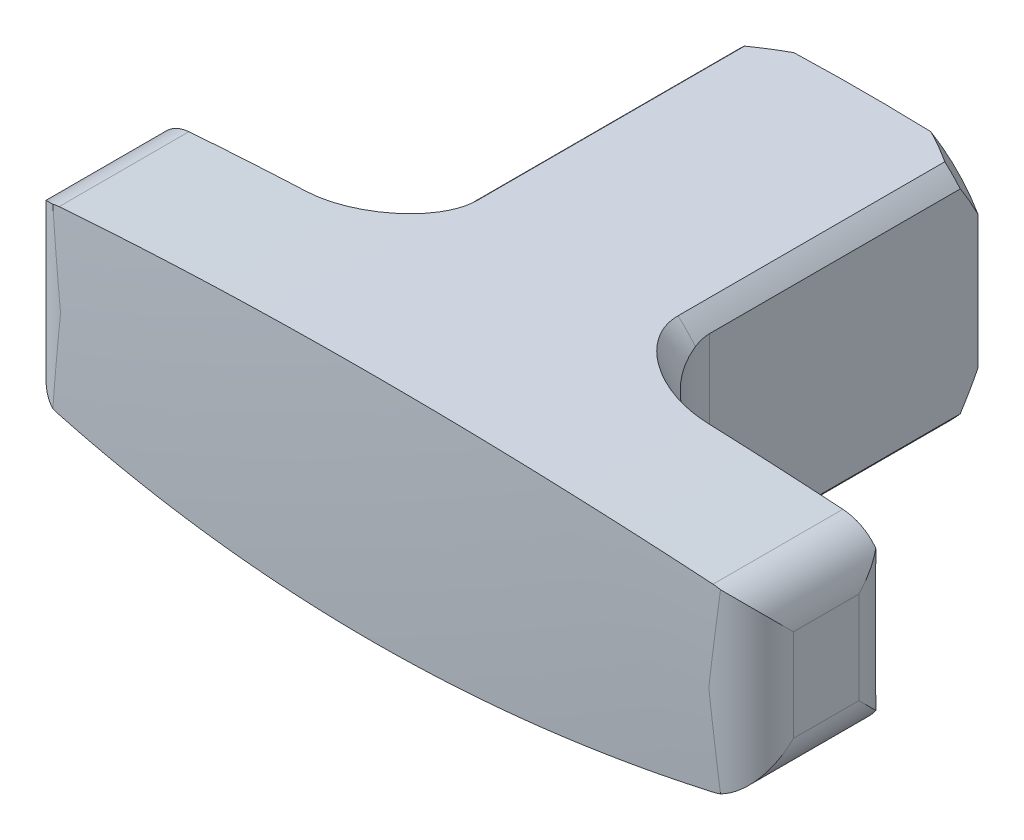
ISO-10303-21;
HEADER;
FILE_DESCRIPTION(('STEP AP214'),'2;1');
FILE_NAME('part.step','',(''),(''),'','','');
FILE_SCHEMA(('AUTOMOTIVE_DESIGN { 1 0 10303 214 1 1 1 1 }'));
ENDSEC;
DATA;
#1=APPLICATION_CONTEXT('core data for automotive mechanical design processes');
#2=APPLICATION_PROTOCOL_DEFINITION('international standard','automotive_design',2000,#1);
#3=PRODUCT_CONTEXT('',#1,'mechanical');
#4=PRODUCT('Part','Part','',(#3));
#5=PRODUCT_RELATED_PRODUCT_CATEGORY('part','',(#4));
#6=PRODUCT_DEFINITION_FORMATION('','',#4);
#7=PRODUCT_DEFINITION_CONTEXT('part definition',#1,'design');
#8=PRODUCT_DEFINITION('design','',#6,#7);
#9=PRODUCT_DEFINITION_SHAPE('','',#8);
#10=(LENGTH_UNIT() NAMED_UNIT(*) SI_UNIT(.MILLI.,.METRE.));
#11=(NAMED_UNIT(*) PLANE_ANGLE_UNIT() SI_UNIT($,.RADIAN.));
#12=(NAMED_UNIT(*) SI_UNIT($,.STERADIAN.) SOLID_ANGLE_UNIT());
#13=UNCERTAINTY_MEASURE_WITH_UNIT(LENGTH_MEASURE(1.E-05),#10,'distance_accuracy_value','');
#14=(GEOMETRIC_REPRESENTATION_CONTEXT(3) GLOBAL_UNCERTAINTY_ASSIGNED_CONTEXT((#13)) GLOBAL_UNIT_ASSIGNED_CONTEXT((#10,
#11,#12)) REPRESENTATION_CONTEXT('',''));
#15=CARTESIAN_POINT('',(0.,0.,0.));
#16=DIRECTION('',(0.,0.,1.));
#17=DIRECTION('',(1.,0.,0.));
#18=AXIS2_PLACEMENT_3D('',#15,#16,#17);
#19=CARTESIAN_POINT('',(8.32667268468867E-13,0.,-179.79999999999));
#20=DIRECTION('',(0.,0.,-1.));
#21=DIRECTION('',(1.,0.,0.));
#22=AXIS2_PLACEMENT_3D('',#19,#20,#21);
#23=SPHERICAL_SURFACE('',#22,200.49999999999);
#24=CARTESIAN_POINT('',(-17.9865474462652,-23.5335878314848,18.5000361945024));
#25=CARTESIAN_POINT('',(-18.0116966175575,-23.5153899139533,18.4999147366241));
#26=CARTESIAN_POINT('',(-18.0352712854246,-23.4953050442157,18.5001527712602));
#27=CARTESIAN_POINT('',(-18.0796896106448,-23.4525506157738,18.5011690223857));
#28=CARTESIAN_POINT('',(-18.1005491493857,-23.4298976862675,18.501943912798));
#29=CARTESIAN_POINT('',(-18.1594928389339,-23.3601907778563,18.5047855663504));
#30=CARTESIAN_POINT('',(-18.1946729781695,-23.3107694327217,18.5073764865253));
#31=CARTESIAN_POINT('',(-18.2762265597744,-23.1833964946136,18.514820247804));
#32=CARTESIAN_POINT('',(-18.3194155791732,-23.1035229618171,18.5201565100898));
#33=CARTESIAN_POINT('',(-18.3989527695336,-22.9404988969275,18.5317179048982));
#34=CARTESIAN_POINT('',(-18.4352904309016,-22.8573435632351,18.5379443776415));
#35=CARTESIAN_POINT('',(-18.5039310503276,-22.6874317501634,18.5510614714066));
#36=CARTESIAN_POINT('',(-18.5361342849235,-22.6006363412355,18.55796321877));
#37=CARTESIAN_POINT('',(-18.5968984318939,-22.4259220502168,18.5721048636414));
#38=CARTESIAN_POINT('',(-18.6254628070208,-22.3380043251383,18.5793444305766));
#39=CARTESIAN_POINT('',(-18.7062140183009,-22.075677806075,18.6011727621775));
#40=CARTESIAN_POINT('',(-18.7544429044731,-21.9000826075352,18.6160794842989));
#41=CARTESIAN_POINT('',(-18.8438372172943,-21.5471150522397,18.6462522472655));
#42=CARTESIAN_POINT('',(-18.8849996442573,-21.3697419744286,18.6615184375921));
#43=CARTESIAN_POINT('',(-18.9621500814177,-21.0136001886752,18.692188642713));
#44=CARTESIAN_POINT('',(-18.9981298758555,-20.8348297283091,18.7075928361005));
#45=CARTESIAN_POINT('',(-19.0660109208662,-20.4765553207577,18.7383625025));
#46=CARTESIAN_POINT('',(-19.097912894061,-20.2970515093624,18.7537279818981));
#47=CARTESIAN_POINT('',(-19.1581227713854,-19.9392650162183,18.7841757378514));
#48=CARTESIAN_POINT('',(-19.1864631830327,-19.760987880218,18.7992593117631));
#49=CARTESIAN_POINT('',(-19.2404533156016,-19.4040053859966,18.8292333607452));
#50=CARTESIAN_POINT('',(-19.26610292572,-19.2253000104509,18.8441238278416));
#51=CARTESIAN_POINT('',(-19.3150864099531,-18.8677241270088,18.8736499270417));
#52=CARTESIAN_POINT('',(-19.3384224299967,-18.6888539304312,18.8882857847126));
#53=CARTESIAN_POINT('',(-19.3831087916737,-18.3308476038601,18.9172812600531));
#54=CARTESIAN_POINT('',(-19.4044591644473,-18.1517114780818,18.9316408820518));
#55=CARTESIAN_POINT('',(-19.4673255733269,-17.6015655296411,18.9752458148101));
#56=CARTESIAN_POINT('',(-19.5059953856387,-17.2301895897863,19.0039912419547));
#57=CARTESIAN_POINT('',(-19.577481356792,-16.486757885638,19.0599992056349));
#58=CARTESIAN_POINT('',(-19.6102972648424,-16.114702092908,19.0872616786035));
#59=CARTESIAN_POINT('',(-19.6711449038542,-15.3700359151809,19.1401878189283));
#60=CARTESIAN_POINT('',(-19.6991759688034,-14.9974254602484,19.1658512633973));
#61=CARTESIAN_POINT('',(-19.7512305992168,-14.251810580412,19.2154895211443));
#62=CARTESIAN_POINT('',(-19.7752541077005,-13.8788061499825,19.2394643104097));
#63=CARTESIAN_POINT('',(-19.8422804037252,-12.7586819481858,19.3087944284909));
#64=CARTESIAN_POINT('',(-19.8801889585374,-12.0110912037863,19.3515097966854));
#65=CARTESIAN_POINT('',(-19.9458183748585,-10.5151536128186,19.4295357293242));
#66=CARTESIAN_POINT('',(-19.9735400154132,-9.76680682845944,19.4648468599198));
#67=CARTESIAN_POINT('',(-20.0210375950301,-8.26723128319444,19.527936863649));
#68=CARTESIAN_POINT('',(-20.0407887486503,-7.51600075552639,19.5556921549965));
#69=CARTESIAN_POINT('',(-20.0737067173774,-6.01313428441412,19.6033701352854));
#70=CARTESIAN_POINT('',(-20.0868733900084,-5.26149833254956,19.6232926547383));
#71=CARTESIAN_POINT('',(-20.1075736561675,-3.75827140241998,19.6551978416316));
#72=CARTESIAN_POINT('',(-20.1151094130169,-3.00668051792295,19.6671835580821));
#73=CARTESIAN_POINT('',(-20.1250999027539,-1.50339190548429,19.6831702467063));
#74=CARTESIAN_POINT('',(-20.1275547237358,-0.751694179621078,19.6871713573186));
#75=CARTESIAN_POINT('',(-20.1275519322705,0.416835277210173,19.6871716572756));
#76=CARTESIAN_POINT('',(-20.1267955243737,0.833669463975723,19.6859414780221));
#77=CARTESIAN_POINT('',(-20.1237484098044,1.66733016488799,19.6810229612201));
#78=CARTESIAN_POINT('',(-20.1214576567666,2.08415667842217,19.6773345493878));
#79=CARTESIAN_POINT('',(-20.1122250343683,3.33408259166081,19.6625942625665));
#80=CARTESIAN_POINT('',(-20.1029228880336,4.16712573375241,19.6478673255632));
#81=CARTESIAN_POINT('',(-20.0772012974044,5.83370047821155,19.6086746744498));
#82=CARTESIAN_POINT('',(-20.0607748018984,6.66723174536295,19.5841993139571));
#83=CARTESIAN_POINT('',(-20.0193141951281,8.33373872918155,19.5256668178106));
#84=CARTESIAN_POINT('',(-19.9942801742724,9.16671445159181,19.4916097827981));
#85=CARTESIAN_POINT('',(-19.9332835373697,10.831757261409,19.4141628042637));
#86=CARTESIAN_POINT('',(-19.8973221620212,11.6638244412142,19.370773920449));
#87=CARTESIAN_POINT('',(-19.8323732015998,12.9109305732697,19.2989921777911));
#88=CARTESIAN_POINT('',(-19.8088900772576,13.3264523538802,19.2739495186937));
#89=CARTESIAN_POINT('',(-19.75756050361,14.1570890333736,19.2217059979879));
#90=CARTESIAN_POINT('',(-19.7297141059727,14.572203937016,19.1945051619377));
#91=CARTESIAN_POINT('',(-19.6687905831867,15.4018000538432,19.1380480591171));
#92=CARTESIAN_POINT('',(-19.635714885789,15.816281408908,19.1087923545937));
#93=CARTESIAN_POINT('',(-19.5631053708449,16.644580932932,19.0483507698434));
#94=CARTESIAN_POINT('',(-19.5235709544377,17.0583990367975,19.0171647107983));
#95=CARTESIAN_POINT('',(-19.4362575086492,17.8855620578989,18.9530194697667));
#96=CARTESIAN_POINT('',(-19.3884685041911,18.2989057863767,18.9200581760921));
#97=CARTESIAN_POINT('',(-19.3085142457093,18.9177247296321,18.8695610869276));
#98=CARTESIAN_POINT('',(-19.280487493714,19.1237782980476,18.8525545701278));
#99=CARTESIAN_POINT('',(-19.2211308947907,19.5353820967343,18.8182531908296));
#100=CARTESIAN_POINT('',(-19.1898011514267,19.7409323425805,18.8009583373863));
#101=CARTESIAN_POINT('',(-19.1230436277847,20.1518457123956,18.7661251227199));
#102=CARTESIAN_POINT('',(-19.0876065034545,20.3572072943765,18.7485862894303));
#103=CARTESIAN_POINT('',(-19.0116088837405,20.7670542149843,18.7134301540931));
#104=CARTESIAN_POINT('',(-18.9710466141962,20.971539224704,18.6958128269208));
#105=CARTESIAN_POINT('',(-18.8832782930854,21.3786056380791,18.6607532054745));
#106=CARTESIAN_POINT('',(-18.8360888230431,21.5811904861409,18.6433105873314));
#107=CARTESIAN_POINT('',(-18.7580588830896,21.8831713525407,18.6175468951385));
#108=CARTESIAN_POINT('',(-18.7308500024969,21.9834874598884,18.6090280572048));
#109=CARTESIAN_POINT('',(-18.6733851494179,22.1832566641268,18.5922092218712));
#110=CARTESIAN_POINT('',(-18.6431296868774,22.28270990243,18.5839091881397));
#111=CARTESIAN_POINT('',(-18.5905549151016,22.4438389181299,18.5706623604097));
#112=CARTESIAN_POINT('',(-18.5694335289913,22.5058962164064,18.5656096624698));
#113=CARTESIAN_POINT('',(-18.5252490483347,22.6293572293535,18.5556948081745));
#114=CARTESIAN_POINT('',(-18.5021854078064,22.6907607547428,18.5508327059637));
#115=CARTESIAN_POINT('',(-18.4535584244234,22.8128185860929,18.5413619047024));
#116=CARTESIAN_POINT('',(-18.4279875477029,22.873469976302,18.5367540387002));
#117=CARTESIAN_POINT('',(-18.3736757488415,22.9933524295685,18.5279307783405));
#118=CARTESIAN_POINT('',(-18.3449367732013,23.0525843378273,18.5237151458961));
#119=CARTESIAN_POINT('',(-18.2828770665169,23.1692015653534,18.5158564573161));
#120=CARTESIAN_POINT('',(-18.2495247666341,23.2265704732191,18.512217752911));
#121=CARTESIAN_POINT('',(-18.176563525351,23.3368577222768,18.5059704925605));
#122=CARTESIAN_POINT('',(-18.1370119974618,23.3898106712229,18.5033531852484));
#123=CARTESIAN_POINT('',(-18.07630404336,23.4556122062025,18.5011146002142));
#124=CARTESIAN_POINT('',(-18.0595719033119,23.472440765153,18.5006478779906));
#125=CARTESIAN_POINT('',(-18.0243983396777,23.5044446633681,18.5000572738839));
#126=CARTESIAN_POINT('',(-18.0059462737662,23.5196082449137,18.4999356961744));
#127=CARTESIAN_POINT('',(-17.9865474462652,23.5335878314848,18.5000361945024));
#128=B_SPLINE_CURVE_WITH_KNOTS('',3,(#24,#25,#26,#27,#28,#29,#30,#31,#32,#33,#34,#35,#36,#37,
#38,#39,#40,#41,#42,#43,#44,#45,#46,#47,#48,#49,#50,#51,#52,#53,#54,#55,#56,#57,#58,#59,#60,#61,
#62,#63,#64,#65,#66,#67,#68,#69,#70,#71,#72,#73,#74,#75,#76,#77,#78,#79,#80,#81,#82,#83,#84,#85,
#86,#87,#88,#89,#90,#91,#92,#93,#94,#95,#96,#97,#98,#99,#100,#101,#102,#103,#104,#105,#106,#107,
#108,#109,#110,#111,#112,#113,#114,#115,#116,#117,#118,#119,#120,#121,#122,#123,#124,#125,#126,
#127),.UNSPECIFIED.,.F.,.F.,(4,2,2,2,2,2,2,2,2,2,2,2,2,2,2,2,2,2,2,2,2,2,2,2,2,2,2,2,2,2,2,2,2,
2,2,2,2,2,2,2,2,2,2,2,2,2,2,2,2,2,2,4),(0.,0.0927834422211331,0.184997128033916,
0.366599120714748,0.638896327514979,0.911607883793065,1.18999579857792,1.46811678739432,
2.01597590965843,2.56406702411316,3.11301765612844,3.66187087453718,4.20528063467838,
4.74871276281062,5.29163602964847,5.83455078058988,6.95794673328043,8.08139080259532,
9.2049911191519,10.3286074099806,12.5777701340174,14.8267608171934,17.0826921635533,
19.3386723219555,21.5937853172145,23.84885921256,25.0993602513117,26.3498990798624,
28.8494847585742,31.3515500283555,33.8535890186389,36.355344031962,37.6061341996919,
38.8569095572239,40.107344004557,41.3578944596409,42.6099668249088,43.2358813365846,
43.8617762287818,44.4891240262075,45.1166895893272,45.7427120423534,46.0555463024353,
46.3683282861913,46.565547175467,46.762821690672,46.96070829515,47.1584739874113,
47.3576669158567,47.5551135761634,47.6262137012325,47.6977873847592),.UNSPECIFIED.);
#129=CARTESIAN_POINT('',(-20.1044827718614,-3.94437824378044,19.6504992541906));
#130=VERTEX_POINT('',#129);
#131=CARTESIAN_POINT('',(-20.1044827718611,3.9443782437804,19.6504992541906));
#132=VERTEX_POINT('',#131);
#133=EDGE_CURVE('E325',#130,#132,#128,.T.);
#134=ORIENTED_EDGE('',*,*,#133,.T.);
#135=CARTESIAN_POINT('',(-20.499999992,2.59467749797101,19.6323635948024));
#136=CARTESIAN_POINT('',(-20.5000124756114,2.6647281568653,19.6314510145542));
#137=CARTESIAN_POINT('',(-20.4970669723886,2.73477940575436,19.630805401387));
#138=CARTESIAN_POINT('',(-20.4853113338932,2.87438757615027,19.6300499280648));
#139=CARTESIAN_POINT('',(-20.4765014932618,2.94394452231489,19.6299400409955));
#140=CARTESIAN_POINT('',(-20.453077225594,3.08202435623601,19.6302576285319));
#141=CARTESIAN_POINT('',(-20.4384671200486,3.15054797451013,19.6306847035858));
#142=CARTESIAN_POINT('',(-20.4035618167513,3.28610548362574,19.6320713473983));
#143=CARTESIAN_POINT('',(-20.3832666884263,3.35313939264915,19.6330309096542));
#144=CARTESIAN_POINT('',(-20.3140202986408,3.55135991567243,19.6367016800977));
#145=CARTESIAN_POINT('',(-20.2566984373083,3.67972157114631,19.6402051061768));
#146=CARTESIAN_POINT('',(-20.1214812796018,3.92489208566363,19.6492187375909));
#147=CARTESIAN_POINT('',(-20.0435916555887,4.04170411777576,19.6547283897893));
#148=CARTESIAN_POINT('',(-19.8693613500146,4.26073441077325,19.6676020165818));
#149=CARTESIAN_POINT('',(-19.7730029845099,4.36293851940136,19.6749677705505));
#150=CARTESIAN_POINT('',(-19.5645718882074,4.5497983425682,19.6913444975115));
#151=CARTESIAN_POINT('',(-19.4524898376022,4.63444357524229,19.7003564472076));
#152=CARTESIAN_POINT('',(-19.2153797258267,4.78407867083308,19.7198025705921));
#153=CARTESIAN_POINT('',(-19.0902996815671,4.84898518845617,19.7302425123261));
#154=CARTESIAN_POINT('',(-18.8312497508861,4.95679060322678,19.7522086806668));
#155=CARTESIAN_POINT('',(-18.6972976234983,4.99973204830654,19.7637327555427));
#156=CARTESIAN_POINT('',(-18.5322608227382,5.03773870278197,19.7781234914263));
#157=CARTESIAN_POINT('',(-18.5034702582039,5.0438337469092,19.7806408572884));
#158=CARTESIAN_POINT('',(-18.4457316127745,5.05499609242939,19.7857030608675));
#159=CARTESIAN_POINT('',(-18.4167837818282,5.06006470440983,19.7882478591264));
#160=CARTESIAN_POINT('',(-18.3877477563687,5.06462478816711,19.790807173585));
#161=B_SPLINE_CURVE_WITH_KNOTS('',3,(#135,#136,#137,#138,#139,#140,#141,#142,#143,#144,#145,
#146,#147,#148,#149,#150,#151,#152,#153,#154,#155,#156,#157,#158,#159,#160),.UNSPECIFIED.,.F.,
.F.,(4,2,2,2,2,2,2,2,2,2,2,2,4),(0.,0.210101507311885,0.420192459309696,0.630127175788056,
0.840059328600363,1.25975461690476,1.67933427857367,2.09931771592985,2.51955114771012,
2.94153510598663,3.36269852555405,3.45129827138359,3.53978416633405),.UNSPECIFIED.);
#162=CARTESIAN_POINT('',(-18.3879477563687,5.06459338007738,19.7907895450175));
#163=VERTEX_POINT('',#162);
#164=EDGE_CURVE('E369',#132,#163,#161,.T.);
#165=ORIENTED_EDGE('',*,*,#164,.T.);
#166=CARTESIAN_POINT('',(-18.3881477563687,5.06456196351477,19.7907719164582));
#167=CARTESIAN_POINT('',(-17.7981880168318,5.15723578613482,19.8427731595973));
#168=CARTESIAN_POINT('',(-17.2073117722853,5.24548204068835,19.8922700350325));
#169=CARTESIAN_POINT('',(-16.0240773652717,5.41305274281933,19.9862280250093));
#170=CARTESIAN_POINT('',(-15.4317196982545,5.49237984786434,20.0306906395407));
#171=CARTESIAN_POINT('',(-14.2455207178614,5.6421010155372,20.1145841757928));
#172=CARTESIAN_POINT('',(-13.6516794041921,5.71249507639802,20.154015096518));
#173=CARTESIAN_POINT('',(-12.4625118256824,5.84433490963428,20.2278453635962));
#174=CARTESIAN_POINT('',(-11.8671851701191,5.90577800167,20.2622432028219));
#175=CARTESIAN_POINT('',(-11.2712926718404,5.96271694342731,20.2941127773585));
#176=B_SPLINE_CURVE_WITH_KNOTS('',3,(#166,#167,#168,#169,#170,#171,#172,#173,#174,#175),
.UNSPECIFIED.,.F.,.F.,(4,2,2,2,4),(0.,1.79833999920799,3.59614275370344,5.39394586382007,
7.19228621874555),.UNSPECIFIED.);
#177=CARTESIAN_POINT('',(-11.2750315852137,5.96235961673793,20.2939127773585));
#178=VERTEX_POINT('',#177);
#179=EDGE_CURVE('E624',#163,#178,#176,.T.);
#180=ORIENTED_EDGE('',*,*,#179,.T.);
#181=CARTESIAN_POINT('',(0.,0.,20.2939127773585));
#182=DIRECTION('',(0.,0.,-1.));
#183=DIRECTION('',(0.,1.,0.));
#184=AXIS2_PLACEMENT_3D('',#181,#182,#183);
#185=CIRCLE('',#184,12.7544529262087);
#186=CARTESIAN_POINT('',(-11.2750315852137,-5.96235961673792,20.2939127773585));
#187=VERTEX_POINT('',#186);
#188=EDGE_CURVE('E522',#187,#178,#185,.T.);
#189=ORIENTED_EDGE('',*,*,#188,.F.);
#190=CARTESIAN_POINT('',(-11.2712926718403,-5.96271694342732,20.2941127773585));
#191=CARTESIAN_POINT('',(-11.867185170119,-5.90577800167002,20.262243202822));
#192=CARTESIAN_POINT('',(-12.4625118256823,-5.8443349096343,20.2278453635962));
#193=CARTESIAN_POINT('',(-13.651679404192,-5.71249507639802,20.154015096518));
#194=CARTESIAN_POINT('',(-14.2455207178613,-5.64210101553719,20.1145841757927));
#195=CARTESIAN_POINT('',(-15.4317196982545,-5.49237984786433,20.0306906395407));
#196=CARTESIAN_POINT('',(-16.0240773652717,-5.41305274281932,19.9862280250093));
#197=CARTESIAN_POINT('',(-17.2073117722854,-5.24548204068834,19.8922700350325));
#198=CARTESIAN_POINT('',(-17.7981880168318,-5.15723578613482,19.8427731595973));
#199=CARTESIAN_POINT('',(-18.3881477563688,-5.06456196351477,19.7907719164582));
#200=B_SPLINE_CURVE_WITH_KNOTS('',3,(#190,#191,#192,#193,#194,#195,#196,#197,#198,#199),
.UNSPECIFIED.,.F.,.F.,(4,2,2,2,4),(0.,1.79834035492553,3.5961434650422,5.3939462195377,
7.19228621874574),.UNSPECIFIED.);
#201=CARTESIAN_POINT('',(-18.3879477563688,-5.06459338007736,19.7907895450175));
#202=VERTEX_POINT('',#201);
#203=EDGE_CURVE('E232',#187,#202,#200,.T.);
#204=ORIENTED_EDGE('',*,*,#203,.T.);
#205=CARTESIAN_POINT('',(-18.3877477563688,-5.0646247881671,19.790807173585));
#206=CARTESIAN_POINT('',(-18.4572668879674,-5.05371703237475,19.7846794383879));
#207=CARTESIAN_POINT('',(-18.5263271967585,-5.0398604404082,19.7786311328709));
#208=CARTESIAN_POINT('',(-18.6630489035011,-5.00637316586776,19.7667352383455));
#209=CARTESIAN_POINT('',(-18.7307103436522,-4.98674265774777,19.7608876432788));
#210=CARTESIAN_POINT('',(-18.8641240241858,-4.9418416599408,19.7494375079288));
#211=CARTESIAN_POINT('',(-18.9298772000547,-4.91657398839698,19.7438348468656));
#212=CARTESIAN_POINT('',(-19.0590214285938,-4.86058574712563,19.7329130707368));
#213=CARTESIAN_POINT('',(-19.1224125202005,-4.82986526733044,19.7275939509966));
#214=CARTESIAN_POINT('',(-19.3084354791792,-4.72977438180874,19.7121135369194));
#215=CARTESIAN_POINT('',(-19.4269577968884,-4.65246077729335,19.7024256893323));
#216=CARTESIAN_POINT('',(-19.6492599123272,-4.47897971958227,19.6846242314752));
#217=CARTESIAN_POINT('',(-19.7530448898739,-4.38281891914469,19.676510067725));
#218=CARTESIAN_POINT('',(-19.9427277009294,-4.17461557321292,19.662101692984));
#219=CARTESIAN_POINT('',(-20.0286774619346,-4.0626207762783,19.6558021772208));
#220=CARTESIAN_POINT('',(-20.1806091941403,-3.82563488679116,19.6451738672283));
#221=CARTESIAN_POINT('',(-20.2465793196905,-3.7006361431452,19.6408462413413));
#222=CARTESIAN_POINT('',(-20.3563981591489,-3.44170647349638,19.6343036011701));
#223=CARTESIAN_POINT('',(-20.4003142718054,-3.30780419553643,19.632082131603));
#224=CARTESIAN_POINT('',(-20.464994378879,-3.0346745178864,19.6297981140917));
#225=CARTESIAN_POINT('',(-20.4858060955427,-2.89545871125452,19.6297311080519));
#226=CARTESIAN_POINT('',(-20.4965512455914,-2.72889181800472,19.6309285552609));
#227=CARTESIAN_POINT('',(-20.4978470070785,-2.70204730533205,19.6311608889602));
#228=CARTESIAN_POINT('',(-20.4995712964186,-2.64836355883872,19.631703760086));
#229=CARTESIAN_POINT('',(-20.5000008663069,-2.62152435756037,19.6320142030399));
#230=CARTESIAN_POINT('',(-20.499999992,-2.594677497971,19.6323635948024));
#231=B_SPLINE_CURVE_WITH_KNOTS('',3,(#205,#206,#207,#208,#209,#210,#211,#212,#213,#214,#215,
#216,#217,#218,#219,#220,#221,#222,#223,#224,#225,#226,#227,#228,#229,#230),.UNSPECIFIED.,.F.,
.F.,(4,2,2,2,2,2,2,2,2,2,2,2,4),(0.,0.21183986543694,0.423673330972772,0.635401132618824,
0.847125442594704,1.27044619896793,1.69361779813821,2.11553948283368,2.53771083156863,
2.95858401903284,3.37858626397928,3.45921080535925,3.53973829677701),.UNSPECIFIED.);
#232=EDGE_CURVE('E361',#202,#130,#231,.T.);
#233=ORIENTED_EDGE('',*,*,#232,.T.);
#234=EDGE_LOOP('',(#134,#165,#180,#189,#204,#233));
#235=FACE_BOUND('',#234,.T.);
#236=ADVANCED_FACE('F14',(#235),#23,.F.);
#237=CARTESIAN_POINT('',(0.,0.,16.3020142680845));
#238=DIRECTION('',(0.,0.,-1.));
#239=DIRECTION('',(0.,1.,0.));
#240=AXIS2_PLACEMENT_3D('',#237,#238,#239);
#241=TOROIDAL_SURFACE('',#240,12.5,4.);
#242=ORIENTED_EDGE('',*,*,#188,.T.);
#243=CARTESIAN_POINT('',(-12.7546529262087,5.81155267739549,20.0034978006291));
#244=CARTESIAN_POINT('',(-12.5937210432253,5.82898143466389,20.0605404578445));
#245=CARTESIAN_POINT('',(-12.4299017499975,5.84637934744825,20.1091684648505));
#246=CARTESIAN_POINT('',(-12.0983814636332,5.88087378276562,20.189952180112));
#247=CARTESIAN_POINT('',(-11.930684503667,5.89797058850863,20.222124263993));
#248=CARTESIAN_POINT('',(-11.594129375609,5.93154351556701,20.2702999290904));
#249=CARTESIAN_POINT('',(-11.4252870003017,5.94802308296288,20.2864126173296));
#250=CARTESIAN_POINT('',(-11.086795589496,5.98032346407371,20.3033806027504));
#251=CARTESIAN_POINT('',(-10.9171464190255,5.99614416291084,20.3042332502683));
#252=CARTESIAN_POINT('',(-10.4456661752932,6.03908273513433,20.2861115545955));
#253=CARTESIAN_POINT('',(-10.1442456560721,6.0653570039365,20.2511059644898));
#254=CARTESIAN_POINT('',(-9.54917347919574,6.11498267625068,20.1374556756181));
#255=CARTESIAN_POINT('',(-9.25553902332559,6.13832797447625,20.0587216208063));
#256=CARTESIAN_POINT('',(-8.64048567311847,6.18501063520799,19.8459329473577));
#257=CARTESIAN_POINT('',(-8.32117226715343,6.20786067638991,19.7055346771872));
#258=CARTESIAN_POINT('',(-7.86310224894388,6.23892209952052,19.4569657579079));
#259=CARTESIAN_POINT('',(-7.71386910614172,6.2487418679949,19.3677602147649));
#260=CARTESIAN_POINT('',(-7.42365110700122,6.26731636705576,19.1766875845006));
#261=CARTESIAN_POINT('',(-7.28266278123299,6.27607154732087,19.074825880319));
#262=CARTESIAN_POINT('',(-7.05459005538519,6.28985247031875,18.8932509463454));
#263=CARTESIAN_POINT('',(-6.96477486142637,6.29517090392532,18.8169767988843));
#264=CARTESIAN_POINT('',(-6.79050920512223,6.30530282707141,18.6585018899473));
#265=CARTESIAN_POINT('',(-6.70605975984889,6.31011622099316,18.576300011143));
#266=CARTESIAN_POINT('',(-6.46225558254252,6.32376671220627,18.3208231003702));
#267=CARTESIAN_POINT('',(-6.31204661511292,6.33183787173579,18.1383662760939));
#268=CARTESIAN_POINT('',(-6.08298902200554,6.34380055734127,17.8021378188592));
#269=CARTESIAN_POINT('',(-5.99584100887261,6.34823185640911,17.6540460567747));
#270=CARTESIAN_POINT('',(-5.846134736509,6.35572182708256,17.3461812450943));
#271=CARTESIAN_POINT('',(-5.78348732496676,6.35878548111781,17.1864531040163));
#272=CARTESIAN_POINT('',(-5.7023842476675,6.36271621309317,16.9057105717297));
#273=CARTESIAN_POINT('',(-5.6763834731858,6.36396254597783,16.7868896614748));
#274=CARTESIAN_POINT('',(-5.65009245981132,6.36521946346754,16.6064658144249));
#275=CARTESIAN_POINT('',(-5.64344646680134,6.36553636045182,16.5457543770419));
#276=CARTESIAN_POINT('',(-5.6345593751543,6.36595967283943,16.423973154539));
#277=CARTESIAN_POINT('',(-5.6323209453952,6.36606596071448,16.3629031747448));
#278=CARTESIAN_POINT('',(-5.63233617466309,6.36606544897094,16.3018142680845));
#279=B_SPLINE_CURVE_WITH_KNOTS('',3,(#243,#244,#245,#246,#247,#248,#249,#250,#251,#252,#253,
#254,#255,#256,#257,#258,#259,#260,#261,#262,#263,#264,#265,#266,#267,#268,#269,#270,#271,#272,
#273,#274,#275,#276,#277,#278),.UNSPECIFIED.,.F.,.F.,(4,2,2,2,2,2,2,2,2,2,2,2,2,2,2,2,2,4),(0.,
0.514524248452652,1.02853548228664,1.53903023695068,2.04961363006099,2.95959691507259,
3.87144656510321,4.91488544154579,5.43680413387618,5.9585015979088,6.31209892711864,
6.66576308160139,7.3715866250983,7.88559272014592,8.39771065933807,8.7614347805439,
8.9445135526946,9.12770314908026),.UNSPECIFIED.);
#280=CARTESIAN_POINT('',(-5.63233616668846,6.36606544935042,16.3020142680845));
#281=VERTEX_POINT('',#280);
#282=EDGE_CURVE('E616',#178,#281,#279,.T.);
#283=ORIENTED_EDGE('',*,*,#282,.T.);
#284=CARTESIAN_POINT('',(0.,0.,16.3020142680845));
#285=DIRECTION('',(0.,0.,-1.));
#286=DIRECTION('',(0.,1.,0.));
#287=AXIS2_PLACEMENT_3D('',#284,#285,#286);
#288=CIRCLE('',#287,8.5);
#289=CARTESIAN_POINT('',(-6.60608584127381,5.3487970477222,16.3020142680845));
#290=VERTEX_POINT('',#289);
#291=EDGE_CURVE('E512',#290,#281,#288,.T.);
#292=ORIENTED_EDGE('',*,*,#291,.F.);
#293=CARTESIAN_POINT('',(-6.60603884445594,-5.34885509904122,16.3018142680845));
#294=CARTESIAN_POINT('',(-6.63234425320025,-5.31628981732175,16.4139105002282));
#295=CARTESIAN_POINT('',(-6.66361167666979,-5.28472554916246,16.525119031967));
#296=CARTESIAN_POINT('',(-6.73571903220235,-5.22251718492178,16.7446447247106));
#297=CARTESIAN_POINT('',(-6.77655826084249,-5.19187302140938,16.8529620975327));
#298=CARTESIAN_POINT('',(-6.86776416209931,-5.1302140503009,17.0663138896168));
#299=CARTESIAN_POINT('',(-6.91819243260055,-5.09919813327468,17.1713216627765));
#300=CARTESIAN_POINT('',(-7.02779427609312,-5.03566007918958,17.376191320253));
#301=CARTESIAN_POINT('',(-7.08696755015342,-5.00313799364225,17.4760533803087));
#302=CARTESIAN_POINT('',(-7.2135168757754,-4.93490683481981,17.6699893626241));
#303=CARTESIAN_POINT('',(-7.28092849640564,-4.89918413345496,17.7640353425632));
#304=CARTESIAN_POINT('',(-7.42259519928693,-4.82293215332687,17.9447827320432));
#305=CARTESIAN_POINT('',(-7.49685105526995,-4.7824023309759,18.0314833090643));
#306=CARTESIAN_POINT('',(-7.65017758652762,-4.69494862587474,18.1960077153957));
#307=CARTESIAN_POINT('',(-7.72921789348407,-4.6480631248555,18.2738800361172));
#308=CARTESIAN_POINT('',(-7.89042962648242,-4.54599208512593,18.4203783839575));
#309=CARTESIAN_POINT('',(-7.97259930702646,-4.49081112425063,18.4890094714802));
#310=CARTESIAN_POINT('',(-8.11468444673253,-4.38747411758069,18.5987481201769));
#311=CARTESIAN_POINT('',(-8.17445722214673,-4.341608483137,18.6422126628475));
#312=CARTESIAN_POINT('',(-8.29331248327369,-4.24458306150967,18.723924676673));
#313=CARTESIAN_POINT('',(-8.35239482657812,-4.19342220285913,18.7621710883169));
#314=CARTESIAN_POINT('',(-8.46884974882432,-4.08579585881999,18.8335074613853));
#315=CARTESIAN_POINT('',(-8.52622185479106,-4.02932892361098,18.866596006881));
#316=CARTESIAN_POINT('',(-8.63832610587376,-3.91136989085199,18.9278401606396));
#317=CARTESIAN_POINT('',(-8.69305903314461,-3.84987929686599,18.9559972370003));
#318=CARTESIAN_POINT('',(-8.79895074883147,-3.72261957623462,19.007658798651));
#319=CARTESIAN_POINT('',(-8.85012547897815,-3.65687247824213,19.0311850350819));
#320=CARTESIAN_POINT('',(-8.94873389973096,-3.52140088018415,19.0742399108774));
#321=CARTESIAN_POINT('',(-8.99616760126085,-3.45167639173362,19.0937685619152));
#322=CARTESIAN_POINT('',(-9.08709744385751,-3.30878297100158,19.1293725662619));
#323=CARTESIAN_POINT('',(-9.13059009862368,-3.23561107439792,19.1454448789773));
#324=CARTESIAN_POINT('',(-9.21353751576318,-3.08643437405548,19.1746368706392));
#325=CARTESIAN_POINT('',(-9.25299106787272,-3.01042873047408,19.187755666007));
#326=CARTESIAN_POINT('',(-9.35418167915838,-2.80196740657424,19.2198629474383));
#327=CARTESIAN_POINT('',(-9.41214084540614,-2.66730636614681,19.2365152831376));
#328=CARTESIAN_POINT('',(-9.51719256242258,-2.39328052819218,19.2646624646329));
#329=CARTESIAN_POINT('',(-9.56427791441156,-2.25391268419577,19.2761538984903));
#330=CARTESIAN_POINT('',(-9.64854626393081,-1.97149556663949,19.2954682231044));
#331=CARTESIAN_POINT('',(-9.68569638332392,-1.82843574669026,19.3032789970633));
#332=CARTESIAN_POINT('',(-9.7506587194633,-1.54008196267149,19.3162231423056));
#333=CARTESIAN_POINT('',(-9.77846811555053,-1.39478733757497,19.3213557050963));
#334=CARTESIAN_POINT('',(-9.83680515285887,-1.03138247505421,19.3317030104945));
#335=CARTESIAN_POINT('',(-9.86202367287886,-0.812375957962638,19.3357329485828));
#336=CARTESIAN_POINT('',(-9.894328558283,-0.372915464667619,19.3408113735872));
#337=CARTESIAN_POINT('',(-9.90140388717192,-0.152460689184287,19.3418580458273));
#338=CARTESIAN_POINT('',(-9.89772961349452,0.28806351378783,19.3413001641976));
#339=CARTESIAN_POINT('',(-9.88699891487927,0.508133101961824,19.3396984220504));
#340=CARTESIAN_POINT('',(-9.84724952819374,0.946490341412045,19.3333357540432));
#341=CARTESIAN_POINT('',(-9.81824311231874,1.16477908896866,19.3285769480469));
#342=CARTESIAN_POINT('',(-9.756285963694,1.51003112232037,19.3172209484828));
#343=CARTESIAN_POINT('',(-9.72968224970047,1.63820196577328,19.3121471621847));
#344=CARTESIAN_POINT('',(-9.66904865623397,1.89265725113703,19.2997626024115));
#345=CARTESIAN_POINT('',(-9.63502065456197,2.01894216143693,19.2924523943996));
#346=CARTESIAN_POINT('',(-9.55905178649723,2.26871659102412,19.2748482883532));
#347=CARTESIAN_POINT('',(-9.51712239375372,2.3922098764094,19.264558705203));
#348=CARTESIAN_POINT('',(-9.42472951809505,2.63556207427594,19.2399627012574));
#349=CARTESIAN_POINT('',(-9.37426853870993,2.75542204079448,19.2256574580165));
#350=CARTESIAN_POINT('',(-9.27848200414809,2.95989638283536,19.1960620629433));
#351=CARTESIAN_POINT('',(-9.23518354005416,3.04563447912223,19.1819754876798));
#352=CARTESIAN_POINT('',(-9.14351367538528,3.2136472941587,19.1501839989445));
#353=CARTESIAN_POINT('',(-9.09514392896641,3.29592313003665,19.1324802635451));
#354=CARTESIAN_POINT('',(-8.99348098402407,3.45610198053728,19.092757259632));
#355=CARTESIAN_POINT('',(-8.94019633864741,3.53401222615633,19.0707454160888));
#356=CARTESIAN_POINT('',(-8.82897915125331,3.68476968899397,19.0216472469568));
#357=CARTESIAN_POINT('',(-8.77104682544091,3.75761714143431,18.9945611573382));
#358=CARTESIAN_POINT('',(-8.6506529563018,3.89814123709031,18.9343623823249));
#359=CARTESIAN_POINT('',(-8.58815369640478,3.96576234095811,18.9011950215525));
#360=CARTESIAN_POINT('',(-8.46019927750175,4.09448135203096,18.8285024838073));
#361=CARTESIAN_POINT('',(-8.39474415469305,4.15557933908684,18.7889773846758));
#362=CARTESIAN_POINT('',(-8.26220214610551,4.27107264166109,18.7032977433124));
#363=CARTESIAN_POINT('',(-8.19511431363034,4.32546395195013,18.6571392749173));
#364=CARTESIAN_POINT('',(-8.0608246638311,4.42771023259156,18.5582372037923));
#365=CARTESIAN_POINT('',(-7.99362284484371,4.47556510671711,18.5054935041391));
#366=CARTESIAN_POINT('',(-7.86838774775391,4.56002110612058,18.4002874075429));
#367=CARTESIAN_POINT('',(-7.81020779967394,4.59728384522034,18.3485253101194));
#368=CARTESIAN_POINT('',(-7.6957105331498,4.66775657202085,18.2403488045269));
#369=CARTESIAN_POINT('',(-7.63939391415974,4.7009650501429,18.1839326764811));
#370=CARTESIAN_POINT('',(-7.52935779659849,4.7639721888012,18.0667790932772));
#371=CARTESIAN_POINT('',(-7.4756395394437,4.79376922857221,18.0060396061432));
#372=CARTESIAN_POINT('',(-7.37142714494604,4.85060992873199,17.8806294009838));
#373=CARTESIAN_POINT('',(-7.3209334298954,4.87765322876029,17.8159581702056));
#374=CARTESIAN_POINT('',(-7.21423333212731,4.93468160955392,17.6701874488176));
#375=CARTESIAN_POINT('',(-7.15881721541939,4.9642206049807,17.588333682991));
#376=CARTESIAN_POINT('',(-7.05393562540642,5.02135197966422,17.4202379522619));
#377=CARTESIAN_POINT('',(-7.0044712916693,5.04894398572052,17.3339951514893));
#378=CARTESIAN_POINT('',(-6.91203456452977,5.10309331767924,17.1578854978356));
#379=CARTESIAN_POINT('',(-6.86905690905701,5.12965146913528,17.0680216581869));
#380=CARTESIAN_POINT('',(-6.78992668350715,5.18257878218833,16.8853206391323));
#381=CARTESIAN_POINT('',(-6.75377156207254,5.20894801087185,16.792484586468));
#382=CARTESIAN_POINT('',(-6.69851774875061,5.25407452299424,16.6332954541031));
#383=CARTESIAN_POINT('',(-6.67758546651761,5.27269152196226,16.5675329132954));
#384=CARTESIAN_POINT('',(-6.63920163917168,5.31037661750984,16.4352236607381));
#385=CARTESIAN_POINT('',(-6.62174575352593,5.32944411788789,16.3686780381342));
#386=CARTESIAN_POINT('',(-6.60603884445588,5.3488550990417,16.3018142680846));
#387=B_SPLINE_CURVE_WITH_KNOTS('',3,(#293,#294,#295,#296,#297,#298,#299,#300,#301,#302,#303,
#304,#305,#306,#307,#308,#309,#310,#311,#312,#313,#314,#315,#316,#317,#318,#319,#320,#321,#322,
#323,#324,#325,#326,#327,#328,#329,#330,#331,#332,#333,#334,#335,#336,#337,#338,#339,#340,#341,
#342,#343,#344,#345,#346,#347,#348,#349,#350,#351,#352,#353,#354,#355,#356,#357,#358,#359,#360,
#361,#362,#363,#364,#365,#366,#367,#368,#369,#370,#371,#372,#373,#374,#375,#376,#377,#378,#379,
#380,#381,#382,#383,#384,#385,#386),.UNSPECIFIED.,.F.,.F.,(4,2,2,2,2,2,2,2,2,2,2,2,2,2,2,2,2,2,
2,2,2,2,2,2,2,2,2,2,2,2,2,2,2,2,2,2,2,2,2,2,2,2,2,2,2,2,4),(0.,0.358848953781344,
0.717671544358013,1.0788821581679,1.44008042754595,1.80289725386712,2.16575514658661,
2.52651201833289,2.8870705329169,3.14771862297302,3.40841955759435,3.66919193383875,
3.92988654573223,4.18932581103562,4.44876431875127,4.70843013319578,4.96817352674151,
5.41008442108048,5.85228703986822,6.29593539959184,6.73971760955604,7.40030131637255,
8.06128676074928,8.72157091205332,9.38141215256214,9.77421510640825,10.1669188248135,
10.5590566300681,10.9510795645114,11.2420892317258,11.5330042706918,11.8234222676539,
12.1138267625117,12.4069831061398,12.7001358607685,12.9934628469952,13.2867941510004,
13.5455343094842,13.8043705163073,14.0633291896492,14.3223217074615,14.6315240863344,
14.9407855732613,15.2497948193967,15.558688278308,15.7730447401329,15.9871318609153),.UNSPECIFIED.);
#388=CARTESIAN_POINT('',(-6.60608584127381,-5.3487970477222,16.3020142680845));
#389=VERTEX_POINT('',#388);
#390=EDGE_CURVE('E488',#389,#290,#387,.T.);
#391=ORIENTED_EDGE('',*,*,#390,.F.);
#392=CARTESIAN_POINT('',(-5.63233616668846,-6.36606544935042,16.3020142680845));
#393=VERTEX_POINT('',#392);
#394=EDGE_CURVE('E515',#393,#389,#288,.T.);
#395=ORIENTED_EDGE('',*,*,#394,.F.);
#396=CARTESIAN_POINT('',(-5.6323361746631,-6.36606544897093,16.3018142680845));
#397=CARTESIAN_POINT('',(-5.63227033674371,-6.36606752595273,16.3897208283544));
#398=CARTESIAN_POINT('',(-5.63694168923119,-6.36584628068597,16.4775922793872));
#399=CARTESIAN_POINT('',(-5.65530020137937,-6.36497108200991,16.6522423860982));
#400=CARTESIAN_POINT('',(-5.66897216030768,-6.36431785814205,16.7390226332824));
#401=CARTESIAN_POINT('',(-5.70463551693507,-6.36260411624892,16.909618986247));
#402=CARTESIAN_POINT('',(-5.72651296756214,-6.36154917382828,16.9934592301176));
#403=CARTESIAN_POINT('',(-5.77789095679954,-6.35905217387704,17.1587795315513));
#404=CARTESIAN_POINT('',(-5.80739428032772,-6.35760997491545,17.2402587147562));
#405=CARTESIAN_POINT('',(-5.87300808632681,-6.35437206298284,17.3998460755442));
#406=CARTESIAN_POINT('',(-5.90907267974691,-6.3525787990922,17.4779732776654));
#407=CARTESIAN_POINT('',(-5.98714427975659,-6.34865492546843,17.6311519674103));
#408=CARTESIAN_POINT('',(-6.02915081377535,-6.34652434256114,17.7062036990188));
#409=CARTESIAN_POINT('',(-6.16335144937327,-6.33963620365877,17.9271461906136));
#410=CARTESIAN_POINT('',(-6.2634842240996,-6.33439397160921,18.0682574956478));
#411=CARTESIAN_POINT('',(-6.4593079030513,-6.3238493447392,18.3117731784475));
#412=CARTESIAN_POINT('',(-6.55225852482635,-6.31874575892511,18.416451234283));
#413=CARTESIAN_POINT('',(-6.74690148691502,-6.3078057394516,18.6173948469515));
#414=CARTESIAN_POINT('',(-6.84859841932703,-6.30196892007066,18.7136559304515));
#415=CARTESIAN_POINT('',(-7.05928890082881,-6.28958312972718,18.8979011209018));
#416=CARTESIAN_POINT('',(-7.16828771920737,-6.28303364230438,18.9858791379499));
#417=CARTESIAN_POINT('',(-7.39235930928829,-6.26924092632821,19.1535615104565));
#418=CARTESIAN_POINT('',(-7.50743116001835,-6.26199780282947,19.2332671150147));
#419=CARTESIAN_POINT('',(-7.86908381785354,-6.23867567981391,19.4656177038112));
#420=CARTESIAN_POINT('',(-8.12437944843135,-6.22144970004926,19.6048368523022));
#421=CARTESIAN_POINT('',(-8.65117034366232,-6.18406850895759,19.8472117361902));
#422=CARTESIAN_POINT('',(-8.92266866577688,-6.16391274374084,19.9503606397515));
#423=CARTESIAN_POINT('',(-9.53880079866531,-6.11592859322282,20.137505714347));
#424=CARTESIAN_POINT('',(-9.88628027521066,-6.08739050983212,20.2121528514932));
#425=CARTESIAN_POINT('',(-10.5883834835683,-6.02650239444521,20.2998212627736));
#426=CARTESIAN_POINT('',(-10.9429964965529,-5.99415777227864,20.3129289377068));
#427=CARTESIAN_POINT('',(-11.5437915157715,-5.93662444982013,20.2785882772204));
#428=CARTESIAN_POINT('',(-11.7910371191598,-5.91214703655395,20.2478963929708));
#429=CARTESIAN_POINT('',(-12.27904071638,-5.86233599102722,20.1520044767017));
#430=CARTESIAN_POINT('',(-12.5197869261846,-5.83700096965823,20.0867456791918));
#431=CARTESIAN_POINT('',(-12.7546529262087,-5.81155267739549,20.0034978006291));
#432=B_SPLINE_CURVE_WITH_KNOTS('',3,(#396,#397,#398,#399,#400,#401,#402,#403,#404,#405,#406,
#407,#408,#409,#410,#411,#412,#413,#414,#415,#416,#417,#418,#419,#420,#421,#422,#423,#424,#425,
#426,#427,#428,#429,#430,#431),.UNSPECIFIED.,.F.,.F.,(4,2,2,2,2,2,2,2,2,2,2,2,2,2,2,2,2,4),(0.,
0.263538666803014,0.526633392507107,0.786202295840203,1.04586612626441,1.30377920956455,
1.56167179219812,2.07928860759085,2.4990301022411,2.91899333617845,3.33926296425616,
3.75946904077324,4.63022372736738,5.50114324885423,6.56558835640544,7.62853854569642,
8.37725177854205,9.12724196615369),.UNSPECIFIED.);
#433=EDGE_CURVE('E295',#393,#187,#432,.T.);
#434=ORIENTED_EDGE('',*,*,#433,.T.);
#435=EDGE_LOOP('',(#242,#283,#292,#391,#395,#434));
#436=FACE_BOUND('',#435,.T.);
#437=ADVANCED_FACE('F437',(#436),#241,.F.);
#438=CARTESIAN_POINT('',(0.,0.,0.));
#439=DIRECTION('',(0.,0.,-1.));
#440=DIRECTION('',(0.,1.,0.));
#441=AXIS2_PLACEMENT_3D('',#438,#439,#440);
#442=CYLINDRICAL_SURFACE('',#441,8.5);
#443=ORIENTED_EDGE('',*,*,#291,.T.);
#444=DIRECTION('',(0.,0.,-1.));
#445=VECTOR('',#444,1.);
#446=CARTESIAN_POINT('',(-5.63233616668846,6.36606544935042,0.));
#447=LINE('',#446,#445);
#448=CARTESIAN_POINT('',(-5.63233616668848,6.36606544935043,1.30000000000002));
#449=VERTEX_POINT('',#448);
#450=EDGE_CURVE('E621',#281,#449,#447,.T.);
#451=ORIENTED_EDGE('',*,*,#450,.T.);
#452=CARTESIAN_POINT('',(0.,0.,1.3));
#453=DIRECTION('',(0.,0.,-1.));
#454=DIRECTION('',(0.,1.,0.));
#455=AXIS2_PLACEMENT_3D('',#452,#453,#454);
#456=CIRCLE('',#455,8.5);
#457=CARTESIAN_POINT('',(-6.5,5.47722557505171,1.3));
#458=VERTEX_POINT('',#457);
#459=EDGE_CURVE('E506',#458,#449,#456,.T.);
#460=ORIENTED_EDGE('',*,*,#459,.F.);
#461=DIRECTION('',(0.,0.,-1.));
#462=VECTOR('',#461,1.);
#463=CARTESIAN_POINT('',(-6.5,5.47722557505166,0.));
#464=LINE('',#463,#462);
#465=CARTESIAN_POINT('',(-6.5,5.47722557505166,15.3869008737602));
#466=VERTEX_POINT('',#465);
#467=EDGE_CURVE('E613',#458,#466,#464,.F.);
#468=ORIENTED_EDGE('',*,*,#467,.T.);
#469=CARTESIAN_POINT('',(-6.60608584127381,5.3487970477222,16.3020142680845));
#470=CARTESIAN_POINT('',(-6.58884789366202,5.37007685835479,16.2287323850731));
#471=CARTESIAN_POINT('',(-6.57354050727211,5.38878207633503,16.154239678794));
#472=CARTESIAN_POINT('',(-6.54716325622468,5.42080313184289,16.004008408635));
#473=CARTESIAN_POINT('',(-6.53606068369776,5.43416061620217,15.9282844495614));
#474=CARTESIAN_POINT('',(-6.51818677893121,5.45558792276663,15.7755799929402));
#475=CARTESIAN_POINT('',(-6.51141564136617,5.46365750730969,15.6985994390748));
#476=CARTESIAN_POINT('',(-6.50229572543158,5.47450119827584,15.543384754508));
#477=CARTESIAN_POINT('',(-6.4999828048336,5.47723236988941,15.4651455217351));
#478=CARTESIAN_POINT('',(-6.5,5.47722557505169,15.3869008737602));
#479=B_SPLINE_CURVE_WITH_KNOTS('',3,(#469,#470,#471,#472,#473,#474,#475,#476,#477,#478),
.UNSPECIFIED.,.F.,.F.,(4,2,2,2,4),(0.,0.234633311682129,0.467402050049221,0.700181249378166,
0.934825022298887),.UNSPECIFIED.);
#480=EDGE_CURVE('E452',#290,#466,#479,.T.);
#481=ORIENTED_EDGE('',*,*,#480,.F.);
#482=EDGE_LOOP('',(#443,#451,#460,#468,#481));
#483=FACE_BOUND('',#482,.T.);
#484=ADVANCED_FACE('F441',(#483),#442,.T.);
#485=CARTESIAN_POINT('',(6.60608584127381,-5.3487970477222,16.3020142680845));
#486=VERTEX_POINT('',#485);
#487=CARTESIAN_POINT('',(5.63233616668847,-6.36606544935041,16.3020142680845));
#488=VERTEX_POINT('',#487);
#489=EDGE_CURVE('E517',#486,#488,#288,.T.);
#490=ORIENTED_EDGE('',*,*,#489,.T.);
#491=DIRECTION('',(0.,0.,-1.));
#492=VECTOR('',#491,1.);
#493=CARTESIAN_POINT('',(5.63233616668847,-6.36606544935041,0.));
#494=LINE('',#493,#492);
#495=CARTESIAN_POINT('',(5.6323361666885,-6.36606544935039,1.3));
#496=VERTEX_POINT('',#495);
#497=EDGE_CURVE('E761',#488,#496,#494,.T.);
#498=ORIENTED_EDGE('',*,*,#497,.T.);
#499=CARTESIAN_POINT('',(6.5,-5.47722557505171,1.3));
#500=VERTEX_POINT('',#499);
#501=EDGE_CURVE('E511',#500,#496,#456,.T.);
#502=ORIENTED_EDGE('',*,*,#501,.F.);
#503=DIRECTION('',(0.,0.,-1.));
#504=VECTOR('',#503,1.);
#505=CARTESIAN_POINT('',(6.5,-5.47722557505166,0.));
#506=LINE('',#505,#504);
#507=CARTESIAN_POINT('',(6.5,-5.47722557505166,15.3869008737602));
#508=VERTEX_POINT('',#507);
#509=EDGE_CURVE('E596',#500,#508,#506,.F.);
#510=ORIENTED_EDGE('',*,*,#509,.T.);
#511=CARTESIAN_POINT('',(6.60608584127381,-5.3487970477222,16.3020142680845));
#512=CARTESIAN_POINT('',(6.58884789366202,-5.37007685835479,16.2287323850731));
#513=CARTESIAN_POINT('',(6.57354050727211,-5.38878207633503,16.154239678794));
#514=CARTESIAN_POINT('',(6.54716325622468,-5.42080313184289,16.004008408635));
#515=CARTESIAN_POINT('',(6.53606068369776,-5.43416061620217,15.9282844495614));
#516=CARTESIAN_POINT('',(6.51818677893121,-5.45558792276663,15.7755799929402));
#517=CARTESIAN_POINT('',(6.51141564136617,-5.46365750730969,15.6985994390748));
#518=CARTESIAN_POINT('',(6.50229572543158,-5.47450119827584,15.543384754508));
#519=CARTESIAN_POINT('',(6.4999828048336,-5.47723236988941,15.4651455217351));
#520=CARTESIAN_POINT('',(6.5,-5.47722557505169,15.3869008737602));
#521=B_SPLINE_CURVE_WITH_KNOTS('',3,(#511,#512,#513,#514,#515,#516,#517,#518,#519,#520),
.UNSPECIFIED.,.F.,.F.,(4,2,2,2,4),(0.,0.234633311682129,0.467402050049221,0.700181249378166,
0.934825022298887),.UNSPECIFIED.);
#522=EDGE_CURVE('E447',#486,#508,#521,.T.);
#523=ORIENTED_EDGE('',*,*,#522,.F.);
#524=EDGE_LOOP('',(#490,#498,#502,#510,#523));
#525=FACE_BOUND('',#524,.T.);
#526=ADVANCED_FACE('F759',(#525),#442,.T.);
#527=CARTESIAN_POINT('',(0.,0.,1.3));
#528=DIRECTION('',(0.,0.,1.));
#529=DIRECTION('',(0.,-1.,0.));
#530=AXIS2_PLACEMENT_3D('',#527,#528,#529);
#531=CONICAL_SURFACE('',#530,8.5,0.785398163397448);
#532=ORIENTED_EDGE('',*,*,#501,.T.);
#533=CARTESIAN_POINT('',(5.63265514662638,-6.36605026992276,1.30020000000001));
#534=CARTESIAN_POINT('',(5.48811065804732,-6.37292841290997,1.2095852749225));
#535=CARTESIAN_POINT('',(5.34264113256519,-6.3795862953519,1.1204058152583));
#536=CARTESIAN_POINT('',(5.04975718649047,-6.39244224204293,0.945518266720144));
#537=CARTESIAN_POINT('',(4.90234426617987,-6.39864063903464,0.859807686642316));
#538=CARTESIAN_POINT('',(4.60524580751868,-6.41056930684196,0.692312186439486));
#539=CARTESIAN_POINT('',(4.45555993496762,-6.416299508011,0.610527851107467));
#540=CARTESIAN_POINT('',(4.15362294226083,-6.42727511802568,0.451536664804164));
#541=CARTESIAN_POINT('',(4.00137002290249,-6.43252016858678,0.374333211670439));
#542=CARTESIAN_POINT('',(3.84778602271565,-6.43751060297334,0.29980000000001));
#543=B_SPLINE_CURVE_WITH_KNOTS('',3,(#533,#534,#535,#536,#537,#538,#539,#540,#541,#542),
.UNSPECIFIED.,.F.,.F.,(4,2,2,2,4),(0.,0.512223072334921,1.02407151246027,1.53599595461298,
2.04829548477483),.UNSPECIFIED.);
#544=CARTESIAN_POINT('',(3.84819823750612,-6.43749720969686,0.3));
#545=VERTEX_POINT('',#544);
#546=EDGE_CURVE('E278',#496,#545,#543,.T.);
#547=ORIENTED_EDGE('',*,*,#546,.T.);
#548=CARTESIAN_POINT('',(0.,0.,0.3));
#549=DIRECTION('',(0.,0.,-1.));
#550=DIRECTION('',(0.,1.,0.));
#551=AXIS2_PLACEMENT_3D('',#548,#549,#550);
#552=CIRCLE('',#551,7.5);
#553=CARTESIAN_POINT('',(6.5,-3.74165738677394,0.3));
#554=VERTEX_POINT('',#553);
#555=EDGE_CURVE('E505',#554,#545,#552,.T.);
#556=ORIENTED_EDGE('',*,*,#555,.F.);
#557=CARTESIAN_POINT('',(6.5,17.5529834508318,11.5178318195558));
#558=CARTESIAN_POINT('',(6.5,17.2798867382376,11.2617355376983));
#559=CARTESIAN_POINT('',(6.5,17.0064356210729,11.0060168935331));
#560=CARTESIAN_POINT('',(6.5,16.4587103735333,10.4954593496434));
#561=CARTESIAN_POINT('',(6.5,16.1844362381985,10.2406204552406));
#562=CARTESIAN_POINT('',(6.5,15.3598714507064,9.4772986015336));
#563=CARTESIAN_POINT('',(6.5,14.808177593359,8.97032911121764));
#564=CARTESIAN_POINT('',(6.5,13.6874204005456,7.95057550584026));
#565=CARTESIAN_POINT('',(6.5,13.1182444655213,7.43791473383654));
#566=CARTESIAN_POINT('',(6.5,12.2591921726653,6.67517995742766));
#567=CARTESIAN_POINT('',(6.5,11.9720357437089,6.42204309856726));
#568=CARTESIAN_POINT('',(6.5,11.3955465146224,5.9182616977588));
#569=CARTESIAN_POINT('',(6.5,11.1062137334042,5.66761713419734));
#570=CARTESIAN_POINT('',(6.5,10.5250346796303,5.16947675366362));
#571=CARTESIAN_POINT('',(6.5,10.2331893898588,4.92197979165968));
#572=CARTESIAN_POINT('',(6.5,9.64629744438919,4.43078840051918));
#573=CARTESIAN_POINT('',(6.5,9.35125070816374,4.18709406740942));
#574=CARTESIAN_POINT('',(6.5,8.7567076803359,3.70411847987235));
#575=CARTESIAN_POINT('',(6.5,8.4572045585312,3.46484561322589));
#576=CARTESIAN_POINT('',(6.5,7.8532967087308,2.99258595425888));
#577=CARTESIAN_POINT('',(6.5,7.54889232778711,2.75959871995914));
#578=CARTESIAN_POINT('',(6.5,6.9365432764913,2.30390152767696));
#579=CARTESIAN_POINT('',(6.5,6.62865194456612,2.08112014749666));
#580=CARTESIAN_POINT('',(6.5,6.00501667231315,1.64647160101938));
#581=CARTESIAN_POINT('',(6.5,5.68927006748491,1.43460821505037));
#582=CARTESIAN_POINT('',(6.5,5.20876526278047,1.12863420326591));
#583=CARTESIAN_POINT('',(6.5,5.04768386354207,1.02874697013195));
#584=CARTESIAN_POINT('',(6.5,4.7227826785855,0.833541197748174));
#585=CARTESIAN_POINT('',(6.5,4.55896312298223,0.738222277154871));
#586=CARTESIAN_POINT('',(6.5,4.2283779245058,0.553092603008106));
#587=CARTESIAN_POINT('',(6.5,4.06161437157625,0.463278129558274));
#588=CARTESIAN_POINT('',(6.5,3.7247454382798,0.290183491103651));
#589=CARTESIAN_POINT('',(6.5,3.55464070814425,0.206902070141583));
#590=CARTESIAN_POINT('',(6.5,3.2825396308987,0.0812895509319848));
#591=CARTESIAN_POINT('',(6.5,3.18173659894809,0.0363697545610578));
#592=CARTESIAN_POINT('',(6.5,2.97886393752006,-0.0505086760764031));
#593=CARTESIAN_POINT('',(6.5,2.8767943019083,-0.0924672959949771));
#594=CARTESIAN_POINT('',(6.5,2.56861009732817,-0.213438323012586));
#595=CARTESIAN_POINT('',(6.5,2.36052628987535,-0.287543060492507));
#596=CARTESIAN_POINT('',(6.5,1.94050037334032,-0.419435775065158));
#597=CARTESIAN_POINT('',(6.5,1.72858705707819,-0.477314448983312));
#598=CARTESIAN_POINT('',(6.5,1.3004865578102,-0.574453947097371));
#599=CARTESIAN_POINT('',(6.5,1.08429986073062,-0.613716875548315));
#600=CARTESIAN_POINT('',(6.5,0.64580912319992,-0.671662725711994));
#601=CARTESIAN_POINT('',(6.5,0.423461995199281,-0.690026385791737));
#602=CARTESIAN_POINT('',(6.5,-0.0219296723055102,-0.703774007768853));
#603=CARTESIAN_POINT('',(6.5,-0.244974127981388,-0.699160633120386));
#604=CARTESIAN_POINT('',(6.5,-0.690112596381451,-0.667252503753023));
#605=CARTESIAN_POINT('',(6.5,-0.912201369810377,-0.639886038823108));
#606=CARTESIAN_POINT('',(6.5,-1.35278890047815,-0.564274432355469));
#607=CARTESIAN_POINT('',(6.5,-1.57128648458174,-0.516022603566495));
#608=CARTESIAN_POINT('',(6.5,-2.07174706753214,-0.383335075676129));
#609=CARTESIAN_POINT('',(6.5,-2.35194084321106,-0.292283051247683));
#610=CARTESIAN_POINT('',(6.5,-2.90311684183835,-0.0857473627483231));
#611=CARTESIAN_POINT('',(6.5,-3.17409421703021,0.0297489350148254));
#612=CARTESIAN_POINT('',(6.5,-3.57551511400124,0.217557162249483));
#613=CARTESIAN_POINT('',(6.5,-3.70924232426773,0.283010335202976));
#614=CARTESIAN_POINT('',(6.5,-3.97460818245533,0.418034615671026));
#615=CARTESIAN_POINT('',(6.5,-4.10624680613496,0.487605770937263));
#616=CARTESIAN_POINT('',(6.5,-4.36752518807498,0.630281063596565));
#617=CARTESIAN_POINT('',(6.5,-4.49716565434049,0.703383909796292));
#618=CARTESIAN_POINT('',(6.5,-4.75464155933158,0.852678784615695));
#619=CARTESIAN_POINT('',(6.5,-4.88247708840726,0.928870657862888));
#620=CARTESIAN_POINT('',(6.5,-5.31855100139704,1.19505016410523));
#621=CARTESIAN_POINT('',(6.5,-5.62277157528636,1.39163318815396));
#622=CARTESIAN_POINT('',(6.5,-6.22351553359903,1.79627510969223));
#623=CARTESIAN_POINT('',(6.5,-6.52003661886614,2.0043373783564));
#624=CARTESIAN_POINT('',(6.5,-7.10719220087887,2.42917969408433));
#625=CARTESIAN_POINT('',(6.5,-7.39782055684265,2.64596819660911));
#626=CARTESIAN_POINT('',(6.5,-7.97408834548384,3.08598608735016));
#627=CARTESIAN_POINT('',(6.5,-8.25972831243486,3.30921477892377));
#628=CARTESIAN_POINT('',(6.5,-8.82820784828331,3.76163899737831));
#629=CARTESIAN_POINT('',(6.5,-9.1110304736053,3.9908557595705));
#630=CARTESIAN_POINT('',(6.5,-9.67339557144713,4.45328269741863));
#631=CARTESIAN_POINT('',(6.5,-9.95293796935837,4.68649296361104));
#632=CARTESIAN_POINT('',(6.5,-10.5091619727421,5.15598079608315));
#633=CARTESIAN_POINT('',(6.5,-10.7858450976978,5.39225656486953));
#634=CARTESIAN_POINT('',(6.5,-11.3369653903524,5.8674149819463));
#635=CARTESIAN_POINT('',(6.5,-11.611402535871,6.10629765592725));
#636=CARTESIAN_POINT('',(6.5,-12.3675535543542,6.76970074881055));
#637=CARTESIAN_POINT('',(6.5,-12.8472834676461,7.19648199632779));
#638=CARTESIAN_POINT('',(6.5,-13.8024460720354,8.05496121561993));
#639=CARTESIAN_POINT('',(6.5,-14.277878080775,8.48665994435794));
#640=CARTESIAN_POINT('',(6.5,-15.221414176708,9.35009300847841));
#641=CARTESIAN_POINT('',(6.5,-15.6895462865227,9.78179674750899));
#642=CARTESIAN_POINT('',(6.5,-16.3897521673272,10.4314046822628));
#643=CARTESIAN_POINT('',(6.5,-16.6227994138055,10.6482614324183));
#644=CARTESIAN_POINT('',(6.5,-17.0883114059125,11.0825978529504));
#645=CARTESIAN_POINT('',(6.5,-17.3207761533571,11.3000775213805));
#646=CARTESIAN_POINT('',(6.5,-17.5529834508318,11.5178318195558));
#647=B_SPLINE_CURVE_WITH_KNOTS('',3,(#557,#558,#559,#560,#561,#562,#563,#564,#565,#566,#567,
#568,#569,#570,#571,#572,#573,#574,#575,#576,#577,#578,#579,#580,#581,#582,#583,#584,#585,#586,
#587,#588,#589,#590,#591,#592,#593,#594,#595,#596,#597,#598,#599,#600,#601,#602,#603,#604,#605,
#606,#607,#608,#609,#610,#611,#612,#613,#614,#615,#616,#617,#618,#619,#620,#621,#622,#623,#624,
#625,#626,#627,#628,#629,#630,#631,#632,#633,#634,#635,#636,#637,#638,#639,#640,#641,#642,#643,
#644,#645,#646),.UNSPECIFIED.,.F.,.F.,(4,2,2,2,2,2,2,2,2,2,2,2,2,2,2,2,2,2,2,2,2,2,2,2,2,2,2,2,
2,2,2,2,2,2,2,2,2,2,2,2,2,2,2,2,4),(0.,1.12316673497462,2.24634025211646,4.4940833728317,
6.79207119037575,7.94046502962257,9.08884890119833,10.2368023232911,11.3847846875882,
12.5347582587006,13.6846507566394,14.8246047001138,15.9649507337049,16.5335061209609,
17.1020139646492,17.670133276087,18.2381430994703,18.5691760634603,18.9002106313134,
19.5622998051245,20.220610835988,20.8788474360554,21.5470098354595,22.2150947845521,
22.8852933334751,23.5557066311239,24.4380244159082,25.3207993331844,25.7674015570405,
26.2140089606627,26.6604543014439,27.1068772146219,28.1930871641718,29.2796178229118,
30.3672279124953,31.4547207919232,32.546811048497,33.6389260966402,34.7304273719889,
35.8219394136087,37.7481663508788,39.6746939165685,41.5850819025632,42.5400893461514,
43.4950938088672),.UNSPECIFIED.);
#648=EDGE_CURVE('E585',#554,#500,#647,.T.);
#649=ORIENTED_EDGE('',*,*,#648,.T.);
#650=EDGE_LOOP('',(#532,#547,#556,#649));
#651=FACE_BOUND('',#650,.T.);
#652=ADVANCED_FACE('F570',(#651),#531,.T.);
#653=ORIENTED_EDGE('',*,*,#459,.T.);
#654=CARTESIAN_POINT('',(-5.63265514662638,6.36605026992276,1.30020000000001));
#655=CARTESIAN_POINT('',(-5.48811065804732,6.37292841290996,1.2095852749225));
#656=CARTESIAN_POINT('',(-5.34264113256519,6.3795862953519,1.12040581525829));
#657=CARTESIAN_POINT('',(-5.04975718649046,6.39244224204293,0.945518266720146));
#658=CARTESIAN_POINT('',(-4.90234426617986,6.39864063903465,0.859807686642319));
#659=CARTESIAN_POINT('',(-4.60524580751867,6.41056930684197,0.692312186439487));
#660=CARTESIAN_POINT('',(-4.45555993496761,6.41629950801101,0.610527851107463));
#661=CARTESIAN_POINT('',(-4.15362294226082,6.42727511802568,0.451536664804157));
#662=CARTESIAN_POINT('',(-4.00137002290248,6.43252016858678,0.374333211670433));
#663=CARTESIAN_POINT('',(-3.84778602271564,6.43751060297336,0.299800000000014));
#664=B_SPLINE_CURVE_WITH_KNOTS('',3,(#654,#655,#656,#657,#658,#659,#660,#661,#662,#663),
.UNSPECIFIED.,.F.,.F.,(4,2,2,2,4),(0.,0.512223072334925,1.02407151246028,1.53599595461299,
2.04829548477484),.UNSPECIFIED.);
#665=CARTESIAN_POINT('',(-3.8481982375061,6.43749720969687,0.3));
#666=VERTEX_POINT('',#665);
#667=EDGE_CURVE('E235',#449,#666,#664,.T.);
#668=ORIENTED_EDGE('',*,*,#667,.T.);
#669=CARTESIAN_POINT('',(-6.5,3.74165738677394,0.3));
#670=VERTEX_POINT('',#669);
#671=EDGE_CURVE('E501',#670,#666,#552,.T.);
#672=ORIENTED_EDGE('',*,*,#671,.F.);
#673=CARTESIAN_POINT('',(-6.5,-17.5529834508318,11.5178318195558));
#674=CARTESIAN_POINT('',(-6.5,-17.2798867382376,11.2617355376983));
#675=CARTESIAN_POINT('',(-6.5,-17.0064356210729,11.0060168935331));
#676=CARTESIAN_POINT('',(-6.5,-16.4587103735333,10.4954593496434));
#677=CARTESIAN_POINT('',(-6.5,-16.1844362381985,10.2406204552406));
#678=CARTESIAN_POINT('',(-6.5,-15.3598714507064,9.4772986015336));
#679=CARTESIAN_POINT('',(-6.5,-14.808177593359,8.97032911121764));
#680=CARTESIAN_POINT('',(-6.5,-13.6874204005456,7.95057550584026));
#681=CARTESIAN_POINT('',(-6.5,-13.1182444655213,7.43791473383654));
#682=CARTESIAN_POINT('',(-6.5,-12.2591921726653,6.67517995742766));
#683=CARTESIAN_POINT('',(-6.5,-11.9720357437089,6.42204309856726));
#684=CARTESIAN_POINT('',(-6.5,-11.3955465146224,5.9182616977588));
#685=CARTESIAN_POINT('',(-6.5,-11.1062137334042,5.66761713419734));
#686=CARTESIAN_POINT('',(-6.5,-10.5250346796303,5.16947675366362));
#687=CARTESIAN_POINT('',(-6.5,-10.2331893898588,4.92197979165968));
#688=CARTESIAN_POINT('',(-6.5,-9.64629744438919,4.43078840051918));
#689=CARTESIAN_POINT('',(-6.5,-9.35125070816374,4.18709406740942));
#690=CARTESIAN_POINT('',(-6.5,-8.7567076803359,3.70411847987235));
#691=CARTESIAN_POINT('',(-6.5,-8.4572045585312,3.46484561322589));
#692=CARTESIAN_POINT('',(-6.5,-7.8532967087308,2.99258595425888));
#693=CARTESIAN_POINT('',(-6.5,-7.54889232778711,2.75959871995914));
#694=CARTESIAN_POINT('',(-6.5,-6.9365432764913,2.30390152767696));
#695=CARTESIAN_POINT('',(-6.5,-6.62865194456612,2.08112014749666));
#696=CARTESIAN_POINT('',(-6.5,-6.00501667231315,1.64647160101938));
#697=CARTESIAN_POINT('',(-6.5,-5.68927006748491,1.43460821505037));
#698=CARTESIAN_POINT('',(-6.5,-5.20876526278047,1.12863420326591));
#699=CARTESIAN_POINT('',(-6.5,-5.04768386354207,1.02874697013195));
#700=CARTESIAN_POINT('',(-6.5,-4.7227826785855,0.833541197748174));
#701=CARTESIAN_POINT('',(-6.5,-4.55896312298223,0.738222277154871));
#702=CARTESIAN_POINT('',(-6.5,-4.2283779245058,0.553092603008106));
#703=CARTESIAN_POINT('',(-6.5,-4.06161437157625,0.463278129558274));
#704=CARTESIAN_POINT('',(-6.5,-3.7247454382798,0.290183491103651));
#705=CARTESIAN_POINT('',(-6.5,-3.55464070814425,0.206902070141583));
#706=CARTESIAN_POINT('',(-6.5,-3.2825396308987,0.0812895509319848));
#707=CARTESIAN_POINT('',(-6.5,-3.18173659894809,0.0363697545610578));
#708=CARTESIAN_POINT('',(-6.5,-2.97886393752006,-0.0505086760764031));
#709=CARTESIAN_POINT('',(-6.5,-2.8767943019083,-0.0924672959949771));
#710=CARTESIAN_POINT('',(-6.5,-2.56861009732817,-0.213438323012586));
#711=CARTESIAN_POINT('',(-6.5,-2.36052628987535,-0.287543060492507));
#712=CARTESIAN_POINT('',(-6.5,-1.94050037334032,-0.419435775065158));
#713=CARTESIAN_POINT('',(-6.5,-1.72858705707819,-0.477314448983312));
#714=CARTESIAN_POINT('',(-6.5,-1.3004865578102,-0.574453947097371));
#715=CARTESIAN_POINT('',(-6.5,-1.08429986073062,-0.613716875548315));
#716=CARTESIAN_POINT('',(-6.5,-0.64580912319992,-0.671662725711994));
#717=CARTESIAN_POINT('',(-6.5,-0.423461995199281,-0.690026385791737));
#718=CARTESIAN_POINT('',(-6.5,0.0219296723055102,-0.703774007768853));
#719=CARTESIAN_POINT('',(-6.5,0.244974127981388,-0.699160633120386));
#720=CARTESIAN_POINT('',(-6.5,0.690112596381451,-0.667252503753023));
#721=CARTESIAN_POINT('',(-6.5,0.912201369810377,-0.639886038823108));
#722=CARTESIAN_POINT('',(-6.5,1.35278890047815,-0.564274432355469));
#723=CARTESIAN_POINT('',(-6.5,1.57128648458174,-0.516022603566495));
#724=CARTESIAN_POINT('',(-6.5,2.07174706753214,-0.383335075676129));
#725=CARTESIAN_POINT('',(-6.5,2.35194084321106,-0.292283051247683));
#726=CARTESIAN_POINT('',(-6.5,2.90311684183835,-0.0857473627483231));
#727=CARTESIAN_POINT('',(-6.5,3.17409421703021,0.0297489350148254));
#728=CARTESIAN_POINT('',(-6.5,3.57551511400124,0.217557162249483));
#729=CARTESIAN_POINT('',(-6.5,3.70924232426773,0.283010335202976));
#730=CARTESIAN_POINT('',(-6.5,3.97460818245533,0.418034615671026));
#731=CARTESIAN_POINT('',(-6.5,4.10624680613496,0.487605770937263));
#732=CARTESIAN_POINT('',(-6.5,4.36752518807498,0.630281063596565));
#733=CARTESIAN_POINT('',(-6.5,4.49716565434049,0.703383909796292));
#734=CARTESIAN_POINT('',(-6.5,4.75464155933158,0.852678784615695));
#735=CARTESIAN_POINT('',(-6.5,4.88247708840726,0.928870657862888));
#736=CARTESIAN_POINT('',(-6.5,5.31855100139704,1.19505016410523));
#737=CARTESIAN_POINT('',(-6.5,5.62277157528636,1.39163318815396));
#738=CARTESIAN_POINT('',(-6.5,6.22351553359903,1.79627510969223));
#739=CARTESIAN_POINT('',(-6.5,6.52003661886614,2.0043373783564));
#740=CARTESIAN_POINT('',(-6.5,7.10719220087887,2.42917969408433));
#741=CARTESIAN_POINT('',(-6.5,7.39782055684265,2.64596819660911));
#742=CARTESIAN_POINT('',(-6.5,7.97408834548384,3.08598608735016));
#743=CARTESIAN_POINT('',(-6.5,8.25972831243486,3.30921477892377));
#744=CARTESIAN_POINT('',(-6.5,8.82820784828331,3.76163899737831));
#745=CARTESIAN_POINT('',(-6.5,9.1110304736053,3.9908557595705));
#746=CARTESIAN_POINT('',(-6.5,9.67339557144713,4.45328269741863));
#747=CARTESIAN_POINT('',(-6.5,9.95293796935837,4.68649296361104));
#748=CARTESIAN_POINT('',(-6.5,10.5091619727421,5.15598079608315));
#749=CARTESIAN_POINT('',(-6.5,10.7858450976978,5.39225656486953));
#750=CARTESIAN_POINT('',(-6.5,11.3369653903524,5.8674149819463));
#751=CARTESIAN_POINT('',(-6.5,11.611402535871,6.10629765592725));
#752=CARTESIAN_POINT('',(-6.5,12.3675535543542,6.76970074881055));
#753=CARTESIAN_POINT('',(-6.5,12.8472834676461,7.19648199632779));
#754=CARTESIAN_POINT('',(-6.5,13.8024460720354,8.05496121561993));
#755=CARTESIAN_POINT('',(-6.5,14.277878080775,8.48665994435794));
#756=CARTESIAN_POINT('',(-6.5,15.221414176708,9.35009300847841));
#757=CARTESIAN_POINT('',(-6.5,15.6895462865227,9.78179674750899));
#758=CARTESIAN_POINT('',(-6.5,16.3897521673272,10.4314046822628));
#759=CARTESIAN_POINT('',(-6.5,16.6227994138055,10.6482614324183));
#760=CARTESIAN_POINT('',(-6.5,17.0883114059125,11.0825978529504));
#761=CARTESIAN_POINT('',(-6.5,17.3207761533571,11.3000775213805));
#762=CARTESIAN_POINT('',(-6.5,17.5529834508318,11.5178318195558));
#763=B_SPLINE_CURVE_WITH_KNOTS('',3,(#673,#674,#675,#676,#677,#678,#679,#680,#681,#682,#683,
#684,#685,#686,#687,#688,#689,#690,#691,#692,#693,#694,#695,#696,#697,#698,#699,#700,#701,#702,
#703,#704,#705,#706,#707,#708,#709,#710,#711,#712,#713,#714,#715,#716,#717,#718,#719,#720,#721,
#722,#723,#724,#725,#726,#727,#728,#729,#730,#731,#732,#733,#734,#735,#736,#737,#738,#739,#740,
#741,#742,#743,#744,#745,#746,#747,#748,#749,#750,#751,#752,#753,#754,#755,#756,#757,#758,#759,
#760,#761,#762),.UNSPECIFIED.,.F.,.F.,(4,2,2,2,2,2,2,2,2,2,2,2,2,2,2,2,2,2,2,2,2,2,2,2,2,2,2,2,
2,2,2,2,2,2,2,2,2,2,2,2,2,2,2,2,4),(0.,1.12316673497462,2.24634025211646,4.4940833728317,
6.79207119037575,7.94046502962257,9.08884890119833,10.2368023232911,11.3847846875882,
12.5347582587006,13.6846507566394,14.8246047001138,15.9649507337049,16.5335061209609,
17.1020139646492,17.670133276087,18.2381430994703,18.5691760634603,18.9002106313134,
19.5622998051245,20.220610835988,20.8788474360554,21.5470098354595,22.2150947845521,
22.8852933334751,23.5557066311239,24.4380244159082,25.3207993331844,25.7674015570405,
26.2140089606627,26.6604543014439,27.1068772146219,28.1930871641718,29.2796178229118,
30.3672279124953,31.4547207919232,32.546811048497,33.6389260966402,34.7304273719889,
35.8219394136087,37.7481663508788,39.6746939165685,41.5850819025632,42.5400893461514,
43.4950938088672),.UNSPECIFIED.);
#764=EDGE_CURVE('E575',#670,#458,#763,.T.);
#765=ORIENTED_EDGE('',*,*,#764,.T.);
#766=EDGE_LOOP('',(#653,#668,#672,#765));
#767=FACE_BOUND('',#766,.T.);
#768=ADVANCED_FACE('F565',(#767),#531,.T.);
#769=CARTESIAN_POINT('',(7.5,0.,0.3));
#770=DIRECTION('',(0.,0.,1.));
#771=DIRECTION('',(0.,-1.,0.));
#772=AXIS2_PLACEMENT_3D('',#769,#770,#771);
#773=PLANE('',#772);
#774=CARTESIAN_POINT('',(0.,0.,0.3));
#775=DIRECTION('',(0.,0.,-1.));
#776=DIRECTION('',(0.,1.,0.));
#777=AXIS2_PLACEMENT_3D('',#774,#775,#776);
#778=CIRCLE('',#777,4.);
#779=CARTESIAN_POINT('',(0.,4.,0.3));
#780=VERTEX_POINT('',#779);
#781=EDGE_CURVE('E497',#780,#780,#778,.T.);
#782=ORIENTED_EDGE('',*,*,#781,.F.);
#783=EDGE_LOOP('',(#782));
#784=FACE_BOUND('',#783,.T.);
#785=ORIENTED_EDGE('',*,*,#671,.T.);
#786=CARTESIAN_POINT('',(0.,-111.995,0.299999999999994));
#787=DIRECTION('',(0.,0.,1.));
#788=DIRECTION('',(0.,-1.,0.));
#789=AXIS2_PLACEMENT_3D('',#786,#787,#788);
#790=CIRCLE('',#789,118.495);
#791=CARTESIAN_POINT('',(3.84819823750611,6.43749720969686,0.3));
#792=VERTEX_POINT('',#791);
#793=EDGE_CURVE('E9',#666,#792,#790,.F.);
#794=ORIENTED_EDGE('',*,*,#793,.T.);
#795=CARTESIAN_POINT('',(6.5,3.74165738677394,0.3));
#796=VERTEX_POINT('',#795);
#797=EDGE_CURVE('E500',#792,#796,#552,.T.);
#798=ORIENTED_EDGE('',*,*,#797,.T.);
#799=DIRECTION('',(0.,-1.,0.));
#800=VECTOR('',#799,1.);
#801=CARTESIAN_POINT('',(6.5,0.,0.3));
#802=LINE('',#801,#800);
#803=EDGE_CURVE('E525',#796,#554,#802,.T.);
#804=ORIENTED_EDGE('',*,*,#803,.T.);
#805=ORIENTED_EDGE('',*,*,#555,.T.);
#806=CARTESIAN_POINT('',(0.,111.995,0.299999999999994));
#807=DIRECTION('',(0.,0.,1.));
#808=DIRECTION('',(0.,-1.,0.));
#809=AXIS2_PLACEMENT_3D('',#806,#807,#808);
#810=CIRCLE('',#809,118.495);
#811=CARTESIAN_POINT('',(-3.84819823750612,-6.43749720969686,0.3));
#812=VERTEX_POINT('',#811);
#813=EDGE_CURVE('E23',#545,#812,#810,.F.);
#814=ORIENTED_EDGE('',*,*,#813,.T.);
#815=CARTESIAN_POINT('',(-6.5,-3.74165738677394,0.3));
#816=VERTEX_POINT('',#815);
#817=EDGE_CURVE('E504',#812,#816,#552,.T.);
#818=ORIENTED_EDGE('',*,*,#817,.T.);
#819=DIRECTION('',(0.,1.,0.));
#820=VECTOR('',#819,1.);
#821=CARTESIAN_POINT('',(-6.5,0.,0.3));
#822=LINE('',#821,#820);
#823=EDGE_CURVE('E521',#816,#670,#822,.T.);
#824=ORIENTED_EDGE('',*,*,#823,.T.);
#825=EDGE_LOOP('',(#785,#794,#798,#804,#805,#814,#818,#824));
#826=FACE_BOUND('',#825,.T.);
#827=ADVANCED_FACE('F553',(#784,#826),#773,.F.);
#828=CARTESIAN_POINT('',(-20.5,-41.,24.6801207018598));
#829=DIRECTION('',(1.,0.,0.));
#830=DIRECTION('',(0.,1.,0.));
#831=AXIS2_PLACEMENT_3D('',#828,#829,#830);
#832=PLANE('',#831);
#833=DIRECTION('',(0.,0.,-1.));
#834=VECTOR('',#833,1.);
#835=CARTESIAN_POINT('',(-20.5,2.59487749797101,41.));
#836=LINE('',#835,#834);
#837=CARTESIAN_POINT('',(-20.5,2.59487749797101,24.6801207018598));
#838=VERTEX_POINT('',#837);
#839=CARTESIAN_POINT('',(-20.5,2.59487749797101,21.));
#840=VERTEX_POINT('',#839);
#841=EDGE_CURVE('E666',#838,#840,#836,.T.);
#842=ORIENTED_EDGE('',*,*,#841,.T.);
#843=DIRECTION('',(0.,1.,0.));
#844=VECTOR('',#843,1.);
#845=CARTESIAN_POINT('',(-20.5,-41.,21.));
#846=LINE('',#845,#844);
#847=CARTESIAN_POINT('',(-20.5,-2.594877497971,21.));
#848=VERTEX_POINT('',#847);
#849=EDGE_CURVE('E647',#848,#840,#846,.T.);
#850=ORIENTED_EDGE('',*,*,#849,.F.);
#851=DIRECTION('',(0.,0.,-1.));
#852=VECTOR('',#851,1.);
#853=CARTESIAN_POINT('',(-20.5,-2.594877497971,41.));
#854=LINE('',#853,#852);
#855=CARTESIAN_POINT('',(-20.5,-2.594877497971,24.6801207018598));
#856=VERTEX_POINT('',#855);
#857=EDGE_CURVE('E664',#856,#848,#854,.T.);
#858=ORIENTED_EDGE('',*,*,#857,.F.);
#859=DIRECTION('',(0.,1.,0.));
#860=VECTOR('',#859,1.);
#861=CARTESIAN_POINT('',(-20.5,-41.,24.6801207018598));
#862=LINE('',#861,#860);
#863=EDGE_CURVE('E643',#856,#838,#862,.T.);
#864=ORIENTED_EDGE('',*,*,#863,.T.);
#865=EDGE_LOOP('',(#842,#850,#858,#864));
#866=FACE_BOUND('',#865,.T.);
#867=ADVANCED_FACE('F550',(#866),#832,.F.);
#868=CARTESIAN_POINT('',(20.5,-41.,21.));
#869=DIRECTION('',(-1.,0.,0.));
#870=DIRECTION('',(0.,-1.,0.));
#871=AXIS2_PLACEMENT_3D('',#868,#869,#870);
#872=PLANE('',#871);
#873=DIRECTION('',(0.,1.,0.));
#874=VECTOR('',#873,1.);
#875=CARTESIAN_POINT('',(20.5,-41.,21.));
#876=LINE('',#875,#874);
#877=CARTESIAN_POINT('',(20.5,-2.59487749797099,21.));
#878=VERTEX_POINT('',#877);
#879=CARTESIAN_POINT('',(20.5,2.59487749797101,21.));
#880=VERTEX_POINT('',#879);
#881=EDGE_CURVE('E656',#878,#880,#876,.T.);
#882=ORIENTED_EDGE('',*,*,#881,.T.);
#883=DIRECTION('',(0.,0.,-1.));
#884=VECTOR('',#883,1.);
#885=CARTESIAN_POINT('',(20.5,2.59487749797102,41.));
#886=LINE('',#885,#884);
#887=CARTESIAN_POINT('',(20.5,2.59487749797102,24.6801207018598));
#888=VERTEX_POINT('',#887);
#889=EDGE_CURVE('E690',#880,#888,#886,.F.);
#890=ORIENTED_EDGE('',*,*,#889,.T.);
#891=DIRECTION('',(0.,1.,0.));
#892=VECTOR('',#891,1.);
#893=CARTESIAN_POINT('',(20.5,-41.,24.6801207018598));
#894=LINE('',#893,#892);
#895=CARTESIAN_POINT('',(20.5,-2.59487749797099,24.6801207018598));
#896=VERTEX_POINT('',#895);
#897=EDGE_CURVE('E653',#896,#888,#894,.T.);
#898=ORIENTED_EDGE('',*,*,#897,.F.);
#899=DIRECTION('',(0.,0.,-1.));
#900=VECTOR('',#899,1.);
#901=CARTESIAN_POINT('',(20.5,-2.59487749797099,41.));
#902=LINE('',#901,#900);
#903=EDGE_CURVE('E688',#878,#896,#902,.F.);
#904=ORIENTED_EDGE('',*,*,#903,.F.);
#905=EDGE_LOOP('',(#882,#890,#898,#904));
#906=FACE_BOUND('',#905,.T.);
#907=ADVANCED_FACE('F308',(#906),#872,.F.);
#908=CARTESIAN_POINT('',(11.2750315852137,5.96235961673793,20.2939127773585));
#909=VERTEX_POINT('',#908);
#910=CARTESIAN_POINT('',(11.2750315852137,-5.96235961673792,20.2939127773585));
#911=VERTEX_POINT('',#910);
#912=EDGE_CURVE('E518',#909,#911,#185,.T.);
#913=ORIENTED_EDGE('',*,*,#912,.F.);
#914=CARTESIAN_POINT('',(11.2712926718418,5.96271694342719,20.2941127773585));
#915=CARTESIAN_POINT('',(11.8671851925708,5.90577799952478,20.2622432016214));
#916=CARTESIAN_POINT('',(12.4625118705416,5.84433490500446,20.2278453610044));
#917=CARTESIAN_POINT('',(13.6516794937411,5.7124950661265,20.1540150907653));
#918=CARTESIAN_POINT('',(14.2455208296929,5.64210100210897,20.1145841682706));
#919=CARTESIAN_POINT('',(15.4317198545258,5.49237982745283,20.0306906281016));
#920=CARTESIAN_POINT('',(16.0240775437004,5.41305271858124,19.9862280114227));
#921=CARTESIAN_POINT('',(17.2073119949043,5.24548200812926,19.8922700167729));
#922=CARTESIAN_POINT('',(17.7981882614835,5.15723574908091,19.8427731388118));
#923=CARTESIAN_POINT('',(18.3881480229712,5.06456192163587,19.7907718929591));
#924=B_SPLINE_CURVE_WITH_KNOTS('',3,(#914,#915,#916,#917,#918,#919,#920,#921,#922,#923),
.UNSPECIFIED.,.F.,.F.,(4,2,2,2,4),(0.,1.79834042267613,3.59614360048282,5.39394642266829,
7.19228648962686),.UNSPECIFIED.);
#925=CARTESIAN_POINT('',(18.3879480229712,5.06459333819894,19.7907895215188));
#926=VERTEX_POINT('',#925);
#927=EDGE_CURVE('E315',#909,#926,#924,.T.);
#928=ORIENTED_EDGE('',*,*,#927,.T.);
#929=CARTESIAN_POINT('',(18.3877480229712,5.0646247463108,19.7908071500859));
#930=CARTESIAN_POINT('',(18.4572671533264,5.05371698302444,19.7846794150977));
#931=CARTESIAN_POINT('',(18.5263274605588,5.03986038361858,19.7786311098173));
#932=CARTESIAN_POINT('',(18.6630491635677,5.00637309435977,19.7667352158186));
#933=CARTESIAN_POINT('',(18.7307106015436,4.98674257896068,19.760887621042));
#934=CARTESIAN_POINT('',(18.8641242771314,4.94184156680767,19.7494374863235));
#935=CARTESIAN_POINT('',(18.9298774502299,4.91657388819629,19.7438348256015));
#936=CARTESIAN_POINT('',(19.0590216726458,4.86058563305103,19.7329130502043));
#937=CARTESIAN_POINT('',(19.1224127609,4.8298651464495,19.7275939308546));
#938=CARTESIAN_POINT('',(19.3084357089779,4.72977424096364,19.7121135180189));
#939=CARTESIAN_POINT('',(19.4269580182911,4.65246062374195,19.7024256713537));
#940=CARTESIAN_POINT('',(19.649260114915,4.47897954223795,19.6846242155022));
#941=CARTESIAN_POINT('',(19.753045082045,4.38281873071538,19.6765100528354));
#942=CARTESIAN_POINT('',(19.9427278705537,4.17461536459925,19.6621016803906));
#943=CARTESIAN_POINT('',(20.0286776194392,4.06262055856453,19.6558021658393));
#944=CARTESIAN_POINT('',(20.1806093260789,3.82563465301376,19.6451738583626));
#945=CARTESIAN_POINT('',(20.2465794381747,3.70063590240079,19.6408462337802));
#946=CARTESIAN_POINT('',(20.3563982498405,3.44170622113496,19.6343035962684));
#947=CARTESIAN_POINT('',(20.4003143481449,3.3078039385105,19.6320821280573));
#948=CARTESIAN_POINT('',(20.4649944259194,3.03467425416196,19.6297981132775));
#949=CARTESIAN_POINT('',(20.4858061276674,2.89545844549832,19.6297311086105));
#950=CARTESIAN_POINT('',(20.4965512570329,2.72889159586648,19.6309285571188));
#951=CARTESIAN_POINT('',(20.4978470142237,2.70204712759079,19.6311608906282));
#952=CARTESIAN_POINT('',(20.4995712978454,2.64836346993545,19.6317037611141));
#953=CARTESIAN_POINT('',(20.500000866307,2.62152431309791,19.6320142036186));
#954=CARTESIAN_POINT('',(20.499999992,2.59467749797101,19.6323635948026));
#955=B_SPLINE_CURVE_WITH_KNOTS('',3,(#929,#930,#931,#932,#933,#934,#935,#936,#937,#938,#939,
#940,#941,#942,#943,#944,#945,#946,#947,#948,#949,#950,#951,#952,#953,#954),.UNSPECIFIED.,.F.,
.F.,(4,2,2,2,2,2,2,2,2,2,2,2,4),(0.,0.21183986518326,0.423673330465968,0.635401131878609,
0.847125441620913,1.27044619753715,1.69361779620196,2.11553948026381,2.53771082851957,
2.95858401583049,3.37858626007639,3.45921066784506,3.53973802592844),.UNSPECIFIED.);
#956=CARTESIAN_POINT('',(20.1044827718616,3.94437824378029,19.6504992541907));
#957=VERTEX_POINT('',#956);
#958=EDGE_CURVE('E352',#926,#957,#955,.T.);
#959=ORIENTED_EDGE('',*,*,#958,.T.);
#960=CARTESIAN_POINT('',(17.9865474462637,23.5335878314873,18.5000361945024));
#961=CARTESIAN_POINT('',(18.0116966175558,23.515389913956,18.4999147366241));
#962=CARTESIAN_POINT('',(18.0352712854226,23.4953050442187,18.5001527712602));
#963=CARTESIAN_POINT('',(18.0796896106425,23.4525506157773,18.5011690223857));
#964=CARTESIAN_POINT('',(18.1005491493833,23.4298976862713,18.5019439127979));
#965=CARTESIAN_POINT('',(18.1594928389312,23.360190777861,18.5047855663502));
#966=CARTESIAN_POINT('',(18.1946729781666,23.310769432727,18.5073764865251));
#967=CARTESIAN_POINT('',(18.276226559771,23.1833964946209,18.5148202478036));
#968=CARTESIAN_POINT('',(18.3194155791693,23.1035229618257,18.5201565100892));
#969=CARTESIAN_POINT('',(18.398952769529,22.9404988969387,18.5317179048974));
#970=CARTESIAN_POINT('',(18.4352904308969,22.8573435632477,18.5379443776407));
#971=CARTESIAN_POINT('',(18.5039310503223,22.6874317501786,18.5510614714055));
#972=CARTESIAN_POINT('',(18.5361342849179,22.6006363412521,18.5579632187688));
#973=CARTESIAN_POINT('',(18.5968984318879,22.4259220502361,18.5721048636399));
#974=CARTESIAN_POINT('',(18.6254628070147,22.338004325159,18.579344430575));
#975=CARTESIAN_POINT('',(18.7062140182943,22.0756778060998,18.6011727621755));
#976=CARTESIAN_POINT('',(18.7544429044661,21.9000826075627,18.6160794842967));
#977=CARTESIAN_POINT('',(18.8438372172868,21.5471150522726,18.6462522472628));
#978=CARTESIAN_POINT('',(18.8849996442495,21.3697419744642,18.6615184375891));
#979=CARTESIAN_POINT('',(18.9621500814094,21.0136001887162,18.6921886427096));
#980=CARTESIAN_POINT('',(18.9981298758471,20.8348297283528,18.7075928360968));
#981=CARTESIAN_POINT('',(19.0660109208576,20.4765553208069,18.7383625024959));
#982=CARTESIAN_POINT('',(19.0979128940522,20.2970515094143,18.7537279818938));
#983=CARTESIAN_POINT('',(19.1581227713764,19.9392650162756,18.7841757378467));
#984=CARTESIAN_POINT('',(19.1864631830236,19.760987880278,18.7992593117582));
#985=CARTESIAN_POINT('',(19.2404533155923,19.4040053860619,18.8292333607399));
#986=CARTESIAN_POINT('',(19.2661029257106,19.2253000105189,18.8441238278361));
#987=CARTESIAN_POINT('',(19.3150864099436,18.8677241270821,18.8736499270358));
#988=CARTESIAN_POINT('',(19.3384224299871,18.6888539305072,18.8882857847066));
#989=CARTESIAN_POINT('',(19.3831087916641,18.3308476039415,18.9172812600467));
#990=CARTESIAN_POINT('',(19.4044591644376,18.1517114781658,18.9316408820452));
#991=CARTESIAN_POINT('',(19.467325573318,17.601565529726,18.9752458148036));
#992=CARTESIAN_POINT('',(19.5059953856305,17.2301895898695,19.0039912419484));
#993=CARTESIAN_POINT('',(19.577481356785,16.4867578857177,19.0599992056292));
#994=CARTESIAN_POINT('',(19.6102972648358,16.1147020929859,19.087261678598));
#995=CARTESIAN_POINT('',(19.6711449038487,15.3700359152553,19.1401878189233));
#996=CARTESIAN_POINT('',(19.6991759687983,14.997425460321,19.1658512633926));
#997=CARTESIAN_POINT('',(19.7512305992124,14.2518105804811,19.21548952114));
#998=CARTESIAN_POINT('',(19.7752541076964,13.8788061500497,19.2394643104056));
#999=CARTESIAN_POINT('',(19.842280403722,12.7586819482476,19.3087944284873));
#1000=CARTESIAN_POINT('',(19.8801889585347,12.0110912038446,19.3515097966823));
#1001=CARTESIAN_POINT('',(19.9458183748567,10.5151536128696,19.4295357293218));
#1002=CARTESIAN_POINT('',(19.9735400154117,9.76680682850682,19.4648468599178));
#1003=CARTESIAN_POINT('',(20.0210375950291,8.26723128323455,19.5279368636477));
#1004=CARTESIAN_POINT('',(20.0407887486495,7.51600075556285,19.5556921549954));
#1005=CARTESIAN_POINT('',(20.0737067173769,6.0131342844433,19.6033701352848));
#1006=CARTESIAN_POINT('',(20.0868733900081,5.26149833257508,19.6232926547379));
#1007=CARTESIAN_POINT('',(20.1075736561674,3.7582714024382,19.6551978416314));
#1008=CARTESIAN_POINT('',(20.1151094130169,3.00668051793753,19.6671835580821));
#1009=CARTESIAN_POINT('',(20.125099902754,1.50339190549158,19.6831702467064));
#1010=CARTESIAN_POINT('',(20.1275547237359,0.751694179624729,19.6871713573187));
#1011=CARTESIAN_POINT('',(20.1275519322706,-0.416835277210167,19.6871716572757));
#1012=CARTESIAN_POINT('',(20.1267955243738,-0.833669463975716,19.6859414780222));
#1013=CARTESIAN_POINT('',(20.1237484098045,-1.66733016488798,19.6810229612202));
#1014=CARTESIAN_POINT('',(20.1214576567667,-2.08415667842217,19.6773345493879));
#1015=CARTESIAN_POINT('',(20.1122250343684,-3.33408259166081,19.6625942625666));
#1016=CARTESIAN_POINT('',(20.1029228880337,-4.16712573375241,19.6478673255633));
#1017=CARTESIAN_POINT('',(20.0772012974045,-5.83370047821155,19.60867467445));
#1018=CARTESIAN_POINT('',(20.0607748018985,-6.66723174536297,19.5841993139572));
#1019=CARTESIAN_POINT('',(20.0193141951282,-8.33373872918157,19.5256668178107));
#1020=CARTESIAN_POINT('',(19.9942801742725,-9.16671445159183,19.4916097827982));
#1021=CARTESIAN_POINT('',(19.9332835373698,-10.8317572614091,19.4141628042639));
#1022=CARTESIAN_POINT('',(19.8973221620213,-11.6638244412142,19.3707739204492));
#1023=CARTESIAN_POINT('',(19.8323732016,-12.9109305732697,19.2989921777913));
#1024=CARTESIAN_POINT('',(19.8088900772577,-13.3264523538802,19.2739495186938));
#1025=CARTESIAN_POINT('',(19.7575605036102,-14.1570890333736,19.2217059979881));
#1026=CARTESIAN_POINT('',(19.7297141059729,-14.572203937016,19.1945051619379));
#1027=CARTESIAN_POINT('',(19.6687905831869,-15.4018000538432,19.1380480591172));
#1028=CARTESIAN_POINT('',(19.6357148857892,-15.816281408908,19.1087923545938));
#1029=CARTESIAN_POINT('',(19.563105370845,-16.644580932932,19.0483507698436));
#1030=CARTESIAN_POINT('',(19.5235709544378,-17.0583990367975,19.0171647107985));
#1031=CARTESIAN_POINT('',(19.4362575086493,-17.8855620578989,18.9530194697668));
#1032=CARTESIAN_POINT('',(19.3884685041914,-18.2989057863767,18.9200581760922));
#1033=CARTESIAN_POINT('',(19.3085142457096,-18.9177247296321,18.8695610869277));
#1034=CARTESIAN_POINT('',(19.2804874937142,-19.1237782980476,18.8525545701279));
#1035=CARTESIAN_POINT('',(19.2211308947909,-19.5353820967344,18.8182531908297));
#1036=CARTESIAN_POINT('',(19.189801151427,-19.7409323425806,18.8009583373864));
#1037=CARTESIAN_POINT('',(19.123043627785,-20.1518457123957,18.7661251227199));
#1038=CARTESIAN_POINT('',(19.0876065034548,-20.3572072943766,18.7485862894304));
#1039=CARTESIAN_POINT('',(19.0116088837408,-20.7670542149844,18.7134301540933));
#1040=CARTESIAN_POINT('',(18.9710466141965,-20.9715392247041,18.6958128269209));
#1041=CARTESIAN_POINT('',(18.8832782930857,-21.3786056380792,18.6607532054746));
#1042=CARTESIAN_POINT('',(18.8360888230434,-21.5811904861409,18.6433105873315));
#1043=CARTESIAN_POINT('',(18.75805888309,-21.8831713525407,18.6175468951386));
#1044=CARTESIAN_POINT('',(18.7308500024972,-21.9834874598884,18.6090280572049));
#1045=CARTESIAN_POINT('',(18.6733851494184,-22.1832566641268,18.5922092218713));
#1046=CARTESIAN_POINT('',(18.6431296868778,-22.2827099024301,18.5839091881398));
#1047=CARTESIAN_POINT('',(18.590554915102,-22.4438389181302,18.5706623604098));
#1048=CARTESIAN_POINT('',(18.5694335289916,-22.5058962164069,18.5656096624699));
#1049=CARTESIAN_POINT('',(18.5252490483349,-22.6293572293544,18.5556948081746));
#1050=CARTESIAN_POINT('',(18.5021854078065,-22.690760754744,18.5508327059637));
#1051=CARTESIAN_POINT('',(18.4535584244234,-22.8128185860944,18.5413619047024));
#1052=CARTESIAN_POINT('',(18.4279875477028,-22.8734699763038,18.5367540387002));
#1053=CARTESIAN_POINT('',(18.3736757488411,-22.9933524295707,18.5279307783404));
#1054=CARTESIAN_POINT('',(18.3449367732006,-23.0525843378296,18.523715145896));
#1055=CARTESIAN_POINT('',(18.2828770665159,-23.1692015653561,18.515856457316));
#1056=CARTESIAN_POINT('',(18.2495247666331,-23.226570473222,18.5122177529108));
#1057=CARTESIAN_POINT('',(18.1765635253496,-23.33685772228,18.5059704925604));
#1058=CARTESIAN_POINT('',(18.1370119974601,-23.3898106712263,18.5033531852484));
#1059=CARTESIAN_POINT('',(18.0763040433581,-23.4556122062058,18.5011146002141));
#1060=CARTESIAN_POINT('',(18.0595719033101,-23.4724407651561,18.5006478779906));
#1061=CARTESIAN_POINT('',(18.0243983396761,-23.5044446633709,18.5000572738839));
#1062=CARTESIAN_POINT('',(18.0059462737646,-23.5196082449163,18.4999356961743));
#1063=CARTESIAN_POINT('',(17.9865474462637,-23.5335878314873,18.5000361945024));
#1064=B_SPLINE_CURVE_WITH_KNOTS('',3,(#960,#961,#962,#963,#964,#965,#966,#967,#968,#969,#970,
#971,#972,#973,#974,#975,#976,#977,#978,#979,#980,#981,#982,#983,#984,#985,#986,#987,#988,#989,
#990,#991,#992,#993,#994,#995,#996,#997,#998,#999,#1000,#1001,#1002,#1003,#1004,#1005,#1006,
#1007,#1008,#1009,#1010,#1011,#1012,#1013,#1014,#1015,#1016,#1017,#1018,#1019,#1020,#1021,#1022,
#1023,#1024,#1025,#1026,#1027,#1028,#1029,#1030,#1031,#1032,#1033,#1034,#1035,#1036,#1037,#1038,
#1039,#1040,#1041,#1042,#1043,#1044,#1045,#1046,#1047,#1048,#1049,#1050,#1051,#1052,#1053,#1054,
#1055,#1056,#1057,#1058,#1059,#1060,#1061,#1062,#1063),.UNSPECIFIED.,.F.,.F.,(4,2,2,2,2,2,2,2,2,
2,2,2,2,2,2,2,2,2,2,2,2,2,2,2,2,2,2,2,2,2,2,2,2,2,2,2,2,2,2,2,2,2,2,2,2,2,2,2,2,2,2,4),(0.,
0.0927834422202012,0.184997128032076,0.366599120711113,0.63889632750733,0.911607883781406,
1.18999579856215,1.46811678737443,2.01597590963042,2.56406702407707,3.11301765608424,
3.66187087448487,4.20528063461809,4.74871276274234,5.29163602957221,5.83455078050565,
6.95794673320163,8.08139080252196,9.20499111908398,10.3286074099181,12.5777701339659,
14.8267608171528,17.0826921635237,19.3386723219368,21.5937853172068,23.8488592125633,
25.099360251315,26.3498990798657,28.8494847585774,31.3515500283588,33.8535890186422,
36.3553440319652,37.6061341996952,38.8569095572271,40.1073440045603,41.3578944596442,
42.609966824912,43.2358813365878,43.8617762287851,44.4891240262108,45.1166895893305,
45.7427120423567,46.0555463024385,46.3683282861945,46.5655471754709,46.7628216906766,
46.9607082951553,47.1584739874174,47.3576669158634,47.5551135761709,47.6262137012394,
47.6977873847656),.UNSPECIFIED.);
#1065=CARTESIAN_POINT('',(20.1044827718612,-3.94437824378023,19.6504992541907));
#1066=VERTEX_POINT('',#1065);
#1067=EDGE_CURVE('E334',#957,#1066,#1064,.T.);
#1068=ORIENTED_EDGE('',*,*,#1067,.T.);
#1069=CARTESIAN_POINT('',(20.499999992,-2.59467749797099,19.6323635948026));
#1070=CARTESIAN_POINT('',(20.5000124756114,-2.66472815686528,19.6314510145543));
#1071=CARTESIAN_POINT('',(20.4970669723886,-2.73477940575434,19.6308054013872));
#1072=CARTESIAN_POINT('',(20.4853113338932,-2.87438757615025,19.6300499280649));
#1073=CARTESIAN_POINT('',(20.4765014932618,-2.94394452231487,19.6299400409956));
#1074=CARTESIAN_POINT('',(20.453077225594,-3.08202435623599,19.630257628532));
#1075=CARTESIAN_POINT('',(20.4384671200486,-3.15054797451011,19.630684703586));
#1076=CARTESIAN_POINT('',(20.4035618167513,-3.28610548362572,19.6320713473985));
#1077=CARTESIAN_POINT('',(20.3832666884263,-3.35313939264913,19.6330309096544));
#1078=CARTESIAN_POINT('',(20.3140202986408,-3.55135991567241,19.6367016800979));
#1079=CARTESIAN_POINT('',(20.2566984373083,-3.67972157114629,19.640205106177));
#1080=CARTESIAN_POINT('',(20.1214812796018,-3.92489208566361,19.649218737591));
#1081=CARTESIAN_POINT('',(20.0435916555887,-4.04170411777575,19.6547283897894));
#1082=CARTESIAN_POINT('',(19.8693613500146,-4.26073441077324,19.6676020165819));
#1083=CARTESIAN_POINT('',(19.7730029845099,-4.36293851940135,19.6749677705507));
#1084=CARTESIAN_POINT('',(19.5645718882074,-4.54979834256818,19.6913444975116));
#1085=CARTESIAN_POINT('',(19.4524898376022,-4.63444357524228,19.7003564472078));
#1086=CARTESIAN_POINT('',(19.2153797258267,-4.78407867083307,19.7198025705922));
#1087=CARTESIAN_POINT('',(19.0902996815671,-4.84898518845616,19.7302425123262));
#1088=CARTESIAN_POINT('',(18.8312497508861,-4.95679060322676,19.7522086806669));
#1089=CARTESIAN_POINT('',(18.6972976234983,-4.99973204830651,19.7637327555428));
#1090=CARTESIAN_POINT('',(18.5322608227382,-5.03773870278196,19.7781234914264));
#1091=CARTESIAN_POINT('',(18.5034702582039,-5.04383374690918,19.7806408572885));
#1092=CARTESIAN_POINT('',(18.4457316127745,-5.05499609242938,19.7857030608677));
#1093=CARTESIAN_POINT('',(18.4167837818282,-5.06006470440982,19.7882478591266));
#1094=CARTESIAN_POINT('',(18.3877477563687,-5.06462478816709,19.7908071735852));
#1095=B_SPLINE_CURVE_WITH_KNOTS('',3,(#1069,#1070,#1071,#1072,#1073,#1074,#1075,#1076,#1077,
#1078,#1079,#1080,#1081,#1082,#1083,#1084,#1085,#1086,#1087,#1088,#1089,#1090,#1091,#1092,#1093,
#1094),.UNSPECIFIED.,.F.,.F.,(4,2,2,2,2,2,2,2,2,2,2,2,4),(0.,0.210101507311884,
0.420192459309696,0.630127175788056,0.840059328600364,1.25975461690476,1.67933427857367,
2.09931771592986,2.51955114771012,2.94153510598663,3.36269852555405,3.45129827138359,
3.53978416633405),.UNSPECIFIED.);
#1096=CARTESIAN_POINT('',(18.3879477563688,-5.06459338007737,19.7907895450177));
#1097=VERTEX_POINT('',#1096);
#1098=EDGE_CURVE('E343',#1066,#1097,#1095,.T.);
#1099=ORIENTED_EDGE('',*,*,#1098,.T.);
#1100=CARTESIAN_POINT('',(18.3881477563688,-5.06456196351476,19.7907719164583));
#1101=CARTESIAN_POINT('',(17.7981880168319,-5.15723578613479,19.8427731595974));
#1102=CARTESIAN_POINT('',(17.2073117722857,-5.24548204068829,19.8922700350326));
#1103=CARTESIAN_POINT('',(16.0240773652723,-5.41305274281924,19.9862280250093));
#1104=CARTESIAN_POINT('',(15.4317196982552,-5.49237984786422,20.0306906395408));
#1105=CARTESIAN_POINT('',(14.2455207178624,-5.64210101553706,20.1145841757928));
#1106=CARTESIAN_POINT('',(13.6516794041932,-5.71249507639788,20.1540150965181));
#1107=CARTESIAN_POINT('',(12.4625118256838,-5.84433490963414,20.2278453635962));
#1108=CARTESIAN_POINT('',(11.8671851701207,-5.90577800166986,20.262243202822));
#1109=CARTESIAN_POINT('',(11.2712926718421,-5.96271694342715,20.2941127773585));
#1110=B_SPLINE_CURVE_WITH_KNOTS('',3,(#1100,#1101,#1102,#1103,#1104,#1105,#1106,#1107,#1108,
#1109),.UNSPECIFIED.,.F.,.F.,(4,2,2,2,4),(0.,1.79833999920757,3.59614275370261,5.39394586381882,
7.19228621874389),.UNSPECIFIED.);
#1111=EDGE_CURVE('E223',#1097,#911,#1110,.T.);
#1112=ORIENTED_EDGE('',*,*,#1111,.T.);
#1113=EDGE_LOOP('',(#913,#928,#959,#1068,#1099,#1112));
#1114=FACE_BOUND('',#1113,.T.);
#1115=ADVANCED_FACE('F304',(#1114),#23,.F.);
#1116=ORIENTED_EDGE('',*,*,#912,.T.);
#1117=CARTESIAN_POINT('',(12.7546529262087,-5.81155267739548,20.0034978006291));
#1118=CARTESIAN_POINT('',(12.5937210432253,-5.82898143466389,20.0605404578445));
#1119=CARTESIAN_POINT('',(12.4299017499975,-5.84637934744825,20.1091684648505));
#1120=CARTESIAN_POINT('',(12.0983814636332,-5.88087378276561,20.189952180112));
#1121=CARTESIAN_POINT('',(11.930684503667,-5.89797058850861,20.222124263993));
#1122=CARTESIAN_POINT('',(11.594129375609,-5.931543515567,20.2702999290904));
#1123=CARTESIAN_POINT('',(11.4252870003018,-5.94802308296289,20.2864126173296));
#1124=CARTESIAN_POINT('',(11.086795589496,-5.98032346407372,20.3033806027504));
#1125=CARTESIAN_POINT('',(10.9171464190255,-5.99614416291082,20.3042332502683));
#1126=CARTESIAN_POINT('',(10.4456661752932,-6.0390827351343,20.2861115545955));
#1127=CARTESIAN_POINT('',(10.1442456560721,-6.0653570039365,20.2511059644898));
#1128=CARTESIAN_POINT('',(9.54917347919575,-6.11498267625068,20.1374556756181));
#1129=CARTESIAN_POINT('',(9.25553902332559,-6.13832797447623,20.0587216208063));
#1130=CARTESIAN_POINT('',(8.64048567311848,-6.18501063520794,19.8459329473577));
#1131=CARTESIAN_POINT('',(8.32117226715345,-6.20786067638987,19.7055346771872));
#1132=CARTESIAN_POINT('',(7.86310224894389,-6.23892209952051,19.456965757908));
#1133=CARTESIAN_POINT('',(7.71386910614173,-6.24874186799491,19.3677602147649));
#1134=CARTESIAN_POINT('',(7.42365110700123,-6.26731636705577,19.1766875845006));
#1135=CARTESIAN_POINT('',(7.28266278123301,-6.27607154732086,19.074825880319));
#1136=CARTESIAN_POINT('',(7.05459005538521,-6.28985247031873,18.8932509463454));
#1137=CARTESIAN_POINT('',(6.96477486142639,-6.2951709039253,18.8169767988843));
#1138=CARTESIAN_POINT('',(6.79050920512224,-6.30530282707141,18.6585018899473));
#1139=CARTESIAN_POINT('',(6.7060597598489,-6.31011622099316,18.576300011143));
#1140=CARTESIAN_POINT('',(6.46225558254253,-6.32376671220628,18.3208231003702));
#1141=CARTESIAN_POINT('',(6.31204661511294,-6.33183787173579,18.1383662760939));
#1142=CARTESIAN_POINT('',(6.08298902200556,-6.34380055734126,17.8021378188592));
#1143=CARTESIAN_POINT('',(5.99584100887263,-6.3482318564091,17.6540460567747));
#1144=CARTESIAN_POINT('',(5.84613473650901,-6.35572182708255,17.3461812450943));
#1145=CARTESIAN_POINT('',(5.78348732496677,-6.35878548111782,17.1864531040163));
#1146=CARTESIAN_POINT('',(5.70238424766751,-6.36271621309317,16.9057105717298));
#1147=CARTESIAN_POINT('',(5.67638347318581,-6.36396254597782,16.7868896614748));
#1148=CARTESIAN_POINT('',(5.65009245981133,-6.36521946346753,16.606465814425));
#1149=CARTESIAN_POINT('',(5.64344646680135,-6.36553636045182,16.5457543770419));
#1150=CARTESIAN_POINT('',(5.6345593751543,-6.36595967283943,16.423973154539));
#1151=CARTESIAN_POINT('',(5.63232094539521,-6.36606596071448,16.3629031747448));
#1152=CARTESIAN_POINT('',(5.6323361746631,-6.36606544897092,16.3018142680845));
#1153=B_SPLINE_CURVE_WITH_KNOTS('',3,(#1117,#1118,#1119,#1120,#1121,#1122,#1123,#1124,#1125,
#1126,#1127,#1128,#1129,#1130,#1131,#1132,#1133,#1134,#1135,#1136,#1137,#1138,#1139,#1140,#1141,
#1142,#1143,#1144,#1145,#1146,#1147,#1148,#1149,#1150,#1151,#1152),.UNSPECIFIED.,.F.,.F.,(4,2,2,
2,2,2,2,2,2,2,2,2,2,2,2,2,2,4),(0.,0.514524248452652,1.02853548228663,1.53903023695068,
2.04961363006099,2.95959691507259,3.8714465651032,4.91488544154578,5.43680413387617,
5.95850159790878,6.31209892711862,6.66576308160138,7.37158662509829,7.88559272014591,
8.39771065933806,8.76143478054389,8.94451355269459,9.12770314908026),.UNSPECIFIED.);
#1154=EDGE_CURVE('E286',#911,#488,#1153,.T.);
#1155=ORIENTED_EDGE('',*,*,#1154,.T.);
#1156=ORIENTED_EDGE('',*,*,#489,.F.);
#1157=CARTESIAN_POINT('',(6.60603884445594,5.34885509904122,16.3018142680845));
#1158=CARTESIAN_POINT('',(6.63234425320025,5.31628981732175,16.4139105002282));
#1159=CARTESIAN_POINT('',(6.66361167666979,5.28472554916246,16.525119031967));
#1160=CARTESIAN_POINT('',(6.73571903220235,5.22251718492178,16.7446447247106));
#1161=CARTESIAN_POINT('',(6.77655826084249,5.19187302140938,16.8529620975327));
#1162=CARTESIAN_POINT('',(6.86776416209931,5.1302140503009,17.0663138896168));
#1163=CARTESIAN_POINT('',(6.91819243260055,5.09919813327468,17.1713216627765));
#1164=CARTESIAN_POINT('',(7.02779427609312,5.03566007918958,17.376191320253));
#1165=CARTESIAN_POINT('',(7.08696755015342,5.00313799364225,17.4760533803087));
#1166=CARTESIAN_POINT('',(7.2135168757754,4.93490683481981,17.6699893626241));
#1167=CARTESIAN_POINT('',(7.28092849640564,4.89918413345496,17.7640353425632));
#1168=CARTESIAN_POINT('',(7.42259519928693,4.82293215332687,17.9447827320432));
#1169=CARTESIAN_POINT('',(7.49685105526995,4.7824023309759,18.0314833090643));
#1170=CARTESIAN_POINT('',(7.65017758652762,4.69494862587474,18.1960077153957));
#1171=CARTESIAN_POINT('',(7.72921789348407,4.6480631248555,18.2738800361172));
#1172=CARTESIAN_POINT('',(7.89042962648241,4.54599208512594,18.4203783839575));
#1173=CARTESIAN_POINT('',(7.97259930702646,4.49081112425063,18.4890094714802));
#1174=CARTESIAN_POINT('',(8.11468444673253,4.38747411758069,18.5987481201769));
#1175=CARTESIAN_POINT('',(8.17445722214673,4.341608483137,18.6422126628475));
#1176=CARTESIAN_POINT('',(8.29331248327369,4.24458306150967,18.723924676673));
#1177=CARTESIAN_POINT('',(8.35239482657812,4.19342220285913,18.7621710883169));
#1178=CARTESIAN_POINT('',(8.46884974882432,4.08579585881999,18.8335074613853));
#1179=CARTESIAN_POINT('',(8.52622185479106,4.02932892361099,18.866596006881));
#1180=CARTESIAN_POINT('',(8.63832610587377,3.91136989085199,18.9278401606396));
#1181=CARTESIAN_POINT('',(8.69305903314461,3.84987929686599,18.9559972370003));
#1182=CARTESIAN_POINT('',(8.79895074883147,3.72261957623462,19.007658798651));
#1183=CARTESIAN_POINT('',(8.85012547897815,3.65687247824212,19.0311850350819));
#1184=CARTESIAN_POINT('',(8.94873389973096,3.52140088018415,19.0742399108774));
#1185=CARTESIAN_POINT('',(8.99616760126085,3.45167639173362,19.0937685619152));
#1186=CARTESIAN_POINT('',(9.08709744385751,3.30878297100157,19.1293725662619));
#1187=CARTESIAN_POINT('',(9.13059009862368,3.23561107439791,19.1454448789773));
#1188=CARTESIAN_POINT('',(9.21353751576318,3.08643437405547,19.1746368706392));
#1189=CARTESIAN_POINT('',(9.25299106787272,3.01042873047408,19.187755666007));
#1190=CARTESIAN_POINT('',(9.35418167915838,2.80196740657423,19.2198629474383));
#1191=CARTESIAN_POINT('',(9.41214084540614,2.6673063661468,19.2365152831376));
#1192=CARTESIAN_POINT('',(9.51719256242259,2.39328052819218,19.2646624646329));
#1193=CARTESIAN_POINT('',(9.56427791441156,2.25391268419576,19.2761538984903));
#1194=CARTESIAN_POINT('',(9.64854626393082,1.97149556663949,19.2954682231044));
#1195=CARTESIAN_POINT('',(9.68569638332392,1.82843574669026,19.3032789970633));
#1196=CARTESIAN_POINT('',(9.7506587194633,1.54008196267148,19.3162231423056));
#1197=CARTESIAN_POINT('',(9.77846811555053,1.39478733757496,19.3213557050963));
#1198=CARTESIAN_POINT('',(9.83680515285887,1.0313824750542,19.3317030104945));
#1199=CARTESIAN_POINT('',(9.86202367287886,0.812375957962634,19.3357329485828));
#1200=CARTESIAN_POINT('',(9.894328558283,0.372915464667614,19.3408113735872));
#1201=CARTESIAN_POINT('',(9.90140388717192,0.152460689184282,19.3418580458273));
#1202=CARTESIAN_POINT('',(9.89772961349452,-0.288063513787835,19.3413001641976));
#1203=CARTESIAN_POINT('',(9.88699891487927,-0.508133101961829,19.3396984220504));
#1204=CARTESIAN_POINT('',(9.84724952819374,-0.94649034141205,19.3333357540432));
#1205=CARTESIAN_POINT('',(9.81824311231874,-1.16477908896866,19.3285769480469));
#1206=CARTESIAN_POINT('',(9.756285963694,-1.51003112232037,19.3172209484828));
#1207=CARTESIAN_POINT('',(9.72968224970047,-1.63820196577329,19.3121471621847));
#1208=CARTESIAN_POINT('',(9.66904865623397,-1.89265725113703,19.2997626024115));
#1209=CARTESIAN_POINT('',(9.63502065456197,-2.01894216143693,19.2924523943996));
#1210=CARTESIAN_POINT('',(9.55905178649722,-2.26871659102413,19.2748482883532));
#1211=CARTESIAN_POINT('',(9.51712239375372,-2.3922098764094,19.264558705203));
#1212=CARTESIAN_POINT('',(9.42472951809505,-2.63556207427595,19.2399627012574));
#1213=CARTESIAN_POINT('',(9.37426853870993,-2.75542204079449,19.2256574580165));
#1214=CARTESIAN_POINT('',(9.27848200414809,-2.95989638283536,19.1960620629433));
#1215=CARTESIAN_POINT('',(9.23518354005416,-3.04563447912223,19.1819754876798));
#1216=CARTESIAN_POINT('',(9.14351367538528,-3.2136472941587,19.1501839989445));
#1217=CARTESIAN_POINT('',(9.0951439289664,-3.29592313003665,19.1324802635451));
#1218=CARTESIAN_POINT('',(8.99348098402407,-3.45610198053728,19.092757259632));
#1219=CARTESIAN_POINT('',(8.9401963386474,-3.53401222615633,19.0707454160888));
#1220=CARTESIAN_POINT('',(8.82897915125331,-3.68476968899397,19.0216472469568));
#1221=CARTESIAN_POINT('',(8.77104682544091,-3.75761714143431,18.9945611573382));
#1222=CARTESIAN_POINT('',(8.65065295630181,-3.89814123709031,18.9343623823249));
#1223=CARTESIAN_POINT('',(8.58815369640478,-3.96576234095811,18.9011950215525));
#1224=CARTESIAN_POINT('',(8.46019927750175,-4.09448135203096,18.8285024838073));
#1225=CARTESIAN_POINT('',(8.39474415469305,-4.15557933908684,18.7889773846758));
#1226=CARTESIAN_POINT('',(8.26220214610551,-4.27107264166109,18.7032977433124));
#1227=CARTESIAN_POINT('',(8.19511431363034,-4.32546395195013,18.6571392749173));
#1228=CARTESIAN_POINT('',(8.0608246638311,-4.42771023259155,18.5582372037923));
#1229=CARTESIAN_POINT('',(7.99362284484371,-4.47556510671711,18.5054935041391));
#1230=CARTESIAN_POINT('',(7.86838774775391,-4.56002110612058,18.4002874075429));
#1231=CARTESIAN_POINT('',(7.81020779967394,-4.59728384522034,18.3485253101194));
#1232=CARTESIAN_POINT('',(7.6957105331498,-4.66775657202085,18.2403488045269));
#1233=CARTESIAN_POINT('',(7.63939391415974,-4.70096505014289,18.1839326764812));
#1234=CARTESIAN_POINT('',(7.52935779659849,-4.7639721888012,18.0667790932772));
#1235=CARTESIAN_POINT('',(7.4756395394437,-4.79376922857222,18.0060396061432));
#1236=CARTESIAN_POINT('',(7.37142714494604,-4.850609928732,17.8806294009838));
#1237=CARTESIAN_POINT('',(7.32093342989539,-4.87765322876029,17.8159581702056));
#1238=CARTESIAN_POINT('',(7.21423333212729,-4.93468160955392,17.6701874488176));
#1239=CARTESIAN_POINT('',(7.15881721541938,-4.9642206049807,17.588333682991));
#1240=CARTESIAN_POINT('',(7.05393562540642,-5.02135197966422,17.4202379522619));
#1241=CARTESIAN_POINT('',(7.0044712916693,-5.04894398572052,17.3339951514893));
#1242=CARTESIAN_POINT('',(6.91203456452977,-5.10309331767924,17.1578854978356));
#1243=CARTESIAN_POINT('',(6.86905690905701,-5.12965146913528,17.0680216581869));
#1244=CARTESIAN_POINT('',(6.78992668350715,-5.18257878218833,16.8853206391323));
#1245=CARTESIAN_POINT('',(6.75377156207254,-5.20894801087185,16.792484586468));
#1246=CARTESIAN_POINT('',(6.69851774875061,-5.25407452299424,16.6332954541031));
#1247=CARTESIAN_POINT('',(6.67758546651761,-5.27269152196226,16.5675329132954));
#1248=CARTESIAN_POINT('',(6.63920163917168,-5.31037661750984,16.4352236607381));
#1249=CARTESIAN_POINT('',(6.62174575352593,-5.32944411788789,16.3686780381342));
#1250=CARTESIAN_POINT('',(6.60603884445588,-5.3488550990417,16.3018142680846));
#1251=B_SPLINE_CURVE_WITH_KNOTS('',3,(#1157,#1158,#1159,#1160,#1161,#1162,#1163,#1164,#1165,
#1166,#1167,#1168,#1169,#1170,#1171,#1172,#1173,#1174,#1175,#1176,#1177,#1178,#1179,#1180,#1181,
#1182,#1183,#1184,#1185,#1186,#1187,#1188,#1189,#1190,#1191,#1192,#1193,#1194,#1195,#1196,#1197,
#1198,#1199,#1200,#1201,#1202,#1203,#1204,#1205,#1206,#1207,#1208,#1209,#1210,#1211,#1212,#1213,
#1214,#1215,#1216,#1217,#1218,#1219,#1220,#1221,#1222,#1223,#1224,#1225,#1226,#1227,#1228,#1229,
#1230,#1231,#1232,#1233,#1234,#1235,#1236,#1237,#1238,#1239,#1240,#1241,#1242,#1243,#1244,#1245,
#1246,#1247,#1248,#1249,#1250),.UNSPECIFIED.,.F.,.F.,(4,2,2,2,2,2,2,2,2,2,2,2,2,2,2,2,2,2,2,2,2,
2,2,2,2,2,2,2,2,2,2,2,2,2,2,2,2,2,2,2,2,2,2,2,2,2,4),(0.,0.358848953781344,0.717671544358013,
1.07888215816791,1.44008042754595,1.80289725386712,2.16575514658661,2.52651201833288,
2.88707053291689,3.14771862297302,3.40841955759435,3.66919193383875,3.92988654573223,
4.18932581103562,4.44876431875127,4.70843013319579,4.96817352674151,5.41008442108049,
5.85228703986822,6.29593539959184,6.73971760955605,7.40030131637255,8.06128676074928,
8.72157091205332,9.38141215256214,9.77421510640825,10.1669188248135,10.5590566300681,
10.9510795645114,11.2420892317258,11.5330042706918,11.8234222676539,12.1138267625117,
12.4069831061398,12.7001358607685,12.9934628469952,13.2867941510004,13.5455343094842,
13.8043705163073,14.0633291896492,14.3223217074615,14.6315240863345,14.9407855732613,
15.2497948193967,15.558688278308,15.7730447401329,15.9871318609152),.UNSPECIFIED.);
#1252=CARTESIAN_POINT('',(6.60608584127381,5.3487970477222,16.3020142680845));
#1253=VERTEX_POINT('',#1252);
#1254=EDGE_CURVE('E480',#1253,#486,#1251,.T.);
#1255=ORIENTED_EDGE('',*,*,#1254,.F.);
#1256=CARTESIAN_POINT('',(5.63233616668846,6.36606544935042,16.3020142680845));
#1257=VERTEX_POINT('',#1256);
#1258=EDGE_CURVE('E516',#1257,#1253,#288,.T.);
#1259=ORIENTED_EDGE('',*,*,#1258,.F.);
#1260=CARTESIAN_POINT('',(5.63233617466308,6.36606544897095,16.3018142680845));
#1261=CARTESIAN_POINT('',(5.63227033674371,6.36606752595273,16.3897208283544));
#1262=CARTESIAN_POINT('',(5.6369416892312,6.36584628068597,16.4775922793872));
#1263=CARTESIAN_POINT('',(5.65530020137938,6.3649710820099,16.6522423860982));
#1264=CARTESIAN_POINT('',(5.66897216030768,6.36431785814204,16.7390226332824));
#1265=CARTESIAN_POINT('',(5.70463551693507,6.36260411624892,16.909618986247));
#1266=CARTESIAN_POINT('',(5.72651296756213,6.36154917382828,16.9934592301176));
#1267=CARTESIAN_POINT('',(5.77789095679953,6.35905217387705,17.1587795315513));
#1268=CARTESIAN_POINT('',(5.80739428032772,6.35760997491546,17.2402587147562));
#1269=CARTESIAN_POINT('',(5.8730080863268,6.35437206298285,17.3998460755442));
#1270=CARTESIAN_POINT('',(5.9090726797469,6.35257879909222,17.4779732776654));
#1271=CARTESIAN_POINT('',(5.98714427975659,6.34865492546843,17.6311519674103));
#1272=CARTESIAN_POINT('',(6.02915081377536,6.34652434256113,17.7062036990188));
#1273=CARTESIAN_POINT('',(6.16335144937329,6.33963620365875,17.9271461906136));
#1274=CARTESIAN_POINT('',(6.26348422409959,6.33439397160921,18.0682574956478));
#1275=CARTESIAN_POINT('',(6.45930790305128,6.32384934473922,18.3117731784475));
#1276=CARTESIAN_POINT('',(6.55225852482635,6.31874575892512,18.416451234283));
#1277=CARTESIAN_POINT('',(6.74690148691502,6.3078057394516,18.6173948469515));
#1278=CARTESIAN_POINT('',(6.84859841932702,6.30196892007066,18.7136559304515));
#1279=CARTESIAN_POINT('',(7.0592889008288,6.28958312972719,18.8979011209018));
#1280=CARTESIAN_POINT('',(7.16828771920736,6.28303364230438,18.9858791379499));
#1281=CARTESIAN_POINT('',(7.39235930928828,6.2692409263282,19.1535615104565));
#1282=CARTESIAN_POINT('',(7.50743116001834,6.26199780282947,19.2332671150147));
#1283=CARTESIAN_POINT('',(7.86908381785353,6.23867567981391,19.4656177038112));
#1284=CARTESIAN_POINT('',(8.12437944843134,6.22144970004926,19.6048368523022));
#1285=CARTESIAN_POINT('',(8.65117034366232,6.18406850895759,19.8472117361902));
#1286=CARTESIAN_POINT('',(8.92266866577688,6.16391274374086,19.9503606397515));
#1287=CARTESIAN_POINT('',(9.5388007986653,6.11592859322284,20.137505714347));
#1288=CARTESIAN_POINT('',(9.88628027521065,6.08739050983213,20.2121528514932));
#1289=CARTESIAN_POINT('',(10.5883834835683,6.02650239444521,20.2998212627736));
#1290=CARTESIAN_POINT('',(10.9429964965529,5.99415777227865,20.3129289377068));
#1291=CARTESIAN_POINT('',(11.5437915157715,5.93662444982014,20.2785882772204));
#1292=CARTESIAN_POINT('',(11.7910371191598,5.91214703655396,20.2478963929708));
#1293=CARTESIAN_POINT('',(12.27904071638,5.86233599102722,20.1520044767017));
#1294=CARTESIAN_POINT('',(12.5197869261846,5.83700096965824,20.0867456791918));
#1295=CARTESIAN_POINT('',(12.7546529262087,5.8115526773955,20.0034978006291));
#1296=B_SPLINE_CURVE_WITH_KNOTS('',3,(#1260,#1261,#1262,#1263,#1264,#1265,#1266,#1267,#1268,
#1269,#1270,#1271,#1272,#1273,#1274,#1275,#1276,#1277,#1278,#1279,#1280,#1281,#1282,#1283,#1284,
#1285,#1286,#1287,#1288,#1289,#1290,#1291,#1292,#1293,#1294,#1295),.UNSPECIFIED.,.F.,.F.,(4,2,2,
2,2,2,2,2,2,2,2,2,2,2,2,2,2,4),(0.,0.263538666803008,0.526633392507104,0.786202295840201,
1.04586612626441,1.30377920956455,1.56167179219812,2.07928860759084,2.49903010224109,
2.91899333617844,3.33926296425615,3.75946904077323,4.63022372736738,5.50114324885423,
6.56558835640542,7.62853854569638,8.37725177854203,9.12724196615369),.UNSPECIFIED.);
#1297=EDGE_CURVE('E620',#1257,#909,#1296,.T.);
#1298=ORIENTED_EDGE('',*,*,#1297,.T.);
#1299=EDGE_LOOP('',(#1116,#1155,#1156,#1255,#1259,#1298));
#1300=FACE_BOUND('',#1299,.T.);
#1301=ADVANCED_FACE('F307',(#1300),#241,.F.);
#1302=CARTESIAN_POINT('',(5.63233616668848,6.36606544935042,1.30000000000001));
#1303=VERTEX_POINT('',#1302);
#1304=CARTESIAN_POINT('',(6.5,5.47722557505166,1.3));
#1305=VERTEX_POINT('',#1304);
#1306=EDGE_CURVE('E510',#1303,#1305,#456,.T.);
#1307=ORIENTED_EDGE('',*,*,#1306,.F.);
#1308=DIRECTION('',(0.,0.,-1.));
#1309=VECTOR('',#1308,1.);
#1310=CARTESIAN_POINT('',(5.63233616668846,6.36606544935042,0.));
#1311=LINE('',#1310,#1309);
#1312=EDGE_CURVE('E626',#1303,#1257,#1311,.F.);
#1313=ORIENTED_EDGE('',*,*,#1312,.T.);
#1314=ORIENTED_EDGE('',*,*,#1258,.T.);
#1315=CARTESIAN_POINT('',(6.5,5.47722557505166,15.3869008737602));
#1316=CARTESIAN_POINT('',(6.4999828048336,5.4772323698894,15.4651455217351));
#1317=CARTESIAN_POINT('',(6.50229572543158,5.47450119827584,15.543384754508));
#1318=CARTESIAN_POINT('',(6.51141564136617,5.46365750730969,15.6985994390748));
#1319=CARTESIAN_POINT('',(6.51818677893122,5.45558792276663,15.7755799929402));
#1320=CARTESIAN_POINT('',(6.53606068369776,5.43416061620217,15.9282844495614));
#1321=CARTESIAN_POINT('',(6.54716325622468,5.42080313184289,16.004008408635));
#1322=CARTESIAN_POINT('',(6.57354050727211,5.38878207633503,16.154239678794));
#1323=CARTESIAN_POINT('',(6.58884789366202,5.37007685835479,16.2287323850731));
#1324=CARTESIAN_POINT('',(6.60608584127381,5.34879704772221,16.3020142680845));
#1325=B_SPLINE_CURVE_WITH_KNOTS('',3,(#1315,#1316,#1317,#1318,#1319,#1320,#1321,#1322,#1323,
#1324),.UNSPECIFIED.,.F.,.F.,(4,2,2,2,4),(0.,0.234643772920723,0.467422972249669,
0.700191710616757,0.934825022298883),.UNSPECIFIED.);
#1326=CARTESIAN_POINT('',(6.5,5.47722557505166,15.3869008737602));
#1327=VERTEX_POINT('',#1326);
#1328=EDGE_CURVE('E444',#1327,#1253,#1325,.T.);
#1329=ORIENTED_EDGE('',*,*,#1328,.F.);
#1330=DIRECTION('',(0.,0.,-1.));
#1331=VECTOR('',#1330,1.);
#1332=CARTESIAN_POINT('',(6.5,5.47722557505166,0.));
#1333=LINE('',#1332,#1331);
#1334=EDGE_CURVE('E598',#1327,#1305,#1333,.T.);
#1335=ORIENTED_EDGE('',*,*,#1334,.T.);
#1336=EDGE_LOOP('',(#1307,#1313,#1314,#1329,#1335));
#1337=FACE_BOUND('',#1336,.T.);
#1338=ADVANCED_FACE('F464',(#1337),#442,.T.);
#1339=CARTESIAN_POINT('',(-5.63233616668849,-6.36606544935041,1.30000000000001));
#1340=VERTEX_POINT('',#1339);
#1341=CARTESIAN_POINT('',(-6.5,-5.47722557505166,1.3));
#1342=VERTEX_POINT('',#1341);
#1343=EDGE_CURVE('E509',#1340,#1342,#456,.T.);
#1344=ORIENTED_EDGE('',*,*,#1343,.F.);
#1345=DIRECTION('',(0.,0.,-1.));
#1346=VECTOR('',#1345,1.);
#1347=CARTESIAN_POINT('',(-5.63233616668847,-6.36606544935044,0.));
#1348=LINE('',#1347,#1346);
#1349=EDGE_CURVE('E767',#1340,#393,#1348,.F.);
#1350=ORIENTED_EDGE('',*,*,#1349,.T.);
#1351=ORIENTED_EDGE('',*,*,#394,.T.);
#1352=CARTESIAN_POINT('',(-6.5,-5.47722557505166,15.3869008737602));
#1353=CARTESIAN_POINT('',(-6.4999828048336,-5.4772323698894,15.4651455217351));
#1354=CARTESIAN_POINT('',(-6.50229572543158,-5.47450119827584,15.543384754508));
#1355=CARTESIAN_POINT('',(-6.51141564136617,-5.46365750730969,15.6985994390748));
#1356=CARTESIAN_POINT('',(-6.51818677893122,-5.45558792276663,15.7755799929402));
#1357=CARTESIAN_POINT('',(-6.53606068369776,-5.43416061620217,15.9282844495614));
#1358=CARTESIAN_POINT('',(-6.54716325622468,-5.42080313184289,16.004008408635));
#1359=CARTESIAN_POINT('',(-6.57354050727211,-5.38878207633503,16.154239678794));
#1360=CARTESIAN_POINT('',(-6.58884789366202,-5.37007685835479,16.2287323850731));
#1361=CARTESIAN_POINT('',(-6.60608584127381,-5.34879704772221,16.3020142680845));
#1362=B_SPLINE_CURVE_WITH_KNOTS('',3,(#1352,#1353,#1354,#1355,#1356,#1357,#1358,#1359,#1360,
#1361),.UNSPECIFIED.,.F.,.F.,(4,2,2,2,4),(0.,0.234643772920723,0.467422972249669,
0.700191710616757,0.934825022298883),.UNSPECIFIED.);
#1363=CARTESIAN_POINT('',(-6.5,-5.47722557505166,15.3869008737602));
#1364=VERTEX_POINT('',#1363);
#1365=EDGE_CURVE('E528',#1364,#389,#1362,.T.);
#1366=ORIENTED_EDGE('',*,*,#1365,.F.);
#1367=DIRECTION('',(0.,0.,-1.));
#1368=VECTOR('',#1367,1.);
#1369=CARTESIAN_POINT('',(-6.5,-5.47722557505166,0.));
#1370=LINE('',#1369,#1368);
#1371=EDGE_CURVE('E595',#1364,#1342,#1370,.T.);
#1372=ORIENTED_EDGE('',*,*,#1371,.T.);
#1373=EDGE_LOOP('',(#1344,#1350,#1351,#1366,#1372));
#1374=FACE_BOUND('',#1373,.T.);
#1375=ADVANCED_FACE('F766',(#1374),#442,.T.);
#1376=ORIENTED_EDGE('',*,*,#817,.F.);
#1377=CARTESIAN_POINT('',(-3.84778602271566,-6.43751060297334,0.299800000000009));
#1378=CARTESIAN_POINT('',(-4.0013700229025,-6.43252016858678,0.374333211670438));
#1379=CARTESIAN_POINT('',(-4.15362294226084,-6.42727511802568,0.451536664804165));
#1380=CARTESIAN_POINT('',(-4.45555993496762,-6.416299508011,0.610527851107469));
#1381=CARTESIAN_POINT('',(-4.60524580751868,-6.41056930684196,0.692312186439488));
#1382=CARTESIAN_POINT('',(-4.90234426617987,-6.39864063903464,0.859807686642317));
#1383=CARTESIAN_POINT('',(-5.04975718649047,-6.39244224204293,0.945518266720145));
#1384=CARTESIAN_POINT('',(-5.34264113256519,-6.3795862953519,1.1204058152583));
#1385=CARTESIAN_POINT('',(-5.48811065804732,-6.37292841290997,1.2095852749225));
#1386=CARTESIAN_POINT('',(-5.63265514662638,-6.36605026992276,1.30020000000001));
#1387=B_SPLINE_CURVE_WITH_KNOTS('',3,(#1377,#1378,#1379,#1380,#1381,#1382,#1383,#1384,#1385,
#1386),.UNSPECIFIED.,.F.,.F.,(4,2,2,2,4),(0.,0.512299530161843,1.02422397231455,1.5360724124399,
2.04829548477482),.UNSPECIFIED.);
#1388=EDGE_CURVE('E269',#812,#1340,#1387,.T.);
#1389=ORIENTED_EDGE('',*,*,#1388,.T.);
#1390=ORIENTED_EDGE('',*,*,#1343,.T.);
#1391=EDGE_CURVE('E746',#1342,#816,#763,.T.);
#1392=ORIENTED_EDGE('',*,*,#1391,.T.);
#1393=EDGE_LOOP('',(#1376,#1389,#1390,#1392));
#1394=FACE_BOUND('',#1393,.T.);
#1395=ADVANCED_FACE('F571',(#1394),#531,.T.);
#1396=CARTESIAN_POINT('',(-1.21430643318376E-13,0.,-172.5));
#1397=DIRECTION('',(0.,0.,-1.));
#1398=DIRECTION('',(1.,0.,0.));
#1399=AXIS2_PLACEMENT_3D('',#1396,#1397,#1398);
#1400=SPHERICAL_SURFACE('',#1399,200.5);
#1401=CARTESIAN_POINT('',(-20.499999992,2.59467749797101,26.9323635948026));
#1402=CARTESIAN_POINT('',(-20.5000124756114,2.6647281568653,26.9314510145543));
#1403=CARTESIAN_POINT('',(-20.4970669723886,2.73477940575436,26.9308054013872));
#1404=CARTESIAN_POINT('',(-20.4853113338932,2.87438757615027,26.930049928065));
#1405=CARTESIAN_POINT('',(-20.4765014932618,2.94394452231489,26.9299400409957));
#1406=CARTESIAN_POINT('',(-20.453077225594,3.08202435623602,26.9302576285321));
#1407=CARTESIAN_POINT('',(-20.4384671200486,3.15054797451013,26.930684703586));
#1408=CARTESIAN_POINT('',(-20.4035618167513,3.28610548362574,26.9320713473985));
#1409=CARTESIAN_POINT('',(-20.3832666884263,3.35313939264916,26.9330309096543));
#1410=CARTESIAN_POINT('',(-20.3140202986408,3.55135991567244,26.9367016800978));
#1411=CARTESIAN_POINT('',(-20.2566984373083,3.67972157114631,26.940205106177));
#1412=CARTESIAN_POINT('',(-20.1214812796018,3.92489208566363,26.949218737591));
#1413=CARTESIAN_POINT('',(-20.0435916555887,4.04170411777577,26.9547283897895));
#1414=CARTESIAN_POINT('',(-19.8693613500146,4.26073441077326,26.967602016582));
#1415=CARTESIAN_POINT('',(-19.7730029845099,4.36293851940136,26.9749677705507));
#1416=CARTESIAN_POINT('',(-19.5645718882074,4.5497983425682,26.9913444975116));
#1417=CARTESIAN_POINT('',(-19.4524898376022,4.63444357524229,27.0003564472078));
#1418=CARTESIAN_POINT('',(-19.2153797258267,4.78407867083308,27.0198025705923));
#1419=CARTESIAN_POINT('',(-19.0902996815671,4.84898518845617,27.0302425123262));
#1420=CARTESIAN_POINT('',(-18.8312497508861,4.95679060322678,27.052208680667));
#1421=CARTESIAN_POINT('',(-18.6972976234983,4.99973204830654,27.0637327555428));
#1422=CARTESIAN_POINT('',(-18.5322608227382,5.03773870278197,27.0781234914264));
#1423=CARTESIAN_POINT('',(-18.5034702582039,5.0438337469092,27.0806408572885));
#1424=CARTESIAN_POINT('',(-18.4457316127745,5.05499609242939,27.0857030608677));
#1425=CARTESIAN_POINT('',(-18.4167837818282,5.06006470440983,27.0882478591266));
#1426=CARTESIAN_POINT('',(-18.3877477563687,5.06462478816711,27.0908071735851));
#1427=B_SPLINE_CURVE_WITH_KNOTS('',3,(#1401,#1402,#1403,#1404,#1405,#1406,#1407,#1408,#1409,
#1410,#1411,#1412,#1413,#1414,#1415,#1416,#1417,#1418,#1419,#1420,#1421,#1422,#1423,#1424,#1425,
#1426),.UNSPECIFIED.,.F.,.F.,(4,2,2,2,2,2,2,2,2,2,2,2,4),(0.,0.210101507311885,
0.420192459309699,0.63012717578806,0.840059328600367,1.25975461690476,1.67933427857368,
2.09931771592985,2.51955114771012,2.94153510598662,3.36269852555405,3.45129827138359,
3.53978416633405),.UNSPECIFIED.);
#1428=CARTESIAN_POINT('',(-18.7744751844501,4.97188994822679,27.0571331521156));
#1429=VERTEX_POINT('',#1428);
#1430=CARTESIAN_POINT('',(-18.3879477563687,5.06459338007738,27.0907895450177));
#1431=VERTEX_POINT('',#1430);
#1432=EDGE_CURVE('E388',#1429,#1431,#1427,.T.);
#1433=ORIENTED_EDGE('',*,*,#1432,.F.);
#1434=CARTESIAN_POINT('',(-18.2272727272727,0.,27.1697686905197));
#1435=CARTESIAN_POINT('',(-18.2305922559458,0.0296647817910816,27.1694656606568));
#1436=CARTESIAN_POINT('',(-18.2339111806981,0.0593295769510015,27.1691559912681));
#1437=CARTESIAN_POINT('',(-18.3298654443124,0.917137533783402,27.1600094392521));
#1438=CARTESIAN_POINT('',(-18.4220150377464,1.74528999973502,27.146006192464));
#1439=CARTESIAN_POINT('',(-18.6044775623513,3.40167144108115,27.1077322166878));
#1440=CARTESIAN_POINT('',(-18.6947902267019,4.22990041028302,27.0834600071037));
#1441=CARTESIAN_POINT('',(-18.9620022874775,6.71790712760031,26.9952437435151));
#1442=CARTESIAN_POINT('',(-19.134789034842,8.37761179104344,26.9159368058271));
#1443=CARTESIAN_POINT('',(-19.4619263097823,11.6964655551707,26.7171338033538));
#1444=CARTESIAN_POINT('',(-19.6162768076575,13.3556146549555,26.5976376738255));
#1445=CARTESIAN_POINT('',(-19.8274923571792,15.8432563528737,26.3889361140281));
#1446=CARTESIAN_POINT('',(-19.8945027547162,16.672147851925,26.3144746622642));
#1447=CARTESIAN_POINT('',(-20.0205072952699,18.3296086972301,26.155862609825));
#1448=CARTESIAN_POINT('',(-20.0795015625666,19.1581780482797,26.0717121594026));
#1449=CARTESIAN_POINT('',(-20.1880699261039,20.814865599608,25.8938763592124));
#1450=CARTESIAN_POINT('',(-20.2376445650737,21.6429838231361,25.8001915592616));
#1451=CARTESIAN_POINT('',(-20.3257379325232,23.2986905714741,25.6034637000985));
#1452=CARTESIAN_POINT('',(-20.3642568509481,24.1262791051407,25.5004208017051));
#1453=CARTESIAN_POINT('',(-20.4282469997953,25.7802169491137,25.2852703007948));
#1454=CARTESIAN_POINT('',(-20.4537270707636,26.6065667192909,25.1731688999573));
#1455=CARTESIAN_POINT('',(-20.489237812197,28.2582973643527,24.9401317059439));
#1456=CARTESIAN_POINT('',(-20.4992700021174,29.0836783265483,24.81919678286));
#1457=CARTESIAN_POINT('',(-20.5003071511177,30.3210853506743,24.6314115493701));
#1458=CARTESIAN_POINT('',(-20.4983144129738,30.7335930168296,24.5677284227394));
#1459=CARTESIAN_POINT('',(-20.4891239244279,31.5582247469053,24.4383113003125));
#1460=CARTESIAN_POINT('',(-20.4819262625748,31.9703488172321,24.3725773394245));
#1461=CARTESIAN_POINT('',(-20.4617236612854,32.7942483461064,24.239115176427));
#1462=CARTESIAN_POINT('',(-20.4487171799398,33.2060236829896,24.1713864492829));
#1463=CARTESIAN_POINT('',(-20.4160979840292,34.029021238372,24.0340504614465));
#1464=CARTESIAN_POINT('',(-20.3964848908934,34.4402434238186,23.9644430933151));
#1465=CARTESIAN_POINT('',(-20.3731698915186,34.8511179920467,23.8939498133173));
#1466=B_SPLINE_CURVE_WITH_KNOTS('',3,(#1434,#1435,#1436,#1437,#1438,#1439,#1440,#1441,#1442,
#1443,#1444,#1445,#1446,#1447,#1448,#1449,#1450,#1451,#1452,#1453,#1454,#1455,#1456,#1457,#1458,
#1459,#1460,#1461,#1462,#1463,#1464,#1465),.UNSPECIFIED.,.F.,.F.,(4,2,2,2,2,2,2,2,2,2,2,2,2,2,2,
4),(0.,0.0895544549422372,2.58961818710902,5.09004250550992,10.1011333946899,15.1122323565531,
17.6169227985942,20.1215744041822,22.6260816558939,25.1305458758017,27.6333097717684,
30.1358274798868,31.3879943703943,32.6401399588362,33.8926181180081,35.145168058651),.UNSPECIFIED.);
#1467=CARTESIAN_POINT('',(-18.2272727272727,0.,27.1697686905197));
#1468=VERTEX_POINT('',#1467);
#1469=EDGE_CURVE('E445',#1468,#1429,#1466,.T.);
#1470=ORIENTED_EDGE('',*,*,#1469,.F.);
#1471=CARTESIAN_POINT('',(-18.2272727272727,0.,27.1697686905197));
#1472=CARTESIAN_POINT('',(-18.2305922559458,-0.0296647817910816,27.1694656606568));
#1473=CARTESIAN_POINT('',(-18.2339111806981,-0.0593295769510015,27.1691559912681));
#1474=CARTESIAN_POINT('',(-18.3298654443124,-0.917137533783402,27.1600094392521));
#1475=CARTESIAN_POINT('',(-18.4220150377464,-1.74528999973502,27.146006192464));
#1476=CARTESIAN_POINT('',(-18.6044775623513,-3.40167144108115,27.1077322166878));
#1477=CARTESIAN_POINT('',(-18.6947902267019,-4.22990041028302,27.0834600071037));
#1478=CARTESIAN_POINT('',(-18.9620022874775,-6.71790712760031,26.9952437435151));
#1479=CARTESIAN_POINT('',(-19.134789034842,-8.37761179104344,26.9159368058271));
#1480=CARTESIAN_POINT('',(-19.4619263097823,-11.6964655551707,26.7171338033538));
#1481=CARTESIAN_POINT('',(-19.6162768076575,-13.3556146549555,26.5976376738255));
#1482=CARTESIAN_POINT('',(-19.8274923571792,-15.8432563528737,26.3889361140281));
#1483=CARTESIAN_POINT('',(-19.8945027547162,-16.672147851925,26.3144746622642));
#1484=CARTESIAN_POINT('',(-20.0205072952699,-18.3296086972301,26.155862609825));
#1485=CARTESIAN_POINT('',(-20.0795015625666,-19.1581780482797,26.0717121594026));
#1486=CARTESIAN_POINT('',(-20.1880699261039,-20.814865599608,25.8938763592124));
#1487=CARTESIAN_POINT('',(-20.2376445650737,-21.6429838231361,25.8001915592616));
#1488=CARTESIAN_POINT('',(-20.3257379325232,-23.2986905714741,25.6034637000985));
#1489=CARTESIAN_POINT('',(-20.3642568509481,-24.1262791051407,25.5004208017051));
#1490=CARTESIAN_POINT('',(-20.4282469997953,-25.7802169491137,25.2852703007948));
#1491=CARTESIAN_POINT('',(-20.4537270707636,-26.6065667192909,25.1731688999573));
#1492=CARTESIAN_POINT('',(-20.489237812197,-28.2582973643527,24.9401317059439));
#1493=CARTESIAN_POINT('',(-20.4992700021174,-29.0836783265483,24.81919678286));
#1494=CARTESIAN_POINT('',(-20.5003071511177,-30.3210853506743,24.6314115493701));
#1495=CARTESIAN_POINT('',(-20.4983144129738,-30.7335930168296,24.5677284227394));
#1496=CARTESIAN_POINT('',(-20.4891239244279,-31.5582247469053,24.4383113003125));
#1497=CARTESIAN_POINT('',(-20.4819262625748,-31.9703488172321,24.3725773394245));
#1498=CARTESIAN_POINT('',(-20.4617236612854,-32.7942483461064,24.239115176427));
#1499=CARTESIAN_POINT('',(-20.4487171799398,-33.2060236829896,24.1713864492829));
#1500=CARTESIAN_POINT('',(-20.4160979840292,-34.029021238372,24.0340504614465));
#1501=CARTESIAN_POINT('',(-20.3964848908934,-34.4402434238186,23.9644430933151));
#1502=CARTESIAN_POINT('',(-20.3731698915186,-34.8511179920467,23.8939498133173));
#1503=B_SPLINE_CURVE_WITH_KNOTS('',3,(#1471,#1472,#1473,#1474,#1475,#1476,#1477,#1478,#1479,
#1480,#1481,#1482,#1483,#1484,#1485,#1486,#1487,#1488,#1489,#1490,#1491,#1492,#1493,#1494,#1495,
#1496,#1497,#1498,#1499,#1500,#1501,#1502),.UNSPECIFIED.,.F.,.F.,(4,2,2,2,2,2,2,2,2,2,2,2,2,2,2,
4),(0.,0.0895544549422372,2.58961818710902,5.09004250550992,10.1011333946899,15.1122323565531,
17.6169227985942,20.1215744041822,22.6260816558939,25.1305458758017,27.6333097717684,
30.1358274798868,31.3879943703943,32.6401399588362,33.8926181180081,35.145168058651),.UNSPECIFIED.);
#1504=CARTESIAN_POINT('',(-18.7744751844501,-4.97188994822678,27.0571331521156));
#1505=VERTEX_POINT('',#1504);
#1506=EDGE_CURVE('E692',#1505,#1468,#1503,.F.);
#1507=ORIENTED_EDGE('',*,*,#1506,.F.);
#1508=CARTESIAN_POINT('',(-18.3877477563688,-5.0646247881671,27.0908071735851));
#1509=CARTESIAN_POINT('',(-18.4572668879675,-5.05371703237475,27.0846794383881));
#1510=CARTESIAN_POINT('',(-18.5263271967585,-5.0398604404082,27.078631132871));
#1511=CARTESIAN_POINT('',(-18.6630489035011,-5.00637316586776,27.0667352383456));
#1512=CARTESIAN_POINT('',(-18.7307103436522,-4.98674265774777,27.0608876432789));
#1513=CARTESIAN_POINT('',(-18.8641240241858,-4.9418416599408,27.0494375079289));
#1514=CARTESIAN_POINT('',(-18.9298772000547,-4.91657398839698,27.0438348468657));
#1515=CARTESIAN_POINT('',(-19.0590214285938,-4.86058574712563,27.032913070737));
#1516=CARTESIAN_POINT('',(-19.1224125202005,-4.82986526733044,27.0275939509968));
#1517=CARTESIAN_POINT('',(-19.3084354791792,-4.72977438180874,27.0121135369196));
#1518=CARTESIAN_POINT('',(-19.4269577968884,-4.65246077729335,27.0024256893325));
#1519=CARTESIAN_POINT('',(-19.6492599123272,-4.47897971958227,26.9846242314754));
#1520=CARTESIAN_POINT('',(-19.7530448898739,-4.38281891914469,26.9765100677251));
#1521=CARTESIAN_POINT('',(-19.9427277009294,-4.17461557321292,26.9621016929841));
#1522=CARTESIAN_POINT('',(-20.0286774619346,-4.0626207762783,26.955802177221));
#1523=CARTESIAN_POINT('',(-20.1806091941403,-3.82563488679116,26.9451738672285));
#1524=CARTESIAN_POINT('',(-20.2465793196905,-3.7006361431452,26.9408462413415));
#1525=CARTESIAN_POINT('',(-20.3563981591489,-3.44170647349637,26.9343036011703));
#1526=CARTESIAN_POINT('',(-20.4003142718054,-3.30780419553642,26.9320821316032));
#1527=CARTESIAN_POINT('',(-20.464994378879,-3.03467451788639,26.9297981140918));
#1528=CARTESIAN_POINT('',(-20.4858060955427,-2.89545871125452,26.929731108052));
#1529=CARTESIAN_POINT('',(-20.4965512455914,-2.72889181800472,26.9309285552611));
#1530=CARTESIAN_POINT('',(-20.4978470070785,-2.70204730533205,26.9311608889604));
#1531=CARTESIAN_POINT('',(-20.4995712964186,-2.64836355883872,26.9317037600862));
#1532=CARTESIAN_POINT('',(-20.5000008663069,-2.62152435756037,26.9320142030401));
#1533=CARTESIAN_POINT('',(-20.499999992,-2.594677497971,26.9323635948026));
#1534=B_SPLINE_CURVE_WITH_KNOTS('',3,(#1508,#1509,#1510,#1511,#1512,#1513,#1514,#1515,#1516,
#1517,#1518,#1519,#1520,#1521,#1522,#1523,#1524,#1525,#1526,#1527,#1528,#1529,#1530,#1531,#1532,
#1533),.UNSPECIFIED.,.F.,.F.,(4,2,2,2,2,2,2,2,2,2,2,2,4),(0.,0.211839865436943,
0.423673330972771,0.635401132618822,0.8471254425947,1.27044619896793,1.69361779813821,
2.11553948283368,2.53771083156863,2.95858401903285,3.37858626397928,3.45921080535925,
3.53973829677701),.UNSPECIFIED.);
#1535=CARTESIAN_POINT('',(-18.3879477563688,-5.06459338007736,27.0907895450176));
#1536=VERTEX_POINT('',#1535);
#1537=EDGE_CURVE('E230',#1536,#1505,#1534,.T.);
#1538=ORIENTED_EDGE('',*,*,#1537,.F.);
#1539=CARTESIAN_POINT('',(18.3881477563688,-5.06456196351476,27.0907719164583));
#1540=CARTESIAN_POINT('',(16.8660473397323,-5.30369655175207,27.2249469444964));
#1541=CARTESIAN_POINT('',(15.3378266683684,-5.51329886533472,27.3424329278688));
#1542=CARTESIAN_POINT('',(12.2721803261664,-5.87288432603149,27.5438538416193));
#1543=CARTESIAN_POINT('',(10.7347546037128,-6.02286713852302,27.6277885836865));
#1544=CARTESIAN_POINT('',(7.66591273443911,-6.26170974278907,27.761403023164));
#1545=CARTESIAN_POINT('',(6.134544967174,-6.35104273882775,27.8113479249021));
#1546=CARTESIAN_POINT('',(3.06878478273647,-6.47018761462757,27.8779516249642));
#1547=CARTESIAN_POINT('',(1.53439239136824,-6.50000000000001,27.8946107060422));
#1548=CARTESIAN_POINT('',(-1.53439239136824,-6.50000000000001,27.8946107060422));
#1549=CARTESIAN_POINT('',(-3.06878478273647,-6.47018761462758,27.8779516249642));
#1550=CARTESIAN_POINT('',(-6.13454496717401,-6.35104273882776,27.8113479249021));
#1551=CARTESIAN_POINT('',(-7.66591273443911,-6.26170974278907,27.761403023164));
#1552=CARTESIAN_POINT('',(-10.7347546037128,-6.02286713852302,27.6277885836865));
#1553=CARTESIAN_POINT('',(-12.2721803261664,-5.8728843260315,27.5438538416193));
#1554=CARTESIAN_POINT('',(-15.3378266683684,-5.51329886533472,27.3424329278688));
#1555=CARTESIAN_POINT('',(-16.8660473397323,-5.30369655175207,27.2249469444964));
#1556=CARTESIAN_POINT('',(-18.3881477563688,-5.06456196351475,27.0907719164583));
#1557=B_SPLINE_CURVE_WITH_KNOTS('',3,(#1539,#1540,#1541,#1542,#1543,#1544,#1545,#1546,#1547,
#1548,#1549,#1550,#1551,#1552,#1553,#1554,#1555,#1556),.UNSPECIFIED.,.F.,.F.,(4,2,2,2,2,2,2,2,
4),(0.,4.63943813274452,9.27890230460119,13.8817389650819,18.4845365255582,23.0873340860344,
27.6901707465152,32.3296349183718,36.9690730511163),.UNSPECIFIED.);
#1558=CARTESIAN_POINT('',(18.3879477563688,-5.06459338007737,27.0907895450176));
#1559=VERTEX_POINT('',#1558);
#1560=EDGE_CURVE('E220',#1559,#1536,#1557,.T.);
#1561=ORIENTED_EDGE('',*,*,#1560,.F.);
#1562=CARTESIAN_POINT('',(20.499999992,-2.59467749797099,26.9323635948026));
#1563=CARTESIAN_POINT('',(20.5000124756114,-2.66472815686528,26.9314510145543));
#1564=CARTESIAN_POINT('',(20.4970669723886,-2.73477940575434,26.9308054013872));
#1565=CARTESIAN_POINT('',(20.4853113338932,-2.87438757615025,26.9300499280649));
#1566=CARTESIAN_POINT('',(20.4765014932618,-2.94394452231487,26.9299400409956));
#1567=CARTESIAN_POINT('',(20.453077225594,-3.082024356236,26.930257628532));
#1568=CARTESIAN_POINT('',(20.4384671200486,-3.15054797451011,26.930684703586));
#1569=CARTESIAN_POINT('',(20.4035618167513,-3.28610548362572,26.9320713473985));
#1570=CARTESIAN_POINT('',(20.3832666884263,-3.35313939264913,26.9330309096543));
#1571=CARTESIAN_POINT('',(20.3140202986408,-3.55135991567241,26.9367016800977));
#1572=CARTESIAN_POINT('',(20.2566984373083,-3.67972157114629,26.940205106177));
#1573=CARTESIAN_POINT('',(20.1214812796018,-3.92489208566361,26.949218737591));
#1574=CARTESIAN_POINT('',(20.0435916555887,-4.04170411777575,26.9547283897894));
#1575=CARTESIAN_POINT('',(19.8693613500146,-4.26073441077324,26.9676020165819));
#1576=CARTESIAN_POINT('',(19.7730029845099,-4.36293851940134,26.9749677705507));
#1577=CARTESIAN_POINT('',(19.5645718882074,-4.54979834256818,26.9913444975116));
#1578=CARTESIAN_POINT('',(19.4524898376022,-4.63444357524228,27.0003564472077));
#1579=CARTESIAN_POINT('',(19.2153797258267,-4.78407867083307,27.0198025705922));
#1580=CARTESIAN_POINT('',(19.0902996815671,-4.84898518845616,27.0302425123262));
#1581=CARTESIAN_POINT('',(18.8312497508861,-4.95679060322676,27.0522086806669));
#1582=CARTESIAN_POINT('',(18.6972976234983,-4.99973204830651,27.0637327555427));
#1583=CARTESIAN_POINT('',(18.5322608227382,-5.03773870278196,27.0781234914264));
#1584=CARTESIAN_POINT('',(18.5034702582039,-5.04383374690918,27.0806408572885));
#1585=CARTESIAN_POINT('',(18.4457316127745,-5.05499609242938,27.0857030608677));
#1586=CARTESIAN_POINT('',(18.4167837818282,-5.06006470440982,27.0882478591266));
#1587=CARTESIAN_POINT('',(18.3877477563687,-5.06462478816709,27.0908071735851));
#1588=B_SPLINE_CURVE_WITH_KNOTS('',3,(#1562,#1563,#1564,#1565,#1566,#1567,#1568,#1569,#1570,
#1571,#1572,#1573,#1574,#1575,#1576,#1577,#1578,#1579,#1580,#1581,#1582,#1583,#1584,#1585,#1586,
#1587),.UNSPECIFIED.,.F.,.F.,(4,2,2,2,2,2,2,2,2,2,2,2,4),(0.,0.210101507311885,
0.420192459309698,0.630127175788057,0.840059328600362,1.25975461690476,1.67933427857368,
2.09931771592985,2.51955114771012,2.94153510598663,3.36269852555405,3.45129827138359,
3.53978416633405),.UNSPECIFIED.);
#1589=CARTESIAN_POINT('',(18.7744751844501,-4.97188994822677,27.0571331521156));
#1590=VERTEX_POINT('',#1589);
#1591=EDGE_CURVE('E205',#1590,#1559,#1588,.T.);
#1592=ORIENTED_EDGE('',*,*,#1591,.F.);
#1593=CARTESIAN_POINT('',(18.2272727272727,0.,27.1697686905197));
#1594=CARTESIAN_POINT('',(18.2305922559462,-0.0296647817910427,27.1694656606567));
#1595=CARTESIAN_POINT('',(18.2339111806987,-0.0593295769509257,27.169155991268));
#1596=CARTESIAN_POINT('',(18.3298654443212,-0.917137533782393,27.1600094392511));
#1597=CARTESIAN_POINT('',(18.422015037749,-1.74528999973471,27.1460061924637));
#1598=CARTESIAN_POINT('',(18.6044775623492,-3.40167144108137,27.107732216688));
#1599=CARTESIAN_POINT('',(18.6947902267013,-4.22990041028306,27.0834600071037));
#1600=CARTESIAN_POINT('',(18.9620022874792,-6.71790712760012,26.9952437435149));
#1601=CARTESIAN_POINT('',(19.1347890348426,-8.37761179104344,26.915936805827));
#1602=CARTESIAN_POINT('',(19.4619263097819,-11.6964655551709,26.7171338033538));
#1603=CARTESIAN_POINT('',(19.6162768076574,-13.3556146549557,26.5976376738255));
#1604=CARTESIAN_POINT('',(19.8274923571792,-15.843256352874,26.388936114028));
#1605=CARTESIAN_POINT('',(19.8945027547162,-16.6721478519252,26.3144746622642));
#1606=CARTESIAN_POINT('',(20.0205072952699,-18.3296086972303,26.155862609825));
#1607=CARTESIAN_POINT('',(20.0795015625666,-19.1581780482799,26.0717121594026));
#1608=CARTESIAN_POINT('',(20.1880699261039,-20.8148655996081,25.8938763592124));
#1609=CARTESIAN_POINT('',(20.2376445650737,-21.6429838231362,25.8001915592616));
#1610=CARTESIAN_POINT('',(20.3257379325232,-23.2986905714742,25.6034637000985));
#1611=CARTESIAN_POINT('',(20.3642568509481,-24.1262791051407,25.500420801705));
#1612=CARTESIAN_POINT('',(20.4282469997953,-25.7802169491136,25.2852703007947));
#1613=CARTESIAN_POINT('',(20.4537270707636,-26.6065667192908,25.1731688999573));
#1614=CARTESIAN_POINT('',(20.489237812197,-28.2582973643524,24.9401317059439));
#1615=CARTESIAN_POINT('',(20.4992700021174,-29.0836783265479,24.81919678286));
#1616=CARTESIAN_POINT('',(20.5003071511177,-30.3210853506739,24.6314115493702));
#1617=CARTESIAN_POINT('',(20.4983144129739,-30.7335930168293,24.5677284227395));
#1618=CARTESIAN_POINT('',(20.4891239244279,-31.558224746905,24.4383113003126));
#1619=CARTESIAN_POINT('',(20.4819262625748,-31.9703488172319,24.3725773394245));
#1620=CARTESIAN_POINT('',(20.4617236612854,-32.7942483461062,24.239115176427));
#1621=CARTESIAN_POINT('',(20.4487171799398,-33.2060236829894,24.1713864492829));
#1622=CARTESIAN_POINT('',(20.4160979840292,-34.0290212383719,24.0340504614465));
#1623=CARTESIAN_POINT('',(20.3964848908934,-34.4402434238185,23.9644430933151));
#1624=CARTESIAN_POINT('',(20.3731698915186,-34.8511179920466,23.8939498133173));
#1625=B_SPLINE_CURVE_WITH_KNOTS('',3,(#1593,#1594,#1595,#1596,#1597,#1598,#1599,#1600,#1601,
#1602,#1603,#1604,#1605,#1606,#1607,#1608,#1609,#1610,#1611,#1612,#1613,#1614,#1615,#1616,#1617,
#1618,#1619,#1620,#1621,#1622,#1623,#1624),.UNSPECIFIED.,.F.,.F.,(4,2,2,2,2,2,2,2,2,2,2,2,2,2,2,
4),(0.,0.0895544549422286,2.58961818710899,5.09004250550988,10.10113339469,15.1122323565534,
17.6169227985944,20.1215744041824,22.626081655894,25.1305458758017,27.6333097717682,
30.1358274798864,31.387994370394,32.6401399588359,33.8926181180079,35.145168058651),.UNSPECIFIED.);
#1626=CARTESIAN_POINT('',(18.2272727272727,0.,27.1697686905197));
#1627=VERTEX_POINT('',#1626);
#1628=EDGE_CURVE('E687',#1627,#1590,#1625,.T.);
#1629=ORIENTED_EDGE('',*,*,#1628,.F.);
#1630=CARTESIAN_POINT('',(18.2272727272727,0.,27.1697686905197));
#1631=CARTESIAN_POINT('',(18.2305922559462,0.0296647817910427,27.1694656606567));
#1632=CARTESIAN_POINT('',(18.2339111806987,0.0593295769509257,27.169155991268));
#1633=CARTESIAN_POINT('',(18.3298654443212,0.917137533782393,27.1600094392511));
#1634=CARTESIAN_POINT('',(18.422015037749,1.74528999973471,27.1460061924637));
#1635=CARTESIAN_POINT('',(18.6044775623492,3.40167144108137,27.107732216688));
#1636=CARTESIAN_POINT('',(18.6947902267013,4.22990041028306,27.0834600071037));
#1637=CARTESIAN_POINT('',(18.9620022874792,6.71790712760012,26.9952437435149));
#1638=CARTESIAN_POINT('',(19.1347890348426,8.37761179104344,26.915936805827));
#1639=CARTESIAN_POINT('',(19.4619263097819,11.6964655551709,26.7171338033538));
#1640=CARTESIAN_POINT('',(19.6162768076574,13.3556146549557,26.5976376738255));
#1641=CARTESIAN_POINT('',(19.8274923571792,15.843256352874,26.388936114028));
#1642=CARTESIAN_POINT('',(19.8945027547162,16.6721478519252,26.3144746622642));
#1643=CARTESIAN_POINT('',(20.0205072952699,18.3296086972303,26.155862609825));
#1644=CARTESIAN_POINT('',(20.0795015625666,19.1581780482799,26.0717121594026));
#1645=CARTESIAN_POINT('',(20.1880699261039,20.8148655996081,25.8938763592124));
#1646=CARTESIAN_POINT('',(20.2376445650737,21.6429838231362,25.8001915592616));
#1647=CARTESIAN_POINT('',(20.3257379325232,23.2986905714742,25.6034637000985));
#1648=CARTESIAN_POINT('',(20.3642568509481,24.1262791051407,25.500420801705));
#1649=CARTESIAN_POINT('',(20.4282469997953,25.7802169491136,25.2852703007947));
#1650=CARTESIAN_POINT('',(20.4537270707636,26.6065667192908,25.1731688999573));
#1651=CARTESIAN_POINT('',(20.489237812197,28.2582973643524,24.9401317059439));
#1652=CARTESIAN_POINT('',(20.4992700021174,29.0836783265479,24.81919678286));
#1653=CARTESIAN_POINT('',(20.5003071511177,30.3210853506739,24.6314115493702));
#1654=CARTESIAN_POINT('',(20.4983144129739,30.7335930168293,24.5677284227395));
#1655=CARTESIAN_POINT('',(20.4891239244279,31.558224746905,24.4383113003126));
#1656=CARTESIAN_POINT('',(20.4819262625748,31.9703488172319,24.3725773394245));
#1657=CARTESIAN_POINT('',(20.4617236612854,32.7942483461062,24.239115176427));
#1658=CARTESIAN_POINT('',(20.4487171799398,33.2060236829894,24.1713864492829));
#1659=CARTESIAN_POINT('',(20.4160979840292,34.0290212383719,24.0340504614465));
#1660=CARTESIAN_POINT('',(20.3964848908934,34.4402434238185,23.9644430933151));
#1661=CARTESIAN_POINT('',(20.3731698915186,34.8511179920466,23.8939498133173));
#1662=B_SPLINE_CURVE_WITH_KNOTS('',3,(#1630,#1631,#1632,#1633,#1634,#1635,#1636,#1637,#1638,
#1639,#1640,#1641,#1642,#1643,#1644,#1645,#1646,#1647,#1648,#1649,#1650,#1651,#1652,#1653,#1654,
#1655,#1656,#1657,#1658,#1659,#1660,#1661),.UNSPECIFIED.,.F.,.F.,(4,2,2,2,2,2,2,2,2,2,2,2,2,2,2,
4),(0.,0.0895544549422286,2.58961818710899,5.09004250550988,10.10113339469,15.1122323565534,
17.6169227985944,20.1215744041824,22.626081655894,25.1305458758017,27.6333097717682,
30.1358274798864,31.387994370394,32.6401399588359,33.8926181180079,35.145168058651),.UNSPECIFIED.);
#1663=CARTESIAN_POINT('',(18.7744751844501,4.9718899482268,27.0571331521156));
#1664=VERTEX_POINT('',#1663);
#1665=EDGE_CURVE('E684',#1664,#1627,#1662,.F.);
#1666=ORIENTED_EDGE('',*,*,#1665,.F.);
#1667=CARTESIAN_POINT('',(18.3877480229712,5.0646247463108,27.0908071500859));
#1668=CARTESIAN_POINT('',(18.4572671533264,5.05371698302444,27.0846794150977));
#1669=CARTESIAN_POINT('',(18.5263274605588,5.03986038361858,27.0786311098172));
#1670=CARTESIAN_POINT('',(18.6630491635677,5.00637309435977,27.0667352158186));
#1671=CARTESIAN_POINT('',(18.7307106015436,4.98674257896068,27.060887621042));
#1672=CARTESIAN_POINT('',(18.8641242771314,4.94184156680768,27.0494374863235));
#1673=CARTESIAN_POINT('',(18.9298774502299,4.91657388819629,27.0438348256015));
#1674=CARTESIAN_POINT('',(19.0590216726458,4.86058563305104,27.0329130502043));
#1675=CARTESIAN_POINT('',(19.1224127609,4.8298651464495,27.0275939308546));
#1676=CARTESIAN_POINT('',(19.3084357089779,4.72977424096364,27.0121135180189));
#1677=CARTESIAN_POINT('',(19.4269580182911,4.65246062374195,27.0024256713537));
#1678=CARTESIAN_POINT('',(19.649260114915,4.47897954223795,26.9846242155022));
#1679=CARTESIAN_POINT('',(19.753045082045,4.38281873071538,26.9765100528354));
#1680=CARTESIAN_POINT('',(19.9427278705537,4.17461536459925,26.9621016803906));
#1681=CARTESIAN_POINT('',(20.0286776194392,4.06262055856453,26.9558021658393));
#1682=CARTESIAN_POINT('',(20.1806093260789,3.82563465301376,26.9451738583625));
#1683=CARTESIAN_POINT('',(20.2465794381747,3.7006359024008,26.9408462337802));
#1684=CARTESIAN_POINT('',(20.3563982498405,3.44170622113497,26.9343035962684));
#1685=CARTESIAN_POINT('',(20.4003143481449,3.3078039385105,26.9320821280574));
#1686=CARTESIAN_POINT('',(20.4649944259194,3.03467425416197,26.9297981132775));
#1687=CARTESIAN_POINT('',(20.4858061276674,2.89545844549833,26.9297311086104));
#1688=CARTESIAN_POINT('',(20.4965512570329,2.72889159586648,26.9309285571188));
#1689=CARTESIAN_POINT('',(20.4978470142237,2.70204712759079,26.9311608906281));
#1690=CARTESIAN_POINT('',(20.4995712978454,2.64836346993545,26.9317037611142));
#1691=CARTESIAN_POINT('',(20.500000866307,2.62152431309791,26.9320142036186));
#1692=CARTESIAN_POINT('',(20.499999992,2.59467749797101,26.9323635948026));
#1693=B_SPLINE_CURVE_WITH_KNOTS('',3,(#1667,#1668,#1669,#1670,#1671,#1672,#1673,#1674,#1675,
#1676,#1677,#1678,#1679,#1680,#1681,#1682,#1683,#1684,#1685,#1686,#1687,#1688,#1689,#1690,#1691,
#1692),.UNSPECIFIED.,.F.,.F.,(4,2,2,2,2,2,2,2,2,2,2,2,4),(0.,0.211839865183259,
0.423673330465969,0.635401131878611,0.847125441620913,1.27044619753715,1.69361779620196,
2.11553948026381,2.53771082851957,2.95858401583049,3.37858626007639,3.45921066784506,
3.53973802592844),.UNSPECIFIED.);
#1694=CARTESIAN_POINT('',(18.3879480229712,5.06459333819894,27.0907895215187));
#1695=VERTEX_POINT('',#1694);
#1696=EDGE_CURVE('E416',#1695,#1664,#1693,.T.);
#1697=ORIENTED_EDGE('',*,*,#1696,.F.);
#1698=CARTESIAN_POINT('',(-18.3881477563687,5.06456196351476,27.0907719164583));
#1699=CARTESIAN_POINT('',(-16.8660473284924,5.30369655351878,27.2249469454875));
#1700=CARTESIAN_POINT('',(-15.337826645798,5.51329886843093,27.3424329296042));
#1701=CARTESIAN_POINT('',(-12.2721802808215,5.87288433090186,27.5438538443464));
#1702=CARTESIAN_POINT('',(-10.7347545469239,6.02286714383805,27.6277885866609));
#1703=CARTESIAN_POINT('',(-7.6659126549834,6.26170974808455,27.7614030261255));
#1704=CARTESIAN_POINT('',(-6.13454487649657,6.35104274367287,27.8113479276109));
#1705=CARTESIAN_POINT('',(-3.06878466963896,6.47018761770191,27.8779516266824));
#1706=CARTESIAN_POINT('',(-1.53439226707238,6.50000000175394,27.8946107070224));
#1707=CARTESIAN_POINT('',(1.53439253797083,6.49999999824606,27.894610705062));
#1708=CARTESIAN_POINT('',(3.06878494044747,6.47018761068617,27.8779516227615));
#1709=CARTESIAN_POINT('',(6.1345451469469,6.35104272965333,27.8113479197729));
#1710=CARTESIAN_POINT('',(7.66591292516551,6.26170973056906,27.7614030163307));
#1711=CARTESIAN_POINT('',(10.73475481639,6.02286711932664,27.6277885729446));
#1712=CARTESIAN_POINT('',(12.2721805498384,5.87288430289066,27.5438538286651));
#1713=CARTESIAN_POINT('',(15.3378269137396,5.51329883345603,27.3424329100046));
#1714=CARTESIAN_POINT('',(16.8660475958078,5.30369651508,27.2249469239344));
#1715=CARTESIAN_POINT('',(18.3881480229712,5.06456192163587,27.0907718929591));
#1716=B_SPLINE_CURVE_WITH_KNOTS('',3,(#1698,#1699,#1700,#1701,#1702,#1703,#1704,#1705,#1706,
#1707,#1708,#1709,#1710,#1711,#1712,#1713,#1714,#1715),.UNSPECIFIED.,.F.,.F.,(4,2,2,2,2,2,2,2,
4),(0.,4.63943816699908,9.27890237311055,13.8817390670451,18.4845366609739,23.0873342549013,
27.6901709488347,32.3296351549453,36.9690733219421),.UNSPECIFIED.);
#1717=EDGE_CURVE('E641',#1431,#1695,#1716,.T.);
#1718=ORIENTED_EDGE('',*,*,#1717,.F.);
#1719=EDGE_LOOP('',(#1433,#1470,#1507,#1538,#1561,#1592,#1629,#1666,#1697,#1718));
#1720=FACE_BOUND('',#1719,.T.);
#1721=ADVANCED_FACE('F16',(#1720),#1400,.T.);
#1722=ORIENTED_EDGE('',*,*,#797,.F.);
#1723=CARTESIAN_POINT('',(3.84778602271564,6.43751060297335,0.299800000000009));
#1724=CARTESIAN_POINT('',(4.00137002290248,6.43252016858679,0.374333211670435));
#1725=CARTESIAN_POINT('',(4.15362294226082,6.42727511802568,0.451536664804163));
#1726=CARTESIAN_POINT('',(4.45555993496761,6.41629950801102,0.610527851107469));
#1727=CARTESIAN_POINT('',(4.60524580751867,6.41056930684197,0.69231218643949));
#1728=CARTESIAN_POINT('',(4.90234426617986,6.39864063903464,0.859807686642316));
#1729=CARTESIAN_POINT('',(5.04975718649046,6.39244224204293,0.945518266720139));
#1730=CARTESIAN_POINT('',(5.34264113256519,6.37958629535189,1.12040581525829));
#1731=CARTESIAN_POINT('',(5.48811065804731,6.37292841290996,1.2095852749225));
#1732=CARTESIAN_POINT('',(5.63265514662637,6.36605026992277,1.30020000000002));
#1733=B_SPLINE_CURVE_WITH_KNOTS('',3,(#1723,#1724,#1725,#1726,#1727,#1728,#1729,#1730,#1731,
#1732),.UNSPECIFIED.,.F.,.F.,(4,2,2,2,4),(0.,0.512299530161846,1.02422397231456,
1.53607241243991,2.04829548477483),.UNSPECIFIED.);
#1734=EDGE_CURVE('E231',#792,#1303,#1733,.T.);
#1735=ORIENTED_EDGE('',*,*,#1734,.T.);
#1736=ORIENTED_EDGE('',*,*,#1306,.T.);
#1737=EDGE_CURVE('E594',#1305,#796,#647,.T.);
#1738=ORIENTED_EDGE('',*,*,#1737,.T.);
#1739=EDGE_LOOP('',(#1722,#1735,#1736,#1738));
#1740=FACE_BOUND('',#1739,.T.);
#1741=ADVANCED_FACE('F562',(#1740),#531,.T.);
#1742=CARTESIAN_POINT('',(0.,0.,0.));
#1743=DIRECTION('',(0.,0.,-1.));
#1744=DIRECTION('',(0.,1.,0.));
#1745=AXIS2_PLACEMENT_3D('',#1742,#1743,#1744);
#1746=CYLINDRICAL_SURFACE('',#1745,4.);
#1747=CARTESIAN_POINT('',(0.,0.,0.));
#1748=DIRECTION('',(0.,0.,-1.));
#1749=DIRECTION('',(0.,1.,0.));
#1750=AXIS2_PLACEMENT_3D('',#1747,#1748,#1749);
#1751=CIRCLE('',#1750,4.);
#1752=CARTESIAN_POINT('',(0.,4.,0.));
#1753=VERTEX_POINT('',#1752);
#1754=EDGE_CURVE('E487',#1753,#1753,#1751,.T.);
#1755=ORIENTED_EDGE('',*,*,#1754,.F.);
#1756=EDGE_LOOP('',(#1755));
#1757=FACE_BOUND('',#1756,.T.);
#1758=ORIENTED_EDGE('',*,*,#781,.T.);
#1759=EDGE_LOOP('',(#1758));
#1760=FACE_BOUND('',#1759,.T.);
#1761=ADVANCED_FACE('F558',(#1757,#1760),#1746,.T.);
#1762=CARTESIAN_POINT('',(4.,0.,0.));
#1763=DIRECTION('',(0.,0.,1.));
#1764=DIRECTION('',(0.,-1.,0.));
#1765=AXIS2_PLACEMENT_3D('',#1762,#1763,#1764);
#1766=PLANE('',#1765);
#1767=CARTESIAN_POINT('',(0.,0.,0.));
#1768=DIRECTION('',(0.,0.,1.));
#1769=DIRECTION('',(1.,0.,0.));
#1770=AXIS2_PLACEMENT_3D('',#1767,#1768,#1769);
#1771=CIRCLE('',#1770,3.);
#1772=CARTESIAN_POINT('',(3.,0.,0.));
#1773=VERTEX_POINT('',#1772);
#1774=EDGE_CURVE('E668',#1773,#1773,#1771,.T.);
#1775=ORIENTED_EDGE('',*,*,#1774,.T.);
#1776=EDGE_LOOP('',(#1775));
#1777=FACE_BOUND('',#1776,.T.);
#1778=ORIENTED_EDGE('',*,*,#1754,.T.);
#1779=EDGE_LOOP('',(#1778));
#1780=FACE_BOUND('',#1779,.T.);
#1781=ADVANCED_FACE('F555',(#1777,#1780),#1766,.F.);
#1782=CARTESIAN_POINT('',(-6.5,-41.,15.3869008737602));
#1783=DIRECTION('',(1.,0.,0.));
#1784=DIRECTION('',(0.,1.,0.));
#1785=AXIS2_PLACEMENT_3D('',#1782,#1783,#1784);
#1786=PLANE('',#1785);
#1787=DIRECTION('',(0.,1.,0.));
#1788=VECTOR('',#1787,1.);
#1789=CARTESIAN_POINT('',(-6.5,-41.,15.3869008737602));
#1790=LINE('',#1789,#1788);
#1791=EDGE_CURVE('E660',#1364,#466,#1790,.T.);
#1792=ORIENTED_EDGE('',*,*,#1791,.T.);
#1793=ORIENTED_EDGE('',*,*,#467,.F.);
#1794=ORIENTED_EDGE('',*,*,#764,.F.);
#1795=ORIENTED_EDGE('',*,*,#823,.F.);
#1796=ORIENTED_EDGE('',*,*,#1391,.F.);
#1797=ORIENTED_EDGE('',*,*,#1371,.F.);
#1798=EDGE_LOOP('',(#1792,#1793,#1794,#1795,#1796,#1797));
#1799=FACE_BOUND('',#1798,.T.);
#1800=ADVANCED_FACE('F541',(#1799),#1786,.F.);
#1801=CARTESIAN_POINT('',(-10.5,-41.,15.3869008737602));
#1802=DIRECTION('',(0.,1.,0.));
#1803=DIRECTION('',(-1.,0.,0.));
#1804=AXIS2_PLACEMENT_3D('',#1801,#1802,#1803);
#1805=CYLINDRICAL_SURFACE('',#1804,4.);
#1806=ORIENTED_EDGE('',*,*,#480,.T.);
#1807=ORIENTED_EDGE('',*,*,#1791,.F.);
#1808=ORIENTED_EDGE('',*,*,#1365,.T.);
#1809=ORIENTED_EDGE('',*,*,#390,.T.);
#1810=EDGE_LOOP('',(#1806,#1807,#1808,#1809));
#1811=FACE_BOUND('',#1810,.T.);
#1812=ADVANCED_FACE('F538',(#1811),#1805,.F.);
#1813=CARTESIAN_POINT('',(6.5,-41.,-2.5));
#1814=DIRECTION('',(-1.,0.,0.));
#1815=DIRECTION('',(0.,-1.,0.));
#1816=AXIS2_PLACEMENT_3D('',#1813,#1814,#1815);
#1817=PLANE('',#1816);
#1818=DIRECTION('',(0.,1.,0.));
#1819=VECTOR('',#1818,1.);
#1820=CARTESIAN_POINT('',(6.5,-41.,15.3869008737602));
#1821=LINE('',#1820,#1819);
#1822=EDGE_CURVE('E658',#508,#1327,#1821,.T.);
#1823=ORIENTED_EDGE('',*,*,#1822,.F.);
#1824=ORIENTED_EDGE('',*,*,#509,.F.);
#1825=ORIENTED_EDGE('',*,*,#648,.F.);
#1826=ORIENTED_EDGE('',*,*,#803,.F.);
#1827=ORIENTED_EDGE('',*,*,#1737,.F.);
#1828=ORIENTED_EDGE('',*,*,#1334,.F.);
#1829=EDGE_LOOP('',(#1823,#1824,#1825,#1826,#1827,#1828));
#1830=FACE_BOUND('',#1829,.T.);
#1831=ADVANCED_FACE('F471',(#1830),#1817,.F.);
#1832=CARTESIAN_POINT('',(10.5,-41.,15.3869008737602));
#1833=DIRECTION('',(0.,1.,0.));
#1834=DIRECTION('',(-1.,0.,0.));
#1835=AXIS2_PLACEMENT_3D('',#1832,#1833,#1834);
#1836=CYLINDRICAL_SURFACE('',#1835,4.);
#1837=ORIENTED_EDGE('',*,*,#522,.T.);
#1838=ORIENTED_EDGE('',*,*,#1822,.T.);
#1839=ORIENTED_EDGE('',*,*,#1328,.T.);
#1840=ORIENTED_EDGE('',*,*,#1254,.T.);
#1841=EDGE_LOOP('',(#1837,#1838,#1839,#1840));
#1842=FACE_BOUND('',#1841,.T.);
#1843=ADVANCED_FACE('F466',(#1842),#1836,.F.);
#1844=CARTESIAN_POINT('',(-18.,-41.,21.));
#1845=DIRECTION('',(0.,1.,0.));
#1846=DIRECTION('',(-1.,0.,0.));
#1847=AXIS2_PLACEMENT_3D('',#1844,#1845,#1846);
#1848=CYLINDRICAL_SURFACE('',#1847,2.5);
#1849=ORIENTED_EDGE('',*,*,#849,.T.);
#1850=CARTESIAN_POINT('',(-18.,2.594877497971,21.));
#1851=DIRECTION('',(0.,0.707106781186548,0.707106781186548));
#1852=DIRECTION('',(0.,0.707106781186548,-0.707106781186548));
#1853=AXIS2_PLACEMENT_3D('',#1850,#1851,#1852);
#1854=ELLIPSE('',#1853,3.53553390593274,2.5);
#1855=EDGE_CURVE('E377',#840,#132,#1854,.F.);
#1856=ORIENTED_EDGE('',*,*,#1855,.T.);
#1857=ORIENTED_EDGE('',*,*,#133,.F.);
#1858=CARTESIAN_POINT('',(-18.,-2.59487749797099,21.));
#1859=DIRECTION('',(0.,0.707106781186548,-0.707106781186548));
#1860=DIRECTION('',(0.,0.707106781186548,0.707106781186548));
#1861=AXIS2_PLACEMENT_3D('',#1858,#1859,#1860);
#1862=ELLIPSE('',#1861,3.53553390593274,2.5);
#1863=EDGE_CURVE('E397',#130,#848,#1862,.T.);
#1864=ORIENTED_EDGE('',*,*,#1863,.T.);
#1865=EDGE_LOOP('',(#1849,#1856,#1857,#1864));
#1866=FACE_BOUND('',#1865,.T.);
#1867=ADVANCED_FACE('F470',(#1866),#1848,.T.);
#1868=CARTESIAN_POINT('',(-18.,-41.,24.6801207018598));
#1869=DIRECTION('',(0.,1.,0.));
#1870=DIRECTION('',(-1.,0.,0.));
#1871=AXIS2_PLACEMENT_3D('',#1868,#1869,#1870);
#1872=CYLINDRICAL_SURFACE('',#1871,2.5);
#1873=ORIENTED_EDGE('',*,*,#1469,.T.);
#1874=CARTESIAN_POINT('',(-18.,2.594877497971,24.6801207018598));
#1875=DIRECTION('',(0.,0.707106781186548,-0.707106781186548));
#1876=DIRECTION('',(0.,0.707106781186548,0.707106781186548));
#1877=AXIS2_PLACEMENT_3D('',#1874,#1875,#1876);
#1878=ELLIPSE('',#1877,3.53553390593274,2.5);
#1879=EDGE_CURVE('E722',#1429,#838,#1878,.F.);
#1880=ORIENTED_EDGE('',*,*,#1879,.T.);
#1881=ORIENTED_EDGE('',*,*,#863,.F.);
#1882=CARTESIAN_POINT('',(-18.,-2.59487749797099,24.6801207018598));
#1883=DIRECTION('',(0.,0.707106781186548,0.707106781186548));
#1884=DIRECTION('',(0.,0.707106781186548,-0.707106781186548));
#1885=AXIS2_PLACEMENT_3D('',#1882,#1883,#1884);
#1886=ELLIPSE('',#1885,3.53553390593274,2.5);
#1887=EDGE_CURVE('E731',#856,#1505,#1886,.T.);
#1888=ORIENTED_EDGE('',*,*,#1887,.T.);
#1889=ORIENTED_EDGE('',*,*,#1506,.T.);
#1890=EDGE_LOOP('',(#1873,#1880,#1881,#1888,#1889));
#1891=FACE_BOUND('',#1890,.T.);
#1892=ADVANCED_FACE('F549',(#1891),#1872,.T.);
#1893=CARTESIAN_POINT('',(18.,-41.,21.));
#1894=DIRECTION('',(0.,1.,0.));
#1895=DIRECTION('',(-1.,0.,0.));
#1896=AXIS2_PLACEMENT_3D('',#1893,#1894,#1895);
#1897=CYLINDRICAL_SURFACE('',#1896,2.5);
#1898=ORIENTED_EDGE('',*,*,#1067,.F.);
#1899=CARTESIAN_POINT('',(18.,2.59487749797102,21.));
#1900=DIRECTION('',(0.,0.707106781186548,0.707106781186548));
#1901=DIRECTION('',(0.,0.707106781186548,-0.707106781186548));
#1902=AXIS2_PLACEMENT_3D('',#1899,#1900,#1901);
#1903=ELLIPSE('',#1902,3.53553390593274,2.5);
#1904=EDGE_CURVE('E412',#957,#880,#1903,.F.);
#1905=ORIENTED_EDGE('',*,*,#1904,.T.);
#1906=ORIENTED_EDGE('',*,*,#881,.F.);
#1907=CARTESIAN_POINT('',(18.,-2.59487749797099,21.));
#1908=DIRECTION('',(0.,0.707106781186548,-0.707106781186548));
#1909=DIRECTION('',(0.,0.707106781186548,0.707106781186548));
#1910=AXIS2_PLACEMENT_3D('',#1907,#1908,#1909);
#1911=ELLIPSE('',#1910,3.53553390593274,2.5);
#1912=EDGE_CURVE('E30',#878,#1066,#1911,.T.);
#1913=ORIENTED_EDGE('',*,*,#1912,.T.);
#1914=EDGE_LOOP('',(#1898,#1905,#1906,#1913));
#1915=FACE_BOUND('',#1914,.T.);
#1916=ADVANCED_FACE('F472',(#1915),#1897,.T.);
#1917=CARTESIAN_POINT('',(18.,-41.,24.6801207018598));
#1918=DIRECTION('',(0.,1.,0.));
#1919=DIRECTION('',(-1.,0.,0.));
#1920=AXIS2_PLACEMENT_3D('',#1917,#1918,#1919);
#1921=CYLINDRICAL_SURFACE('',#1920,2.5);
#1922=ORIENTED_EDGE('',*,*,#897,.T.);
#1923=CARTESIAN_POINT('',(18.,2.59487749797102,24.6801207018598));
#1924=DIRECTION('',(0.,0.707106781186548,-0.707106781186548));
#1925=DIRECTION('',(0.,0.707106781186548,0.707106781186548));
#1926=AXIS2_PLACEMENT_3D('',#1923,#1924,#1925);
#1927=ELLIPSE('',#1926,3.53553390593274,2.5);
#1928=EDGE_CURVE('E38',#888,#1664,#1927,.F.);
#1929=ORIENTED_EDGE('',*,*,#1928,.T.);
#1930=ORIENTED_EDGE('',*,*,#1665,.T.);
#1931=ORIENTED_EDGE('',*,*,#1628,.T.);
#1932=CARTESIAN_POINT('',(18.,-2.59487749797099,24.6801207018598));
#1933=DIRECTION('',(0.,0.707106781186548,0.707106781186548));
#1934=DIRECTION('',(0.,0.707106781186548,-0.707106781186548));
#1935=AXIS2_PLACEMENT_3D('',#1932,#1933,#1934);
#1936=ELLIPSE('',#1935,3.53553390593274,2.5);
#1937=EDGE_CURVE('E211',#1590,#896,#1936,.T.);
#1938=ORIENTED_EDGE('',*,*,#1937,.T.);
#1939=EDGE_LOOP('',(#1922,#1929,#1930,#1931,#1938));
#1940=FACE_BOUND('',#1939,.T.);
#1941=ADVANCED_FACE('F683',(#1940),#1921,.T.);
#1942=CARTESIAN_POINT('',(-18.,-2.59487749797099,41.));
#1943=DIRECTION('',(0.,0.,-1.));
#1944=DIRECTION('',(0.,1.,0.));
#1945=AXIS2_PLACEMENT_3D('',#1942,#1943,#1944);
#1946=CYLINDRICAL_SURFACE('',#1945,2.5);
#1947=DIRECTION('',(0.,0.,-1.));
#1948=VECTOR('',#1947,1.);
#1949=CARTESIAN_POINT('',(-18.3879477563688,-5.06459338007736,41.));
#1950=LINE('',#1949,#1948);
#1951=EDGE_CURVE('E225',#1536,#202,#1950,.T.);
#1952=ORIENTED_EDGE('',*,*,#1951,.F.);
#1953=ORIENTED_EDGE('',*,*,#1537,.T.);
#1954=ORIENTED_EDGE('',*,*,#1887,.F.);
#1955=ORIENTED_EDGE('',*,*,#857,.T.);
#1956=ORIENTED_EDGE('',*,*,#1863,.F.);
#1957=ORIENTED_EDGE('',*,*,#232,.F.);
#1958=EDGE_LOOP('',(#1952,#1953,#1954,#1955,#1956,#1957));
#1959=FACE_BOUND('',#1958,.T.);
#1960=ADVANCED_FACE('F263',(#1959),#1946,.T.);
#1961=CARTESIAN_POINT('',(18.,-2.59487749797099,41.));
#1962=DIRECTION('',(0.,0.,-1.));
#1963=DIRECTION('',(0.,1.,0.));
#1964=AXIS2_PLACEMENT_3D('',#1961,#1962,#1963);
#1965=CYLINDRICAL_SURFACE('',#1964,2.5);
#1966=ORIENTED_EDGE('',*,*,#1912,.F.);
#1967=ORIENTED_EDGE('',*,*,#903,.T.);
#1968=ORIENTED_EDGE('',*,*,#1937,.F.);
#1969=ORIENTED_EDGE('',*,*,#1591,.T.);
#1970=DIRECTION('',(0.,0.,-1.));
#1971=VECTOR('',#1970,1.);
#1972=CARTESIAN_POINT('',(18.3879477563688,-5.06459338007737,41.));
#1973=LINE('',#1972,#1971);
#1974=EDGE_CURVE('E208',#1559,#1097,#1973,.T.);
#1975=ORIENTED_EDGE('',*,*,#1974,.T.);
#1976=ORIENTED_EDGE('',*,*,#1098,.F.);
#1977=EDGE_LOOP('',(#1966,#1967,#1968,#1969,#1975,#1976));
#1978=FACE_BOUND('',#1977,.T.);
#1979=ADVANCED_FACE('F207',(#1978),#1965,.T.);
#1980=CARTESIAN_POINT('',(0.,111.995,41.));
#1981=DIRECTION('',(0.,0.,-1.));
#1982=DIRECTION('',(0.,1.,0.));
#1983=AXIS2_PLACEMENT_3D('',#1980,#1981,#1982);
#1984=CYLINDRICAL_SURFACE('',#1983,118.495);
#1985=ORIENTED_EDGE('',*,*,#1560,.T.);
#1986=ORIENTED_EDGE('',*,*,#1951,.T.);
#1987=ORIENTED_EDGE('',*,*,#203,.F.);
#1988=ORIENTED_EDGE('',*,*,#433,.F.);
#1989=ORIENTED_EDGE('',*,*,#1349,.F.);
#1990=ORIENTED_EDGE('',*,*,#1388,.F.);
#1991=ORIENTED_EDGE('',*,*,#813,.F.);
#1992=ORIENTED_EDGE('',*,*,#546,.F.);
#1993=ORIENTED_EDGE('',*,*,#497,.F.);
#1994=ORIENTED_EDGE('',*,*,#1154,.F.);
#1995=ORIENTED_EDGE('',*,*,#1111,.F.);
#1996=ORIENTED_EDGE('',*,*,#1974,.F.);
#1997=EDGE_LOOP('',(#1985,#1986,#1987,#1988,#1989,#1990,#1991,#1992,#1993,#1994,#1995,#1996));
#1998=FACE_BOUND('',#1997,.T.);
#1999=ADVANCED_FACE('F218',(#1998),#1984,.T.);
#2000=CARTESIAN_POINT('',(0.,-111.995,41.));
#2001=DIRECTION('',(0.,0.,-1.));
#2002=DIRECTION('',(0.,1.,0.));
#2003=AXIS2_PLACEMENT_3D('',#2000,#2001,#2002);
#2004=CYLINDRICAL_SURFACE('',#2003,118.495);
#2005=ORIENTED_EDGE('',*,*,#1717,.T.);
#2006=DIRECTION('',(0.,0.,-1.));
#2007=VECTOR('',#2006,1.);
#2008=CARTESIAN_POINT('',(18.3879480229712,5.06459333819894,41.));
#2009=LINE('',#2008,#2007);
#2010=EDGE_CURVE('E224',#1695,#926,#2009,.T.);
#2011=ORIENTED_EDGE('',*,*,#2010,.T.);
#2012=ORIENTED_EDGE('',*,*,#927,.F.);
#2013=ORIENTED_EDGE('',*,*,#1297,.F.);
#2014=ORIENTED_EDGE('',*,*,#1312,.F.);
#2015=ORIENTED_EDGE('',*,*,#1734,.F.);
#2016=ORIENTED_EDGE('',*,*,#793,.F.);
#2017=ORIENTED_EDGE('',*,*,#667,.F.);
#2018=ORIENTED_EDGE('',*,*,#450,.F.);
#2019=ORIENTED_EDGE('',*,*,#282,.F.);
#2020=ORIENTED_EDGE('',*,*,#179,.F.);
#2021=DIRECTION('',(0.,0.,-1.));
#2022=VECTOR('',#2021,1.);
#2023=CARTESIAN_POINT('',(-18.3879477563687,5.06459338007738,41.));
#2024=LINE('',#2023,#2022);
#2025=EDGE_CURVE('E676',#1431,#163,#2024,.T.);
#2026=ORIENTED_EDGE('',*,*,#2025,.F.);
#2027=EDGE_LOOP('',(#2005,#2011,#2012,#2013,#2014,#2015,#2016,#2017,#2018,#2019,#2020,#2026));
#2028=FACE_BOUND('',#2027,.T.);
#2029=ADVANCED_FACE('F260',(#2028),#2004,.T.);
#2030=CARTESIAN_POINT('',(-18.,2.594877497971,41.));
#2031=DIRECTION('',(0.,0.,-1.));
#2032=DIRECTION('',(0.,1.,0.));
#2033=AXIS2_PLACEMENT_3D('',#2030,#2031,#2032);
#2034=CYLINDRICAL_SURFACE('',#2033,2.5);
#2035=ORIENTED_EDGE('',*,*,#1855,.F.);
#2036=ORIENTED_EDGE('',*,*,#841,.F.);
#2037=ORIENTED_EDGE('',*,*,#1879,.F.);
#2038=ORIENTED_EDGE('',*,*,#1432,.T.);
#2039=ORIENTED_EDGE('',*,*,#2025,.T.);
#2040=ORIENTED_EDGE('',*,*,#164,.F.);
#2041=EDGE_LOOP('',(#2035,#2036,#2037,#2038,#2039,#2040));
#2042=FACE_BOUND('',#2041,.T.);
#2043=ADVANCED_FACE('F378',(#2042),#2034,.T.);
#2044=CARTESIAN_POINT('',(18.,2.59487749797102,41.));
#2045=DIRECTION('',(0.,0.,-1.));
#2046=DIRECTION('',(0.,1.,0.));
#2047=AXIS2_PLACEMENT_3D('',#2044,#2045,#2046);
#2048=CYLINDRICAL_SURFACE('',#2047,2.5);
#2049=ORIENTED_EDGE('',*,*,#2010,.F.);
#2050=ORIENTED_EDGE('',*,*,#1696,.T.);
#2051=ORIENTED_EDGE('',*,*,#1928,.F.);
#2052=ORIENTED_EDGE('',*,*,#889,.F.);
#2053=ORIENTED_EDGE('',*,*,#1904,.F.);
#2054=ORIENTED_EDGE('',*,*,#958,.F.);
#2055=EDGE_LOOP('',(#2049,#2050,#2051,#2052,#2053,#2054));
#2056=FACE_BOUND('',#2055,.T.);
#2057=ADVANCED_FACE('F382',(#2056),#2048,.T.);
#2058=CARTESIAN_POINT('',(0.,0.,16.));
#2059=DIRECTION('',(0.,0.,-1.));
#2060=DIRECTION('',(-1.,0.,0.));
#2061=AXIS2_PLACEMENT_3D('',#2058,#2059,#2060);
#2062=CYLINDRICAL_SURFACE('',#2061,3.);
#2063=CARTESIAN_POINT('',(0.,0.,16.));
#2064=DIRECTION('',(0.,0.,-1.));
#2065=DIRECTION('',(-1.,0.,0.));
#2066=AXIS2_PLACEMENT_3D('',#2063,#2064,#2065);
#2067=CIRCLE('',#2066,3.);
#2068=CARTESIAN_POINT('',(-3.,0.,16.));
#2069=VERTEX_POINT('',#2068);
#2070=EDGE_CURVE('E672',#2069,#2069,#2067,.T.);
#2071=ORIENTED_EDGE('',*,*,#2070,.F.);
#2072=EDGE_LOOP('',(#2071));
#2073=FACE_BOUND('',#2072,.T.);
#2074=ORIENTED_EDGE('',*,*,#1774,.F.);
#2075=EDGE_LOOP('',(#2074));
#2076=FACE_BOUND('',#2075,.T.);
#2077=ADVANCED_FACE('F384',(#2073,#2076),#2062,.F.);
#2078=CARTESIAN_POINT('',(0.,0.,16.));
#2079=DIRECTION('',(0.,0.,-1.));
#2080=DIRECTION('',(-1.,0.,0.));
#2081=AXIS2_PLACEMENT_3D('',#2078,#2079,#2080);
#2082=PLANE('',#2081);
#2083=ORIENTED_EDGE('',*,*,#2070,.T.);
#2084=EDGE_LOOP('',(#2083));
#2085=FACE_BOUND('',#2084,.T.);
#2086=ADVANCED_FACE('F433',(#2085),#2082,.T.);
#2087=CLOSED_SHELL('',(#236,#437,#484,#526,#652,#768,#827,#867,#907,#1115,#1301,#1338,#1375,
#1395,#1721,#1741,#1761,#1781,#1800,#1812,#1831,#1843,#1867,#1892,#1916,#1941,#1960,#1979,#1999,
#2029,#2043,#2057,#2077,#2086));
#2088=MANIFOLD_SOLID_BREP('B1',#2087);
#2089=ADVANCED_BREP_SHAPE_REPRESENTATION('',(#18,#2088),#14);
#2090=SHAPE_DEFINITION_REPRESENTATION(#9,#2089);
ENDSEC;
END-ISO-10303-21;
